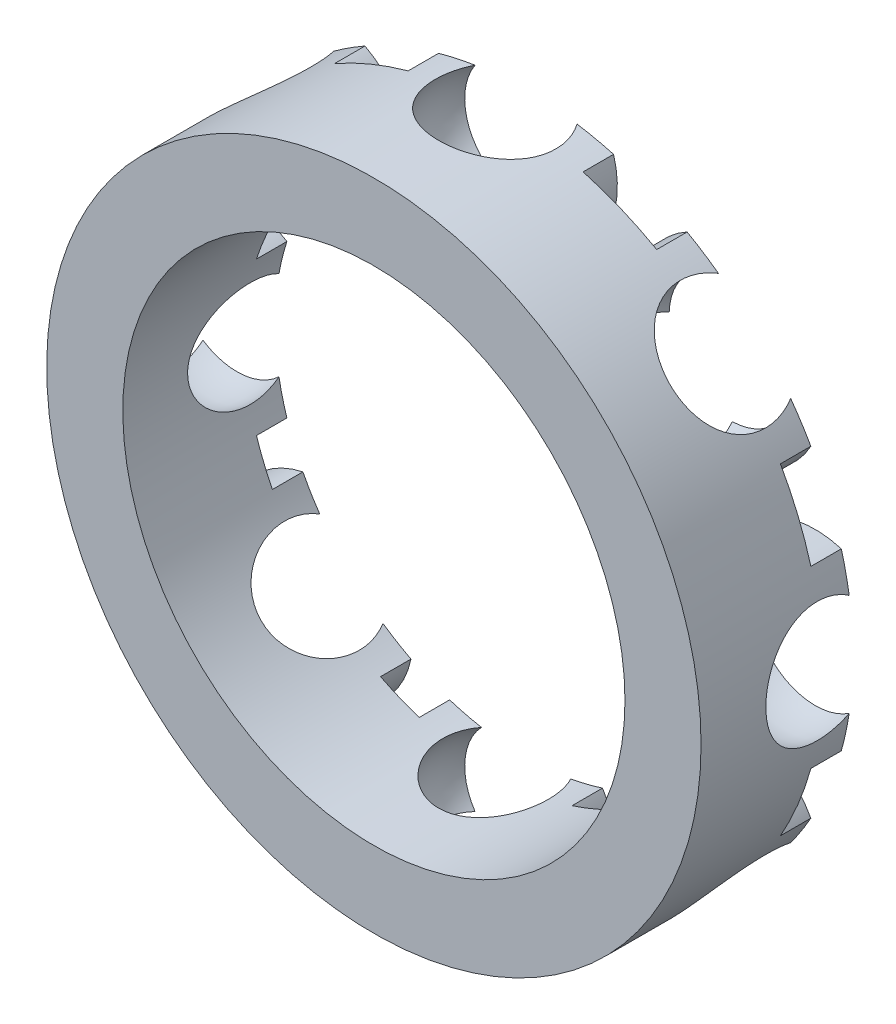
ISO-10303-21;
HEADER;
FILE_DESCRIPTION(('STEP AP214'),'2;1');
FILE_NAME('part.step','',(''),(''),'','','');
FILE_SCHEMA(('AUTOMOTIVE_DESIGN { 1 0 10303 214 1 1 1 1 }'));
ENDSEC;
DATA;
#1=APPLICATION_CONTEXT('core data for automotive mechanical design processes');
#2=APPLICATION_PROTOCOL_DEFINITION('international standard','automotive_design',2000,#1);
#3=PRODUCT_CONTEXT('',#1,'mechanical');
#4=PRODUCT('Part','Part','',(#3));
#5=PRODUCT_RELATED_PRODUCT_CATEGORY('part','',(#4));
#6=PRODUCT_DEFINITION_FORMATION('','',#4);
#7=PRODUCT_DEFINITION_CONTEXT('part definition',#1,'design');
#8=PRODUCT_DEFINITION('design','',#6,#7);
#9=PRODUCT_DEFINITION_SHAPE('','',#8);
#10=(LENGTH_UNIT() NAMED_UNIT(*) SI_UNIT(.MILLI.,.METRE.));
#11=(NAMED_UNIT(*) PLANE_ANGLE_UNIT() SI_UNIT($,.RADIAN.));
#12=(NAMED_UNIT(*) SI_UNIT($,.STERADIAN.) SOLID_ANGLE_UNIT());
#13=UNCERTAINTY_MEASURE_WITH_UNIT(LENGTH_MEASURE(1.E-05),#10,'distance_accuracy_value','');
#14=(GEOMETRIC_REPRESENTATION_CONTEXT(3) GLOBAL_UNCERTAINTY_ASSIGNED_CONTEXT((#13)) GLOBAL_UNIT_ASSIGNED_CONTEXT((#10,
#11,#12)) REPRESENTATION_CONTEXT('',''));
#15=CARTESIAN_POINT('',(0.,0.,0.));
#16=DIRECTION('',(0.,0.,1.));
#17=DIRECTION('',(1.,0.,0.));
#18=AXIS2_PLACEMENT_3D('',#15,#16,#17);
#19=CARTESIAN_POINT('',(0.,0.,0.));
#20=DIRECTION('',(0.,0.,1.));
#21=DIRECTION('',(1.,0.,0.));
#22=AXIS2_PLACEMENT_3D('',#19,#20,#21);
#23=PLANE('',#22);
#24=CARTESIAN_POINT('',(0.,0.,0.));
#25=DIRECTION('',(0.,0.,1.));
#26=DIRECTION('',(1.,0.,0.));
#27=AXIS2_PLACEMENT_3D('',#24,#25,#26);
#28=CIRCLE('',#27,8.25);
#29=CARTESIAN_POINT('',(-8.11842105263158,-1.46756247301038,0.));
#30=VERTEX_POINT('',#29);
#31=CARTESIAN_POINT('',(-7.85855263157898,-2.51110544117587,0.));
#32=VERTEX_POINT('',#31);
#33=EDGE_CURVE('E356',#30,#32,#28,.T.);
#34=ORIENTED_EDGE('',*,*,#33,.T.);
#35=CARTESIAN_POINT('',(-9.5,1.28369537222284E-13,0.));
#36=DIRECTION('',(0.,0.,1.));
#37=DIRECTION('',(0.707106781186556,0.707106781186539,0.));
#38=AXIS2_PLACEMENT_3D('',#35,#36,#37);
#39=CIRCLE('',#38,3.);
#40=CARTESIAN_POINT('',(-10.358552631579,-2.87452385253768,0.));
#41=VERTEX_POINT('',#40);
#42=EDGE_CURVE('E342',#41,#32,#39,.T.);
#43=ORIENTED_EDGE('',*,*,#42,.F.);
#44=CARTESIAN_POINT('',(0.,0.,0.));
#45=DIRECTION('',(0.,0.,1.));
#46=DIRECTION('',(1.,0.,0.));
#47=AXIS2_PLACEMENT_3D('',#44,#45,#46);
#48=CIRCLE('',#47,10.75);
#49=CARTESIAN_POINT('',(-10.6184210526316,-1.67679287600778,0.));
#50=VERTEX_POINT('',#49);
#51=EDGE_CURVE('E354',#50,#41,#48,.T.);
#52=ORIENTED_EDGE('',*,*,#51,.F.);
#53=CARTESIAN_POINT('',(-9.5,0.,0.));
#54=DIRECTION('',(0.,0.,1.));
#55=DIRECTION('',(1.,0.,0.));
#56=AXIS2_PLACEMENT_3D('',#53,#54,#55);
#57=CIRCLE('',#56,2.01556443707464);
#58=EDGE_CURVE('E394',#50,#30,#57,.T.);
#59=ORIENTED_EDGE('',*,*,#58,.T.);
#60=EDGE_LOOP('',(#34,#43,#52,#59));
#61=FACE_BOUND('',#60,.T.);
#62=ADVANCED_FACE('F35',(#61),#23,.F.);
#63=CARTESIAN_POINT('',(-4.70286720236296,-6.7783139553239,0.));
#64=VERTEX_POINT('',#63);
#65=CARTESIAN_POINT('',(-3.78121617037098,-7.33245554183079,0.));
#66=VERTEX_POINT('',#65);
#67=EDGE_CURVE('E662',#64,#66,#28,.T.);
#68=ORIENTED_EDGE('',*,*,#67,.T.);
#69=CARTESIAN_POINT('',(-6.71751442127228,-6.71751442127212,0.));
#70=DIRECTION('',(0.,0.,1.));
#71=DIRECTION('',(0.,1.,0.));
#72=AXIS2_PLACEMENT_3D('',#69,#70,#71);
#73=CIRCLE('',#72,3.);
#74=CARTESIAN_POINT('',(-5.29200750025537,-9.35719811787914,0.));
#75=VERTEX_POINT('',#74);
#76=EDGE_CURVE('E347',#75,#66,#73,.T.);
#77=ORIENTED_EDGE('',*,*,#76,.F.);
#78=CARTESIAN_POINT('',(-6.3226859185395,-8.69402914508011,0.));
#79=VERTEX_POINT('',#78);
#80=EDGE_CURVE('E370',#79,#75,#48,.T.);
#81=ORIENTED_EDGE('',*,*,#80,.F.);
#82=CARTESIAN_POINT('',(-6.71751442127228,-6.71751442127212,0.));
#83=DIRECTION('',(0.,0.,1.));
#84=DIRECTION('',(1.,0.,0.));
#85=AXIS2_PLACEMENT_3D('',#82,#83,#84);
#86=CIRCLE('',#85,2.01556443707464);
#87=EDGE_CURVE('E567',#79,#64,#86,.T.);
#88=ORIENTED_EDGE('',*,*,#87,.T.);
#89=EDGE_LOOP('',(#68,#77,#81,#88));
#90=FACE_BOUND('',#89,.T.);
#91=ADVANCED_FACE('F812',(#90),#23,.F.);
#92=CARTESIAN_POINT('',(1.46756247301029,-8.1184210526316,0.));
#93=VERTEX_POINT('',#92);
#94=CARTESIAN_POINT('',(2.5111054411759,-7.85855263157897,0.));
#95=VERTEX_POINT('',#94);
#96=EDGE_CURVE('E678',#93,#95,#28,.T.);
#97=ORIENTED_EDGE('',*,*,#96,.T.);
#98=CARTESIAN_POINT('',(0.,-9.5,0.));
#99=DIRECTION('',(0.,0.,1.));
#100=DIRECTION('',(-0.707106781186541,0.707106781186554,0.));
#101=AXIS2_PLACEMENT_3D('',#98,#99,#100);
#102=CIRCLE('',#101,3.);
#103=CARTESIAN_POINT('',(2.87452385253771,-10.358552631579,0.));
#104=VERTEX_POINT('',#103);
#105=EDGE_CURVE('E724',#104,#95,#102,.T.);
#106=ORIENTED_EDGE('',*,*,#105,.F.);
#107=CARTESIAN_POINT('',(1.67679287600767,-10.6184210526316,0.));
#108=VERTEX_POINT('',#107);
#109=EDGE_CURVE('E832',#108,#104,#48,.T.);
#110=ORIENTED_EDGE('',*,*,#109,.F.);
#111=CARTESIAN_POINT('',(0.,-9.5,0.));
#112=DIRECTION('',(0.,0.,1.));
#113=DIRECTION('',(1.,0.,0.));
#114=AXIS2_PLACEMENT_3D('',#111,#112,#113);
#115=CIRCLE('',#114,2.01556443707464);
#116=EDGE_CURVE('E565',#108,#93,#115,.T.);
#117=ORIENTED_EDGE('',*,*,#116,.T.);
#118=EDGE_LOOP('',(#97,#106,#110,#117));
#119=FACE_BOUND('',#118,.T.);
#120=ADVANCED_FACE('F884',(#119),#23,.F.);
#121=CARTESIAN_POINT('',(6.77831395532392,-4.70286720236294,0.));
#122=VERTEX_POINT('',#121);
#123=CARTESIAN_POINT('',(7.3324555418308,-3.78121617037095,0.));
#124=VERTEX_POINT('',#123);
#125=EDGE_CURVE('E671',#122,#124,#28,.T.);
#126=ORIENTED_EDGE('',*,*,#125,.T.);
#127=CARTESIAN_POINT('',(6.71751442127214,-6.71751442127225,0.));
#128=DIRECTION('',(0.,0.,1.));
#129=DIRECTION('',(-1.,0.,0.));
#130=AXIS2_PLACEMENT_3D('',#127,#128,#129);
#131=CIRCLE('',#130,3.);
#132=CARTESIAN_POINT('',(9.35719811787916,-5.29200750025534,0.));
#133=VERTEX_POINT('',#132);
#134=EDGE_CURVE('E742',#133,#124,#131,.T.);
#135=ORIENTED_EDGE('',*,*,#134,.F.);
#136=CARTESIAN_POINT('',(8.69402914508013,-6.32268591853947,0.));
#137=VERTEX_POINT('',#136);
#138=EDGE_CURVE('E835',#137,#133,#48,.T.);
#139=ORIENTED_EDGE('',*,*,#138,.F.);
#140=CARTESIAN_POINT('',(6.71751442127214,-6.71751442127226,0.));
#141=DIRECTION('',(0.,0.,1.));
#142=DIRECTION('',(1.,0.,0.));
#143=AXIS2_PLACEMENT_3D('',#140,#141,#142);
#144=CIRCLE('',#143,2.01556443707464);
#145=EDGE_CURVE('E582',#137,#122,#144,.T.);
#146=ORIENTED_EDGE('',*,*,#145,.T.);
#147=EDGE_LOOP('',(#126,#135,#139,#146));
#148=FACE_BOUND('',#147,.T.);
#149=ADVANCED_FACE('F914',(#148),#23,.F.);
#150=CARTESIAN_POINT('',(8.11842105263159,1.46756247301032,0.));
#151=VERTEX_POINT('',#150);
#152=CARTESIAN_POINT('',(7.85855263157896,2.51110544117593,0.));
#153=VERTEX_POINT('',#152);
#154=EDGE_CURVE('E664',#151,#153,#28,.T.);
#155=ORIENTED_EDGE('',*,*,#154,.T.);
#156=CARTESIAN_POINT('',(9.5,0.,0.));
#157=DIRECTION('',(0.,0.,1.));
#158=DIRECTION('',(-0.707106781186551,-0.707106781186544,0.));
#159=AXIS2_PLACEMENT_3D('',#156,#157,#158);
#160=CIRCLE('',#159,3.);
#161=CARTESIAN_POINT('',(10.358552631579,2.87452385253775,0.));
#162=VERTEX_POINT('',#161);
#163=EDGE_CURVE('E760',#162,#153,#160,.T.);
#164=ORIENTED_EDGE('',*,*,#163,.F.);
#165=CARTESIAN_POINT('',(10.6184210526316,1.67679287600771,0.));
#166=VERTEX_POINT('',#165);
#167=EDGE_CURVE('E840',#166,#162,#48,.T.);
#168=ORIENTED_EDGE('',*,*,#167,.F.);
#169=CARTESIAN_POINT('',(9.5,0.,0.));
#170=DIRECTION('',(0.,0.,1.));
#171=DIRECTION('',(1.,0.,0.));
#172=AXIS2_PLACEMENT_3D('',#169,#170,#171);
#173=CIRCLE('',#172,2.01556443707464);
#174=EDGE_CURVE('E929',#166,#151,#173,.T.);
#175=ORIENTED_EDGE('',*,*,#174,.T.);
#176=EDGE_LOOP('',(#155,#164,#168,#175));
#177=FACE_BOUND('',#176,.T.);
#178=ADVANCED_FACE('F1194',(#177),#23,.F.);
#179=CARTESIAN_POINT('',(4.70286720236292,6.77831395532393,0.));
#180=VERTEX_POINT('',#179);
#181=CARTESIAN_POINT('',(3.78121617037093,7.33245554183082,0.));
#182=VERTEX_POINT('',#181);
#183=EDGE_CURVE('E660',#180,#182,#28,.T.);
#184=ORIENTED_EDGE('',*,*,#183,.T.);
#185=CARTESIAN_POINT('',(6.71751442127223,6.71751442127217,0.));
#186=DIRECTION('',(0.,0.,1.));
#187=DIRECTION('',(0.,-1.,0.));
#188=AXIS2_PLACEMENT_3D('',#185,#186,#187);
#189=CIRCLE('',#188,3.);
#190=CARTESIAN_POINT('',(5.29200750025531,9.35719811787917,0.));
#191=VERTEX_POINT('',#190);
#192=EDGE_CURVE('E778',#191,#182,#189,.T.);
#193=ORIENTED_EDGE('',*,*,#192,.F.);
#194=CARTESIAN_POINT('',(6.32268591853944,8.69402914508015,0.));
#195=VERTEX_POINT('',#194);
#196=EDGE_CURVE('E846',#195,#191,#48,.T.);
#197=ORIENTED_EDGE('',*,*,#196,.F.);
#198=CARTESIAN_POINT('',(6.71751442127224,6.71751442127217,0.));
#199=DIRECTION('',(0.,0.,1.));
#200=DIRECTION('',(1.,0.,0.));
#201=AXIS2_PLACEMENT_3D('',#198,#199,#200);
#202=CIRCLE('',#201,2.01556443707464);
#203=EDGE_CURVE('E631',#195,#180,#202,.T.);
#204=ORIENTED_EDGE('',*,*,#203,.T.);
#205=EDGE_LOOP('',(#184,#193,#197,#204));
#206=FACE_BOUND('',#205,.T.);
#207=ADVANCED_FACE('F939',(#206),#23,.F.);
#208=CARTESIAN_POINT('',(-1.46756247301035,8.11842105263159,0.));
#209=VERTEX_POINT('',#208);
#210=CARTESIAN_POINT('',(-2.51110544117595,7.85855263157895,0.));
#211=VERTEX_POINT('',#210);
#212=EDGE_CURVE('E651',#209,#211,#28,.T.);
#213=ORIENTED_EDGE('',*,*,#212,.T.);
#214=CARTESIAN_POINT('',(0.,9.5,0.));
#215=DIRECTION('',(0.,0.,1.));
#216=DIRECTION('',(0.707106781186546,-0.707106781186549,0.));
#217=AXIS2_PLACEMENT_3D('',#214,#215,#216);
#218=CIRCLE('',#217,3.);
#219=CARTESIAN_POINT('',(-2.87452385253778,10.358552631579,0.));
#220=VERTEX_POINT('',#219);
#221=EDGE_CURVE('E796',#220,#211,#218,.T.);
#222=ORIENTED_EDGE('',*,*,#221,.F.);
#223=CARTESIAN_POINT('',(-1.67679287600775,10.6184210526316,0.));
#224=VERTEX_POINT('',#223);
#225=EDGE_CURVE('E378',#224,#220,#48,.T.);
#226=ORIENTED_EDGE('',*,*,#225,.F.);
#227=CARTESIAN_POINT('',(0.,9.5,0.));
#228=DIRECTION('',(0.,0.,1.));
#229=DIRECTION('',(1.,0.,0.));
#230=AXIS2_PLACEMENT_3D('',#227,#228,#229);
#231=CIRCLE('',#230,2.01556443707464);
#232=EDGE_CURVE('E634',#224,#209,#231,.T.);
#233=ORIENTED_EDGE('',*,*,#232,.T.);
#234=EDGE_LOOP('',(#213,#222,#226,#233));
#235=FACE_BOUND('',#234,.T.);
#236=ADVANCED_FACE('F649',(#235),#23,.F.);
#237=CARTESIAN_POINT('',(-9.35719811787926,-5.29200750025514,0.));
#238=VERTEX_POINT('',#237);
#239=CARTESIAN_POINT('',(-8.69402914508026,-6.32268591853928,0.));
#240=VERTEX_POINT('',#239);
#241=EDGE_CURVE('E364',#238,#240,#48,.T.);
#242=ORIENTED_EDGE('',*,*,#241,.F.);
#243=CARTESIAN_POINT('',(-6.71751442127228,-6.71751442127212,0.));
#244=DIRECTION('',(0.,0.,1.));
#245=DIRECTION('',(-0.707106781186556,-0.707106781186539,0.));
#246=AXIS2_PLACEMENT_3D('',#243,#244,#245);
#247=CIRCLE('',#246,3.);
#248=CARTESIAN_POINT('',(-7.33245554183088,-3.7812161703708,0.));
#249=VERTEX_POINT('',#248);
#250=EDGE_CURVE('E357',#249,#238,#247,.T.);
#251=ORIENTED_EDGE('',*,*,#250,.F.);
#252=CARTESIAN_POINT('',(-6.77831395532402,-4.70286720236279,0.));
#253=VERTEX_POINT('',#252);
#254=EDGE_CURVE('E383',#249,#253,#28,.T.);
#255=ORIENTED_EDGE('',*,*,#254,.T.);
#256=EDGE_CURVE('E566',#253,#240,#86,.T.);
#257=ORIENTED_EDGE('',*,*,#256,.T.);
#258=EDGE_LOOP('',(#242,#251,#255,#257));
#259=FACE_BOUND('',#258,.T.);
#260=ADVANCED_FACE('F698',(#259),#23,.F.);
#261=CARTESIAN_POINT('',(-2.87452385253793,-10.3585526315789,0.));
#262=VERTEX_POINT('',#261);
#263=CARTESIAN_POINT('',(-1.67679287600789,-10.6184210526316,0.));
#264=VERTEX_POINT('',#263);
#265=EDGE_CURVE('E371',#262,#264,#48,.T.);
#266=ORIENTED_EDGE('',*,*,#265,.F.);
#267=CARTESIAN_POINT('',(0.,-9.5,0.));
#268=DIRECTION('',(0.,0.,1.));
#269=DIRECTION('',(0.,-1.,0.));
#270=AXIS2_PLACEMENT_3D('',#267,#268,#269);
#271=CIRCLE('',#270,3.);
#272=CARTESIAN_POINT('',(-2.51110544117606,-7.85855263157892,0.));
#273=VERTEX_POINT('',#272);
#274=EDGE_CURVE('E710',#273,#262,#271,.T.);
#275=ORIENTED_EDGE('',*,*,#274,.F.);
#276=CARTESIAN_POINT('',(-1.46756247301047,-8.11842105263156,0.));
#277=VERTEX_POINT('',#276);
#278=EDGE_CURVE('E683',#273,#277,#28,.T.);
#279=ORIENTED_EDGE('',*,*,#278,.T.);
#280=EDGE_CURVE('E571',#277,#264,#115,.T.);
#281=ORIENTED_EDGE('',*,*,#280,.T.);
#282=EDGE_LOOP('',(#266,#275,#279,#281));
#283=FACE_BOUND('',#282,.T.);
#284=ADVANCED_FACE('F829',(#283),#23,.F.);
#285=CARTESIAN_POINT('',(10.3585526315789,-2.87452385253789,0.));
#286=VERTEX_POINT('',#285);
#287=CARTESIAN_POINT('',(10.6184210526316,-1.67679287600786,0.));
#288=VERTEX_POINT('',#287);
#289=EDGE_CURVE('E836',#286,#288,#48,.T.);
#290=ORIENTED_EDGE('',*,*,#289,.F.);
#291=CARTESIAN_POINT('',(9.5,0.,0.));
#292=DIRECTION('',(0.,0.,1.));
#293=DIRECTION('',(1.,0.,0.));
#294=AXIS2_PLACEMENT_3D('',#291,#292,#293);
#295=CIRCLE('',#294,3.);
#296=CARTESIAN_POINT('',(7.85855263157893,-2.51110544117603,0.));
#297=VERTEX_POINT('',#296);
#298=EDGE_CURVE('E746',#297,#286,#295,.T.);
#299=ORIENTED_EDGE('',*,*,#298,.F.);
#300=CARTESIAN_POINT('',(8.11842105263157,-1.46756247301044,0.));
#301=VERTEX_POINT('',#300);
#302=EDGE_CURVE('E669',#297,#301,#28,.T.);
#303=ORIENTED_EDGE('',*,*,#302,.T.);
#304=EDGE_CURVE('E590',#301,#288,#173,.T.);
#305=ORIENTED_EDGE('',*,*,#304,.T.);
#306=EDGE_LOOP('',(#290,#299,#303,#305));
#307=FACE_BOUND('',#306,.T.);
#308=ADVANCED_FACE('F926',(#307),#23,.F.);
#309=CARTESIAN_POINT('',(9.35719811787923,5.29200750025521,0.));
#310=VERTEX_POINT('',#309);
#311=CARTESIAN_POINT('',(8.69402914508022,6.32268591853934,0.));
#312=VERTEX_POINT('',#311);
#313=EDGE_CURVE('E841',#310,#312,#48,.T.);
#314=ORIENTED_EDGE('',*,*,#313,.F.);
#315=CARTESIAN_POINT('',(6.71751442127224,6.71751442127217,0.));
#316=DIRECTION('',(0.,0.,1.));
#317=DIRECTION('',(0.707106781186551,0.707106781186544,0.));
#318=AXIS2_PLACEMENT_3D('',#315,#316,#317);
#319=CIRCLE('',#318,3.);
#320=CARTESIAN_POINT('',(7.33245554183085,3.78121617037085,0.));
#321=VERTEX_POINT('',#320);
#322=EDGE_CURVE('E764',#321,#310,#319,.T.);
#323=ORIENTED_EDGE('',*,*,#322,.F.);
#324=CARTESIAN_POINT('',(6.77831395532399,4.70286720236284,0.));
#325=VERTEX_POINT('',#324);
#326=EDGE_CURVE('E661',#321,#325,#28,.T.);
#327=ORIENTED_EDGE('',*,*,#326,.T.);
#328=EDGE_CURVE('E632',#325,#312,#202,.T.);
#329=ORIENTED_EDGE('',*,*,#328,.T.);
#330=EDGE_LOOP('',(#314,#323,#327,#329));
#331=FACE_BOUND('',#330,.T.);
#332=ADVANCED_FACE('F1248',(#331),#23,.F.);
#333=CARTESIAN_POINT('',(2.87452385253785,10.3585526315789,0.));
#334=VERTEX_POINT('',#333);
#335=CARTESIAN_POINT('',(1.67679287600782,10.6184210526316,0.));
#336=VERTEX_POINT('',#335);
#337=EDGE_CURVE('E847',#334,#336,#48,.T.);
#338=ORIENTED_EDGE('',*,*,#337,.F.);
#339=CARTESIAN_POINT('',(0.,9.5,0.));
#340=DIRECTION('',(0.,0.,1.));
#341=DIRECTION('',(0.,1.,0.));
#342=AXIS2_PLACEMENT_3D('',#339,#340,#341);
#343=CIRCLE('',#342,3.);
#344=CARTESIAN_POINT('',(2.511105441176,7.85855263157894,0.));
#345=VERTEX_POINT('',#344);
#346=EDGE_CURVE('E782',#345,#334,#343,.T.);
#347=ORIENTED_EDGE('',*,*,#346,.F.);
#348=CARTESIAN_POINT('',(1.46756247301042,8.11842105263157,0.));
#349=VERTEX_POINT('',#348);
#350=EDGE_CURVE('E657',#345,#349,#28,.T.);
#351=ORIENTED_EDGE('',*,*,#350,.T.);
#352=EDGE_CURVE('E630',#349,#336,#231,.T.);
#353=ORIENTED_EDGE('',*,*,#352,.T.);
#354=EDGE_LOOP('',(#338,#347,#351,#353));
#355=FACE_BOUND('',#354,.T.);
#356=ADVANCED_FACE('F901',(#355),#23,.F.);
#357=CARTESIAN_POINT('',(-5.29200750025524,9.35719811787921,0.));
#358=VERTEX_POINT('',#357);
#359=CARTESIAN_POINT('',(-6.32268591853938,8.6940291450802,0.));
#360=VERTEX_POINT('',#359);
#361=EDGE_CURVE('E377',#358,#360,#48,.T.);
#362=ORIENTED_EDGE('',*,*,#361,.F.);
#363=CARTESIAN_POINT('',(-6.71751442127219,6.71751442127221,0.));
#364=DIRECTION('',(0.,0.,1.));
#365=DIRECTION('',(-0.707106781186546,0.707106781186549,0.));
#366=AXIS2_PLACEMENT_3D('',#363,#364,#365);
#367=CIRCLE('',#366,3.);
#368=CARTESIAN_POINT('',(-3.78121617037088,7.33245554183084,0.));
#369=VERTEX_POINT('',#368);
#370=EDGE_CURVE('E800',#369,#358,#367,.T.);
#371=ORIENTED_EDGE('',*,*,#370,.F.);
#372=CARTESIAN_POINT('',(-4.70286720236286,6.77831395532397,0.));
#373=VERTEX_POINT('',#372);
#374=EDGE_CURVE('E658',#369,#373,#28,.T.);
#375=ORIENTED_EDGE('',*,*,#374,.T.);
#376=CARTESIAN_POINT('',(-6.71751442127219,6.71751442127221,0.));
#377=DIRECTION('',(0.,0.,1.));
#378=DIRECTION('',(1.,0.,0.));
#379=AXIS2_PLACEMENT_3D('',#376,#377,#378);
#380=CIRCLE('',#379,2.01556443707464);
#381=EDGE_CURVE('E454',#373,#360,#380,.T.);
#382=ORIENTED_EDGE('',*,*,#381,.T.);
#383=EDGE_LOOP('',(#362,#371,#375,#382));
#384=FACE_BOUND('',#383,.T.);
#385=ADVANCED_FACE('F860',(#384),#23,.F.);
#386=CARTESIAN_POINT('',(5.29200750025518,-9.35719811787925,0.));
#387=VERTEX_POINT('',#386);
#388=CARTESIAN_POINT('',(6.32268591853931,-8.69402914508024,0.));
#389=VERTEX_POINT('',#388);
#390=EDGE_CURVE('E833',#387,#389,#48,.T.);
#391=ORIENTED_EDGE('',*,*,#390,.F.);
#392=CARTESIAN_POINT('',(6.71751442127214,-6.71751442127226,0.));
#393=DIRECTION('',(0.,0.,1.));
#394=DIRECTION('',(0.707106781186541,-0.707106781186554,0.));
#395=AXIS2_PLACEMENT_3D('',#392,#393,#394);
#396=CIRCLE('',#395,3.);
#397=CARTESIAN_POINT('',(3.78121617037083,-7.33245554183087,0.));
#398=VERTEX_POINT('',#397);
#399=EDGE_CURVE('E728',#398,#387,#396,.T.);
#400=ORIENTED_EDGE('',*,*,#399,.F.);
#401=CARTESIAN_POINT('',(4.70286720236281,-6.778313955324,0.));
#402=VERTEX_POINT('',#401);
#403=EDGE_CURVE('E676',#398,#402,#28,.T.);
#404=ORIENTED_EDGE('',*,*,#403,.T.);
#405=EDGE_CURVE('E579',#402,#389,#144,.T.);
#406=ORIENTED_EDGE('',*,*,#405,.T.);
#407=EDGE_LOOP('',(#391,#400,#404,#406));
#408=FACE_BOUND('',#407,.T.);
#409=ADVANCED_FACE('F893',(#408),#23,.F.);
#410=CARTESIAN_POINT('',(-8.69402914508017,6.32268591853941,0.));
#411=VERTEX_POINT('',#410);
#412=CARTESIAN_POINT('',(-9.35719811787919,5.29200750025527,0.));
#413=VERTEX_POINT('',#412);
#414=EDGE_CURVE('E373',#411,#413,#48,.T.);
#415=ORIENTED_EDGE('',*,*,#414,.F.);
#416=CARTESIAN_POINT('',(-6.77831395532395,4.7028672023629,0.));
#417=VERTEX_POINT('',#416);
#418=EDGE_CURVE('E455',#411,#417,#380,.T.);
#419=ORIENTED_EDGE('',*,*,#418,.T.);
#420=CARTESIAN_POINT('',(-7.33245554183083,3.7812161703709,0.));
#421=VERTEX_POINT('',#420);
#422=EDGE_CURVE('E659',#417,#421,#28,.T.);
#423=ORIENTED_EDGE('',*,*,#422,.T.);
#424=CARTESIAN_POINT('',(-6.71751442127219,6.71751442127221,0.));
#425=DIRECTION('',(0.,0.,1.));
#426=DIRECTION('',(1.,0.,0.));
#427=AXIS2_PLACEMENT_3D('',#424,#425,#426);
#428=CIRCLE('',#427,3.);
#429=EDGE_CURVE('E453',#413,#421,#428,.T.);
#430=ORIENTED_EDGE('',*,*,#429,.F.);
#431=EDGE_LOOP('',(#415,#419,#423,#430));
#432=FACE_BOUND('',#431,.T.);
#433=ADVANCED_FACE('F866',(#432),#23,.F.);
#434=CARTESIAN_POINT('',(0.,0.,5.));
#435=DIRECTION('',(0.,0.,1.));
#436=DIRECTION('',(1.,0.,0.));
#437=AXIS2_PLACEMENT_3D('',#434,#435,#436);
#438=PLANE('',#437);
#439=CARTESIAN_POINT('',(0.,0.,5.));
#440=DIRECTION('',(0.,0.,1.));
#441=DIRECTION('',(1.,0.,0.));
#442=AXIS2_PLACEMENT_3D('',#439,#440,#441);
#443=CIRCLE('',#442,10.75);
#444=CARTESIAN_POINT('',(10.75,0.,5.));
#445=VERTEX_POINT('',#444);
#446=EDGE_CURVE('E363',#445,#445,#443,.T.);
#447=ORIENTED_EDGE('',*,*,#446,.T.);
#448=EDGE_LOOP('',(#447));
#449=FACE_BOUND('',#448,.T.);
#450=CARTESIAN_POINT('',(0.,0.,5.));
#451=DIRECTION('',(0.,0.,1.));
#452=DIRECTION('',(1.,0.,0.));
#453=AXIS2_PLACEMENT_3D('',#450,#451,#452);
#454=CIRCLE('',#453,8.25);
#455=CARTESIAN_POINT('',(8.25,0.,5.));
#456=VERTEX_POINT('',#455);
#457=EDGE_CURVE('E374',#456,#456,#454,.T.);
#458=ORIENTED_EDGE('',*,*,#457,.F.);
#459=EDGE_LOOP('',(#458));
#460=FACE_BOUND('',#459,.T.);
#461=ADVANCED_FACE('F886',(#449,#460),#438,.T.);
#462=CARTESIAN_POINT('',(-10.3585526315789,2.87452385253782,0.));
#463=VERTEX_POINT('',#462);
#464=CARTESIAN_POINT('',(-10.6184210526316,1.67679287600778,0.));
#465=VERTEX_POINT('',#464);
#466=EDGE_CURVE('E366',#463,#465,#48,.T.);
#467=ORIENTED_EDGE('',*,*,#466,.F.);
#468=CARTESIAN_POINT('',(-9.5,0.,0.));
#469=DIRECTION('',(0.,0.,1.));
#470=DIRECTION('',(-1.,0.,0.));
#471=AXIS2_PLACEMENT_3D('',#468,#469,#470);
#472=CIRCLE('',#471,3.);
#473=CARTESIAN_POINT('',(-7.85855263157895,2.51110544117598,0.));
#474=VERTEX_POINT('',#473);
#475=EDGE_CURVE('E460',#474,#463,#472,.T.);
#476=ORIENTED_EDGE('',*,*,#475,.F.);
#477=CARTESIAN_POINT('',(-8.11842105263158,1.46756247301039,0.));
#478=VERTEX_POINT('',#477);
#479=EDGE_CURVE('E385',#474,#478,#28,.T.);
#480=ORIENTED_EDGE('',*,*,#479,.T.);
#481=EDGE_CURVE('E393',#478,#465,#57,.T.);
#482=ORIENTED_EDGE('',*,*,#481,.T.);
#483=EDGE_LOOP('',(#467,#476,#480,#482));
#484=FACE_BOUND('',#483,.T.);
#485=ADVANCED_FACE('F476',(#484),#23,.F.);
#486=CARTESIAN_POINT('',(0.,0.,5.));
#487=DIRECTION('',(0.,0.,-1.));
#488=DIRECTION('',(-1.,0.,0.));
#489=AXIS2_PLACEMENT_3D('',#486,#487,#488);
#490=CYLINDRICAL_SURFACE('',#489,10.75);
#491=ORIENTED_EDGE('',*,*,#51,.T.);
#492=DIRECTION('',(0.,0.,-1.));
#493=VECTOR('',#492,1.);
#494=CARTESIAN_POINT('',(-10.358552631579,-2.87452385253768,0.5));
#495=LINE('',#494,#493);
#496=CARTESIAN_POINT('',(-10.358552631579,-2.87452385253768,1.));
#497=VERTEX_POINT('',#496);
#498=EDGE_CURVE('E339',#41,#497,#495,.F.);
#499=ORIENTED_EDGE('',*,*,#498,.T.);
#500=CARTESIAN_POINT('',(0.,0.,1.));
#501=DIRECTION('',(0.,0.,1.));
#502=DIRECTION('',(1.,0.,0.));
#503=AXIS2_PLACEMENT_3D('',#500,#501,#502);
#504=CIRCLE('',#503,10.75);
#505=CARTESIAN_POINT('',(-9.35719811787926,-5.29200750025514,1.));
#506=VERTEX_POINT('',#505);
#507=EDGE_CURVE('E814',#497,#506,#504,.T.);
#508=ORIENTED_EDGE('',*,*,#507,.T.);
#509=DIRECTION('',(0.,0.,-1.));
#510=VECTOR('',#509,1.);
#511=CARTESIAN_POINT('',(-9.35719811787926,-5.29200750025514,0.5));
#512=LINE('',#511,#510);
#513=EDGE_CURVE('E348',#506,#238,#512,.T.);
#514=ORIENTED_EDGE('',*,*,#513,.T.);
#515=ORIENTED_EDGE('',*,*,#241,.T.);
#516=CARTESIAN_POINT('',(-8.69394975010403,-6.32279508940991,-0.000200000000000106));
#517=CARTESIAN_POINT('',(-8.71046582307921,-6.30008433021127,0.0413998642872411));
#518=CARTESIAN_POINT('',(-8.72589728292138,-6.27867982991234,0.0841198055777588));
#519=CARTESIAN_POINT('',(-8.75453817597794,-6.23868315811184,0.171582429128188));
#520=CARTESIAN_POINT('',(-8.76774722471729,-6.22009147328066,0.21632545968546));
#521=CARTESIAN_POINT('',(-8.80393820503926,-6.16886827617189,0.353182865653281));
#522=CARTESIAN_POINT('',(-8.82350505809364,-6.14075930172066,0.447978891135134));
#523=CARTESIAN_POINT('',(-8.85310702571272,-6.09800637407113,0.642116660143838));
#524=CARTESIAN_POINT('',(-8.86312741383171,-6.08338322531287,0.741465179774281));
#525=CARTESIAN_POINT('',(-8.87339740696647,-6.06839389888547,0.941679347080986));
#526=CARTESIAN_POINT('',(-8.87365391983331,-6.06801764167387,1.04254387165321));
#527=CARTESIAN_POINT('',(-8.86448329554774,-6.0814057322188,1.24114556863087));
#528=CARTESIAN_POINT('',(-8.85522046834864,-6.09493014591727,1.33890676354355));
#529=CARTESIAN_POINT('',(-8.82743836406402,-6.13509751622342,1.53035247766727));
#530=CARTESIAN_POINT('',(-8.80891612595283,-6.16174466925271,1.62403568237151));
#531=CARTESIAN_POINT('',(-8.76276179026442,-6.2272074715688,1.80560017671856));
#532=CARTESIAN_POINT('',(-8.73505340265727,-6.26612488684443,1.89342521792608));
#533=CARTESIAN_POINT('',(-8.67107418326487,-6.35436331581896,2.06026317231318));
#534=CARTESIAN_POINT('',(-8.63480276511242,-6.40368504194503,2.13927548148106));
#535=CARTESIAN_POINT('',(-8.55252835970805,-6.51318983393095,2.29007904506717));
#536=CARTESIAN_POINT('',(-8.50616444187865,-6.57375826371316,2.36139315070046));
#537=CARTESIAN_POINT('',(-8.40562234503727,-6.70183843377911,2.49110322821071));
#538=CARTESIAN_POINT('',(-8.35144193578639,-6.76935215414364,2.54949550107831));
#539=CARTESIAN_POINT('',(-8.23304840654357,-6.91292483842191,2.65515636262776));
#540=CARTESIAN_POINT('',(-8.16844499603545,-6.98925019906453,2.70162612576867));
#541=CARTESIAN_POINT('',(-8.03298042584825,-7.14453253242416,2.77814297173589));
#542=CARTESIAN_POINT('',(-7.96211788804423,-7.22349008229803,2.80818642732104));
#543=CARTESIAN_POINT('',(-7.81255869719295,-7.38505531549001,2.85226831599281));
#544=CARTESIAN_POINT('',(-7.73365676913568,-7.46767496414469,2.86556896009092));
#545=CARTESIAN_POINT('',(-7.57276261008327,-7.63078607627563,2.87353397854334));
#546=CARTESIAN_POINT('',(-7.49076994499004,-7.71127723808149,2.86819572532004));
#547=CARTESIAN_POINT('',(-7.32453417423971,-7.86937639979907,2.83870843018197));
#548=CARTESIAN_POINT('',(-7.24027692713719,-7.94690811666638,2.81422799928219));
#549=CARTESIAN_POINT('',(-7.07366189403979,-8.09557159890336,2.7464906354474));
#550=CARTESIAN_POINT('',(-6.99130414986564,-8.16670322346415,2.70323328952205));
#551=CARTESIAN_POINT('',(-6.83229000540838,-8.30018007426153,2.5993228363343));
#552=CARTESIAN_POINT('',(-6.75558406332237,-8.36260744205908,2.53885146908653));
#553=CARTESIAN_POINT('',(-6.61005823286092,-8.47810531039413,2.40164213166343));
#554=CARTESIAN_POINT('',(-6.54123665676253,-8.53117781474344,2.32490765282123));
#555=CARTESIAN_POINT('',(-6.4170922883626,-8.62492077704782,2.1603321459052));
#556=CARTESIAN_POINT('',(-6.36134954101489,-8.66599234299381,2.07303717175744));
#557=CARTESIAN_POINT('',(-6.26275878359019,-8.73750986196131,1.88747987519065));
#558=CARTESIAN_POINT('',(-6.21990692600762,-8.76795898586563,1.78922083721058));
#559=CARTESIAN_POINT('',(-6.15141999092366,-8.81613255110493,1.59058226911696));
#560=CARTESIAN_POINT('',(-6.12493926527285,-8.83448600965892,1.49064666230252));
#561=CARTESIAN_POINT('',(-6.08686442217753,-8.8607633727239,1.28668286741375));
#562=CARTESIAN_POINT('',(-6.07526184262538,-8.86869320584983,1.18265704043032));
#563=CARTESIAN_POINT('',(-6.06773340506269,-8.87384513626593,0.978695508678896));
#564=CARTESIAN_POINT('',(-6.07109680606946,-8.87155268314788,0.878797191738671));
#565=CARTESIAN_POINT('',(-6.09172405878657,-8.85740071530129,0.681090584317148));
#566=CARTESIAN_POINT('',(-6.10899289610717,-8.8455377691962,0.583283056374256));
#567=CARTESIAN_POINT('',(-6.1544184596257,-8.81398509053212,0.401312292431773));
#568=CARTESIAN_POINT('',(-6.18143749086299,-8.79510860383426,0.316718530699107));
#569=CARTESIAN_POINT('',(-6.24514300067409,-8.74997895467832,0.153428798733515));
#570=CARTESIAN_POINT('',(-6.28182051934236,-8.72373262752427,0.0747274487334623));
#571=CARTESIAN_POINT('',(-6.32279508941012,-8.69394975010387,-0.000199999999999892));
#572=B_SPLINE_CURVE_WITH_KNOTS('',3,(#516,#517,#518,#519,#520,#521,#522,#523,#524,#525,#526,
#527,#528,#529,#530,#531,#532,#533,#534,#535,#536,#537,#538,#539,#540,#541,#542,#543,#544,#545,
#546,#547,#548,#549,#550,#551,#552,#553,#554,#555,#556,#557,#558,#559,#560,#561,#562,#563,#564,
#565,#566,#567,#568,#569,#570,#571),.UNSPECIFIED.,.F.,.F.,(4,2,2,2,2,2,2,2,2,2,2,2,2,2,2,2,2,2,
2,2,2,2,2,2,2,2,2,4),(0.,0.150489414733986,0.301004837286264,0.601844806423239,
0.903148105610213,1.20423823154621,1.50021723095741,1.79629094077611,2.09488782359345,
2.39350515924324,2.70539729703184,3.01737860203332,3.34670318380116,3.67610045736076,
4.01955583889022,4.36305964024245,4.7126454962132,5.06223904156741,5.40827050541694,
5.7542277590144,6.08676996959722,6.41921282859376,6.73261152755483,7.04583189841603,
7.3443402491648,7.64295567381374,7.91431425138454,8.18542197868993),.UNSPECIFIED.);
#573=EDGE_CURVE('E557',#240,#79,#572,.T.);
#574=ORIENTED_EDGE('',*,*,#573,.T.);
#575=ORIENTED_EDGE('',*,*,#80,.T.);
#576=DIRECTION('',(0.,0.,-1.));
#577=VECTOR('',#576,1.);
#578=CARTESIAN_POINT('',(-5.29200750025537,-9.35719811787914,0.5));
#579=LINE('',#578,#577);
#580=CARTESIAN_POINT('',(-5.29200750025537,-9.35719811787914,1.));
#581=VERTEX_POINT('',#580);
#582=EDGE_CURVE('E707',#75,#581,#579,.F.);
#583=ORIENTED_EDGE('',*,*,#582,.T.);
#584=CARTESIAN_POINT('',(0.,0.,1.));
#585=DIRECTION('',(0.,0.,1.));
#586=DIRECTION('',(1.,0.,0.));
#587=AXIS2_PLACEMENT_3D('',#584,#585,#586);
#588=CIRCLE('',#587,10.75);
#589=CARTESIAN_POINT('',(-2.87452385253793,-10.3585526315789,1.));
#590=VERTEX_POINT('',#589);
#591=EDGE_CURVE('E717',#581,#590,#588,.T.);
#592=ORIENTED_EDGE('',*,*,#591,.T.);
#593=DIRECTION('',(0.,0.,-1.));
#594=VECTOR('',#593,1.);
#595=CARTESIAN_POINT('',(-2.87452385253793,-10.3585526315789,0.5));
#596=LINE('',#595,#594);
#597=EDGE_CURVE('E720',#590,#262,#596,.T.);
#598=ORIENTED_EDGE('',*,*,#597,.T.);
#599=ORIENTED_EDGE('',*,*,#265,.T.);
#600=CARTESIAN_POINT('',(-1.67665953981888,-10.6184421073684,-0.0002));
#601=CARTESIAN_POINT('',(-1.70439709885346,-10.6140618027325,0.0413998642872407));
#602=CARTESIAN_POINT('',(-1.73044405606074,-10.6098382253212,0.0841198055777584));
#603=CARTESIAN_POINT('',(-1.77897814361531,-10.6018084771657,0.171582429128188));
#604=CARTESIAN_POINT('',(-1.80146465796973,-10.5980023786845,0.216325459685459));
#605=CARTESIAN_POINT('',(-1.86327581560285,-10.5873729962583,0.353182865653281));
#606=CARTESIAN_POINT('',(-1.89698771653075,-10.5813328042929,0.447978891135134));
#607=CARTESIAN_POINT('',(-1.94815035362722,-10.5720336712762,0.642116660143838));
#608=CARTESIAN_POINT('',(-1.96557596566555,-10.568779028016,0.741465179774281));
#609=CARTESIAN_POINT('',(-1.98343700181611,-10.5654419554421,0.941679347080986));
#610=CARTESIAN_POINT('',(-1.98388443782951,-10.5653572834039,1.04254387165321));
#611=CARTESIAN_POINT('',(-1.96793301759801,-10.5683394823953,1.24114556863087));
#612=CARTESIAN_POINT('',(-1.9518200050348,-10.5713528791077,1.33890676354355));
#613=CARTESIAN_POINT('',(-1.90377247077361,-10.5801105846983,1.53035247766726));
#614=CARTESIAN_POINT('',(-1.87183288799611,-10.5858557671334,1.62403568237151));
#615=CARTESIAN_POINT('',(-1.79290765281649,-10.5995089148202,1.80560017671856));
#616=CARTESIAN_POINT('',(-1.74579609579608,-10.6074348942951,1.89342521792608));
#617=CARTESIAN_POINT('',(-1.63816196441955,-10.6245887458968,2.06026317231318));
#618=CARTESIAN_POINT('',(-1.57763847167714,-10.6338167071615,2.13927548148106));
#619=CARTESIAN_POINT('',(-1.44203010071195,-10.6530714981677,2.29007904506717));
#620=CARTESIAN_POINT('',(-1.36641751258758,-10.663115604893,2.36139315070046));
#621=CARTESIAN_POINT('',(-1.20475715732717,-10.6825879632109,2.49110322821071));
#622=CARTESIAN_POINT('',(-1.11870641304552,-10.692016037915,2.54949550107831));
#623=CARTESIAN_POINT('',(-0.933468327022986,-10.7098203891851,2.65515636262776));
#624=CARTESIAN_POINT('',(-0.833816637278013,-10.7181090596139,2.70162612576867));
#625=CARTESIAN_POINT('',(-0.628227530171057,-10.7321223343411,2.77814297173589));
#626=CARTESIAN_POINT('',(-0.52228873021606,-10.7378463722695,2.80818642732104));
#627=CARTESIAN_POINT('',(-0.302290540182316,-10.7463359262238,2.85226831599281));
#628=CARTESIAN_POINT('',(-0.188077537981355,-10.7489647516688,2.86556896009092));
#629=CARTESIAN_POINT('',(0.0410287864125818,-10.7505323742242,2.87353397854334));
#630=CARTESIAN_POINT('',(0.15592220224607,-10.7494706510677,2.86819572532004));
#631=CARTESIAN_POINT('',(0.385261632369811,-10.7437171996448,2.83870843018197));
#632=CARTESIAN_POINT('',(0.499663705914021,-10.7389615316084,2.81422799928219));
#633=CARTESIAN_POINT('',(0.722599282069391,-10.7262678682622,2.7464906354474));
#634=CARTESIAN_POINT('',(0.831132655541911,-10.7183298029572,2.70323328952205));
#635=CARTESIAN_POINT('',(1.03795502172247,-10.7002722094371,2.5993228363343));
#636=CARTESIAN_POINT('',(1.13633712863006,-10.6901757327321,2.53885146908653));
#637=CARTESIAN_POINT('',(1.32090875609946,-10.6689427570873,2.40164213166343));
#638=CARTESIAN_POINT('',(1.40710088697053,-10.6578064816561,2.32490765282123));
#639=CARTESIAN_POINT('',(1.56117049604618,-10.6363094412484,2.16033214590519));
#640=CARTESIAN_POINT('',(1.62962855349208,-10.6259353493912,2.07303717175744));
#641=CARTESIAN_POINT('',(1.74991326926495,-10.6067916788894,1.88747987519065));
#642=CARTESIAN_POINT('',(1.80174489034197,-10.5980216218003,1.78922083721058));
#643=CARTESIAN_POINT('',(1.88423632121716,-10.5836579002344,1.59058226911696));
#644=CARTESIAN_POINT('',(1.91593887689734,-10.5779110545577,1.49064666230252));
#645=CARTESIAN_POINT('',(1.9614427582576,-10.5695689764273,1.28668286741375));
#646=CARTESIAN_POINT('',(1.97525425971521,-10.5669719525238,1.18265704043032));
#647=CARTESIAN_POINT('',(1.98422063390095,-10.5652915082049,0.978695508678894));
#648=CARTESIAN_POINT('',(1.98022134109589,-10.5660487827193,0.87879719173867));
#649=CARTESIAN_POINT('',(1.95562871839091,-10.5706275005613,0.681090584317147));
#650=CARTESIAN_POINT('',(1.93502943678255,-10.5744500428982,0.583283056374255));
#651=CARTESIAN_POINT('',(1.88059759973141,-10.5842596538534,0.401312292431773));
#652=CARTESIAN_POINT('',(1.84814456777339,-10.5900173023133,0.316718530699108));
#653=CARTESIAN_POINT('',(1.77118648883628,-10.603152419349,0.153428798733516));
#654=CARTESIAN_POINT('',(1.72669261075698,-10.6105283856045,0.0747274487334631));
#655=CARTESIAN_POINT('',(1.67665953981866,-10.6184421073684,-0.000199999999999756));
#656=B_SPLINE_CURVE_WITH_KNOTS('',3,(#600,#601,#602,#603,#604,#605,#606,#607,#608,#609,#610,
#611,#612,#613,#614,#615,#616,#617,#618,#619,#620,#621,#622,#623,#624,#625,#626,#627,#628,#629,
#630,#631,#632,#633,#634,#635,#636,#637,#638,#639,#640,#641,#642,#643,#644,#645,#646,#647,#648,
#649,#650,#651,#652,#653,#654,#655),.UNSPECIFIED.,.F.,.F.,(4,2,2,2,2,2,2,2,2,2,2,2,2,2,2,2,2,2,
2,2,2,2,2,2,2,2,2,4),(0.,0.150489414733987,0.301004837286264,0.60184480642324,0.903148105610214,
1.20423823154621,1.50021723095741,1.79629094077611,2.09488782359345,2.39350515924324,
2.70539729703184,3.01737860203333,3.34670318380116,3.67610045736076,4.01955583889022,
4.36305964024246,4.7126454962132,5.06223904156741,5.40827050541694,5.7542277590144,
6.08676996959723,6.41921282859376,6.73261152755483,7.04583189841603,7.34434024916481,
7.64295567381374,7.91431425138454,8.18542197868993),.UNSPECIFIED.);
#657=EDGE_CURVE('E572',#264,#108,#656,.T.);
#658=ORIENTED_EDGE('',*,*,#657,.T.);
#659=ORIENTED_EDGE('',*,*,#109,.T.);
#660=DIRECTION('',(0.,0.,-1.));
#661=VECTOR('',#660,1.);
#662=CARTESIAN_POINT('',(2.87452385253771,-10.358552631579,0.5));
#663=LINE('',#662,#661);
#664=CARTESIAN_POINT('',(2.87452385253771,-10.358552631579,1.));
#665=VERTEX_POINT('',#664);
#666=EDGE_CURVE('E739',#104,#665,#663,.F.);
#667=ORIENTED_EDGE('',*,*,#666,.T.);
#668=CARTESIAN_POINT('',(0.,0.,1.));
#669=DIRECTION('',(0.,0.,1.));
#670=DIRECTION('',(1.,0.,0.));
#671=AXIS2_PLACEMENT_3D('',#668,#669,#670);
#672=CIRCLE('',#671,10.75);
#673=CARTESIAN_POINT('',(5.29200750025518,-9.35719811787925,1.));
#674=VERTEX_POINT('',#673);
#675=EDGE_CURVE('E731',#665,#674,#672,.T.);
#676=ORIENTED_EDGE('',*,*,#675,.T.);
#677=DIRECTION('',(0.,0.,-1.));
#678=VECTOR('',#677,1.);
#679=CARTESIAN_POINT('',(5.29200750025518,-9.35719811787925,0.5));
#680=LINE('',#679,#678);
#681=EDGE_CURVE('E736',#674,#387,#680,.T.);
#682=ORIENTED_EDGE('',*,*,#681,.T.);
#683=ORIENTED_EDGE('',*,*,#390,.T.);
#684=CARTESIAN_POINT('',(6.32279508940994,-8.69394975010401,-0.0002));
#685=CARTESIAN_POINT('',(6.3000843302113,-8.71046582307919,0.0413998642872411));
#686=CARTESIAN_POINT('',(6.27867982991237,-8.72589728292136,0.0841198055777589));
#687=CARTESIAN_POINT('',(6.23868315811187,-8.75453817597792,0.171582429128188));
#688=CARTESIAN_POINT('',(6.22009147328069,-8.76774722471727,0.216325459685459));
#689=CARTESIAN_POINT('',(6.16886827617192,-8.80393820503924,0.35318286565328));
#690=CARTESIAN_POINT('',(6.14075930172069,-8.82350505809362,0.447978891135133));
#691=CARTESIAN_POINT('',(6.09800637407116,-8.8531070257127,0.642116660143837));
#692=CARTESIAN_POINT('',(6.0833832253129,-8.86312741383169,0.741465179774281));
#693=CARTESIAN_POINT('',(6.06839389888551,-8.87339740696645,0.941679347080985));
#694=CARTESIAN_POINT('',(6.0680176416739,-8.87365391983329,1.04254387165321));
#695=CARTESIAN_POINT('',(6.08140573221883,-8.86448329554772,1.24114556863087));
#696=CARTESIAN_POINT('',(6.0949301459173,-8.85522046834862,1.33890676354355));
#697=CARTESIAN_POINT('',(6.13509751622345,-8.827438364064,1.53035247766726));
#698=CARTESIAN_POINT('',(6.16174466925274,-8.80891612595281,1.62403568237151));
#699=CARTESIAN_POINT('',(6.22720747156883,-8.7627617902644,1.80560017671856));
#700=CARTESIAN_POINT('',(6.26612488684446,-8.73505340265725,1.89342521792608));
#701=CARTESIAN_POINT('',(6.35436331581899,-8.67107418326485,2.06026317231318));
#702=CARTESIAN_POINT('',(6.40368504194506,-8.6348027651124,2.13927548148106));
#703=CARTESIAN_POINT('',(6.51318983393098,-8.55252835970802,2.29007904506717));
#704=CARTESIAN_POINT('',(6.57375826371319,-8.50616444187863,2.36139315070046));
#705=CARTESIAN_POINT('',(6.70183843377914,-8.40562234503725,2.49110322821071));
#706=CARTESIAN_POINT('',(6.76935215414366,-8.35144193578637,2.54949550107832));
#707=CARTESIAN_POINT('',(6.91292483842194,-8.23304840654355,2.65515636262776));
#708=CARTESIAN_POINT('',(6.98925019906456,-8.16844499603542,2.70162612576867));
#709=CARTESIAN_POINT('',(7.14453253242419,-8.03298042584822,2.77814297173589));
#710=CARTESIAN_POINT('',(7.22349008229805,-7.9621178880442,2.80818642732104));
#711=CARTESIAN_POINT('',(7.38505531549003,-7.81255869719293,2.85226831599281));
#712=CARTESIAN_POINT('',(7.46767496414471,-7.73365676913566,2.86556896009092));
#713=CARTESIAN_POINT('',(7.63078607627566,-7.57276261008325,2.87353397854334));
#714=CARTESIAN_POINT('',(7.71127723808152,-7.49076994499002,2.86819572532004));
#715=CARTESIAN_POINT('',(7.8693763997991,-7.32453417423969,2.83870843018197));
#716=CARTESIAN_POINT('',(7.9469081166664,-7.24027692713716,2.81422799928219));
#717=CARTESIAN_POINT('',(8.09557159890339,-7.07366189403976,2.7464906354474));
#718=CARTESIAN_POINT('',(8.16670322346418,-6.99130414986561,2.70323328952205));
#719=CARTESIAN_POINT('',(8.30018007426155,-6.83229000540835,2.5993228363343));
#720=CARTESIAN_POINT('',(8.3626074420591,-6.75558406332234,2.53885146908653));
#721=CARTESIAN_POINT('',(8.47810531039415,-6.61005823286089,2.40164213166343));
#722=CARTESIAN_POINT('',(8.53117781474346,-6.5412366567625,2.32490765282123));
#723=CARTESIAN_POINT('',(8.62492077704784,-6.41709228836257,2.16033214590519));
#724=CARTESIAN_POINT('',(8.66599234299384,-6.36134954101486,2.07303717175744));
#725=CARTESIAN_POINT('',(8.73750986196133,-6.26275878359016,1.88747987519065));
#726=CARTESIAN_POINT('',(8.76795898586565,-6.21990692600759,1.78922083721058));
#727=CARTESIAN_POINT('',(8.81613255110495,-6.15141999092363,1.59058226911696));
#728=CARTESIAN_POINT('',(8.83448600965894,-6.12493926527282,1.49064666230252));
#729=CARTESIAN_POINT('',(8.86076337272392,-6.0868644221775,1.28668286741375));
#730=CARTESIAN_POINT('',(8.86869320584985,-6.07526184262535,1.18265704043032));
#731=CARTESIAN_POINT('',(8.87384513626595,-6.06773340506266,0.978695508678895));
#732=CARTESIAN_POINT('',(8.8715526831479,-6.07109680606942,0.87879719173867));
#733=CARTESIAN_POINT('',(8.85740071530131,-6.09172405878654,0.681090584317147));
#734=CARTESIAN_POINT('',(8.84553776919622,-6.10899289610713,0.583283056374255));
#735=CARTESIAN_POINT('',(8.81398509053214,-6.15441845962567,0.401312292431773));
#736=CARTESIAN_POINT('',(8.79510860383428,-6.18143749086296,0.316718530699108));
#737=CARTESIAN_POINT('',(8.74997895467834,-6.24514300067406,0.153428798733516));
#738=CARTESIAN_POINT('',(8.72373262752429,-6.28182051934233,0.0747274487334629));
#739=CARTESIAN_POINT('',(8.6939497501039,-6.32279508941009,-0.000199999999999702));
#740=B_SPLINE_CURVE_WITH_KNOTS('',3,(#684,#685,#686,#687,#688,#689,#690,#691,#692,#693,#694,
#695,#696,#697,#698,#699,#700,#701,#702,#703,#704,#705,#706,#707,#708,#709,#710,#711,#712,#713,
#714,#715,#716,#717,#718,#719,#720,#721,#722,#723,#724,#725,#726,#727,#728,#729,#730,#731,#732,
#733,#734,#735,#736,#737,#738,#739),.UNSPECIFIED.,.F.,.F.,(4,2,2,2,2,2,2,2,2,2,2,2,2,2,2,2,2,2,
2,2,2,2,2,2,2,2,2,4),(0.,0.150489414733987,0.301004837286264,0.60184480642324,0.903148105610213,
1.20423823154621,1.50021723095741,1.79629094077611,2.09488782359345,2.39350515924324,
2.70539729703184,3.01737860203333,3.34670318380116,3.67610045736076,4.01955583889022,
4.36305964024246,4.7126454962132,5.06223904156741,5.40827050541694,5.7542277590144,
6.08676996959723,6.41921282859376,6.73261152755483,7.04583189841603,7.34434024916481,
7.64295567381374,7.91431425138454,8.18542197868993),.UNSPECIFIED.);
#741=EDGE_CURVE('E583',#389,#137,#740,.T.);
#742=ORIENTED_EDGE('',*,*,#741,.T.);
#743=ORIENTED_EDGE('',*,*,#138,.T.);
#744=DIRECTION('',(0.,0.,-1.));
#745=VECTOR('',#744,1.);
#746=CARTESIAN_POINT('',(9.35719811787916,-5.29200750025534,0.5));
#747=LINE('',#746,#745);
#748=CARTESIAN_POINT('',(9.35719811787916,-5.29200750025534,1.));
#749=VERTEX_POINT('',#748);
#750=EDGE_CURVE('E757',#133,#749,#747,.F.);
#751=ORIENTED_EDGE('',*,*,#750,.T.);
#752=CARTESIAN_POINT('',(0.,0.,1.));
#753=DIRECTION('',(0.,0.,1.));
#754=DIRECTION('',(1.,0.,0.));
#755=AXIS2_PLACEMENT_3D('',#752,#753,#754);
#756=CIRCLE('',#755,10.75);
#757=CARTESIAN_POINT('',(10.3585526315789,-2.87452385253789,1.));
#758=VERTEX_POINT('',#757);
#759=EDGE_CURVE('E749',#749,#758,#756,.T.);
#760=ORIENTED_EDGE('',*,*,#759,.T.);
#761=DIRECTION('',(0.,0.,-1.));
#762=VECTOR('',#761,1.);
#763=CARTESIAN_POINT('',(10.3585526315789,-2.87452385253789,0.5));
#764=LINE('',#763,#762);
#765=EDGE_CURVE('E754',#758,#286,#764,.T.);
#766=ORIENTED_EDGE('',*,*,#765,.T.);
#767=ORIENTED_EDGE('',*,*,#289,.T.);
#768=CARTESIAN_POINT('',(10.6184421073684,-1.67665953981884,-0.000199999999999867));
#769=CARTESIAN_POINT('',(10.6140618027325,-1.70439709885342,0.041399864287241));
#770=CARTESIAN_POINT('',(10.6098382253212,-1.73044405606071,0.0841198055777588));
#771=CARTESIAN_POINT('',(10.6018084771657,-1.77897814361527,0.171582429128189));
#772=CARTESIAN_POINT('',(10.5980023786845,-1.8014646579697,0.21632545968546));
#773=CARTESIAN_POINT('',(10.5873729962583,-1.86327581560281,0.353182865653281));
#774=CARTESIAN_POINT('',(10.5813328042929,-1.89698771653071,0.447978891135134));
#775=CARTESIAN_POINT('',(10.5720336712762,-1.94815035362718,0.642116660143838));
#776=CARTESIAN_POINT('',(10.568779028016,-1.96557596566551,0.741465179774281));
#777=CARTESIAN_POINT('',(10.5654419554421,-1.98343700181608,0.941679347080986));
#778=CARTESIAN_POINT('',(10.5653572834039,-1.98388443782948,1.04254387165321));
#779=CARTESIAN_POINT('',(10.5683394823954,-1.96793301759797,1.24114556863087));
#780=CARTESIAN_POINT('',(10.5713528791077,-1.95182000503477,1.33890676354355));
#781=CARTESIAN_POINT('',(10.5801105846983,-1.90377247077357,1.53035247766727));
#782=CARTESIAN_POINT('',(10.5858557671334,-1.87183288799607,1.62403568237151));
#783=CARTESIAN_POINT('',(10.5995089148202,-1.79290765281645,1.80560017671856));
#784=CARTESIAN_POINT('',(10.6074348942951,-1.74579609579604,1.89342521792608));
#785=CARTESIAN_POINT('',(10.6245887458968,-1.63816196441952,2.06026317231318));
#786=CARTESIAN_POINT('',(10.6338167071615,-1.5776384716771,2.13927548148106));
#787=CARTESIAN_POINT('',(10.6530714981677,-1.44203010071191,2.29007904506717));
#788=CARTESIAN_POINT('',(10.663115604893,-1.36641751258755,2.36139315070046));
#789=CARTESIAN_POINT('',(10.6825879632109,-1.20475715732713,2.49110322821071));
#790=CARTESIAN_POINT('',(10.692016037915,-1.11870641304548,2.54949550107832));
#791=CARTESIAN_POINT('',(10.7098203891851,-0.933468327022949,2.65515636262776));
#792=CARTESIAN_POINT('',(10.7181090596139,-0.833816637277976,2.70162612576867));
#793=CARTESIAN_POINT('',(10.7321223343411,-0.62822753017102,2.77814297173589));
#794=CARTESIAN_POINT('',(10.7378463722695,-0.522288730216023,2.80818642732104));
#795=CARTESIAN_POINT('',(10.7463359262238,-0.302290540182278,2.85226831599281));
#796=CARTESIAN_POINT('',(10.7489647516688,-0.188077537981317,2.86556896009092));
#797=CARTESIAN_POINT('',(10.7505323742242,0.04102878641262,2.87353397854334));
#798=CARTESIAN_POINT('',(10.7494706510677,0.155922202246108,2.86819572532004));
#799=CARTESIAN_POINT('',(10.7437171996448,0.385261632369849,2.83870843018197));
#800=CARTESIAN_POINT('',(10.7389615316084,0.49966370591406,2.81422799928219));
#801=CARTESIAN_POINT('',(10.7262678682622,0.722599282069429,2.7464906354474));
#802=CARTESIAN_POINT('',(10.7183298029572,0.831132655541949,2.70323328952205));
#803=CARTESIAN_POINT('',(10.7002722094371,1.0379550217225,2.5993228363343));
#804=CARTESIAN_POINT('',(10.6901757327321,1.1363371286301,2.53885146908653));
#805=CARTESIAN_POINT('',(10.6689427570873,1.3209087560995,2.40164213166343));
#806=CARTESIAN_POINT('',(10.6578064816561,1.40710088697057,2.32490765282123));
#807=CARTESIAN_POINT('',(10.6363094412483,1.56117049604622,2.16033214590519));
#808=CARTESIAN_POINT('',(10.6259353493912,1.62962855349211,2.07303717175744));
#809=CARTESIAN_POINT('',(10.6067916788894,1.74991326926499,1.88747987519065));
#810=CARTESIAN_POINT('',(10.5980216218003,1.80174489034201,1.78922083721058));
#811=CARTESIAN_POINT('',(10.5836579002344,1.88423632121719,1.59058226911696));
#812=CARTESIAN_POINT('',(10.5779110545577,1.91593887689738,1.49064666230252));
#813=CARTESIAN_POINT('',(10.5695689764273,1.96144275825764,1.28668286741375));
#814=CARTESIAN_POINT('',(10.5669719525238,1.97525425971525,1.18265704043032));
#815=CARTESIAN_POINT('',(10.5652915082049,1.98422063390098,0.978695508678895));
#816=CARTESIAN_POINT('',(10.5660487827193,1.98022134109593,0.87879719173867));
#817=CARTESIAN_POINT('',(10.5706275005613,1.95562871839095,0.681090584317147));
#818=CARTESIAN_POINT('',(10.5744500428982,1.93502943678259,0.583283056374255));
#819=CARTESIAN_POINT('',(10.5842596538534,1.88059759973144,0.401312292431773));
#820=CARTESIAN_POINT('',(10.5900173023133,1.84814456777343,0.316718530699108));
#821=CARTESIAN_POINT('',(10.603152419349,1.77118648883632,0.153428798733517));
#822=CARTESIAN_POINT('',(10.6105283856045,1.72669261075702,0.0747274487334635));
#823=CARTESIAN_POINT('',(10.6184421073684,1.67665953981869,-0.000199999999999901));
#824=B_SPLINE_CURVE_WITH_KNOTS('',3,(#768,#769,#770,#771,#772,#773,#774,#775,#776,#777,#778,
#779,#780,#781,#782,#783,#784,#785,#786,#787,#788,#789,#790,#791,#792,#793,#794,#795,#796,#797,
#798,#799,#800,#801,#802,#803,#804,#805,#806,#807,#808,#809,#810,#811,#812,#813,#814,#815,#816,
#817,#818,#819,#820,#821,#822,#823),.UNSPECIFIED.,.F.,.F.,(4,2,2,2,2,2,2,2,2,2,2,2,2,2,2,2,2,2,
2,2,2,2,2,2,2,2,2,4),(0.,0.150489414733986,0.301004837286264,0.601844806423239,
0.903148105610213,1.20423823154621,1.50021723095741,1.79629094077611,2.09488782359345,
2.39350515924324,2.70539729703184,3.01737860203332,3.34670318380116,3.67610045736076,
4.01955583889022,4.36305964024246,4.7126454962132,5.06223904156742,5.40827050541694,
5.7542277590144,6.08676996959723,6.41921282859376,6.73261152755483,7.04583189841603,
7.34434024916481,7.64295567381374,7.91431425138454,8.18542197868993),.UNSPECIFIED.);
#825=EDGE_CURVE('E928',#288,#166,#824,.T.);
#826=ORIENTED_EDGE('',*,*,#825,.T.);
#827=ORIENTED_EDGE('',*,*,#167,.T.);
#828=DIRECTION('',(0.,0.,-1.));
#829=VECTOR('',#828,1.);
#830=CARTESIAN_POINT('',(10.358552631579,2.87452385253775,0.5));
#831=LINE('',#830,#829);
#832=CARTESIAN_POINT('',(10.358552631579,2.87452385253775,1.));
#833=VERTEX_POINT('',#832);
#834=EDGE_CURVE('E775',#162,#833,#831,.F.);
#835=ORIENTED_EDGE('',*,*,#834,.T.);
#836=CARTESIAN_POINT('',(0.,0.,1.));
#837=DIRECTION('',(0.,0.,1.));
#838=DIRECTION('',(1.,0.,0.));
#839=AXIS2_PLACEMENT_3D('',#836,#837,#838);
#840=CIRCLE('',#839,10.75);
#841=CARTESIAN_POINT('',(9.35719811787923,5.29200750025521,1.));
#842=VERTEX_POINT('',#841);
#843=EDGE_CURVE('E767',#833,#842,#840,.T.);
#844=ORIENTED_EDGE('',*,*,#843,.T.);
#845=DIRECTION('',(0.,0.,-1.));
#846=VECTOR('',#845,1.);
#847=CARTESIAN_POINT('',(9.35719811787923,5.29200750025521,0.5));
#848=LINE('',#847,#846);
#849=EDGE_CURVE('E772',#842,#310,#848,.T.);
#850=ORIENTED_EDGE('',*,*,#849,.T.);
#851=ORIENTED_EDGE('',*,*,#313,.T.);
#852=CARTESIAN_POINT('',(8.69394975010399,6.32279508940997,-0.0002));
#853=CARTESIAN_POINT('',(8.71046582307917,6.30008433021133,0.0413998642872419));
#854=CARTESIAN_POINT('',(8.72589728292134,6.2786798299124,0.0841198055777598));
#855=CARTESIAN_POINT('',(8.7545381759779,6.2386831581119,0.171582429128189));
#856=CARTESIAN_POINT('',(8.76774722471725,6.22009147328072,0.21632545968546));
#857=CARTESIAN_POINT('',(8.80393820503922,6.16886827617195,0.353182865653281));
#858=CARTESIAN_POINT('',(8.8235050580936,6.14075930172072,0.447978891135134));
#859=CARTESIAN_POINT('',(8.85310702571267,6.09800637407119,0.642116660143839));
#860=CARTESIAN_POINT('',(8.86312741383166,6.08338322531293,0.741465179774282));
#861=CARTESIAN_POINT('',(8.87339740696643,6.06839389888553,0.941679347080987));
#862=CARTESIAN_POINT('',(8.87365391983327,6.06801764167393,1.04254387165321));
#863=CARTESIAN_POINT('',(8.8644832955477,6.08140573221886,1.24114556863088));
#864=CARTESIAN_POINT('',(8.85522046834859,6.09493014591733,1.33890676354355));
#865=CARTESIAN_POINT('',(8.82743836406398,6.13509751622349,1.53035247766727));
#866=CARTESIAN_POINT('',(8.80891612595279,6.16174466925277,1.62403568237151));
#867=CARTESIAN_POINT('',(8.76276179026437,6.22720747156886,1.80560017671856));
#868=CARTESIAN_POINT('',(8.73505340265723,6.26612488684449,1.89342521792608));
#869=CARTESIAN_POINT('',(8.67107418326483,6.35436331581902,2.06026317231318));
#870=CARTESIAN_POINT('',(8.63480276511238,6.40368504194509,2.13927548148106));
#871=CARTESIAN_POINT('',(8.552528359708,6.513189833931,2.29007904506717));
#872=CARTESIAN_POINT('',(8.5061644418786,6.57375826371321,2.36139315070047));
#873=CARTESIAN_POINT('',(8.40562234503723,6.70183843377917,2.49110322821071));
#874=CARTESIAN_POINT('',(8.35144193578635,6.76935215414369,2.54949550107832));
#875=CARTESIAN_POINT('',(8.23304840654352,6.91292483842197,2.65515636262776));
#876=CARTESIAN_POINT('',(8.1684449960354,6.98925019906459,2.70162612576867));
#877=CARTESIAN_POINT('',(8.0329804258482,7.14453253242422,2.77814297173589));
#878=CARTESIAN_POINT('',(7.96211788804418,7.22349008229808,2.80818642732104));
#879=CARTESIAN_POINT('',(7.8125586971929,7.38505531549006,2.85226831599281));
#880=CARTESIAN_POINT('',(7.73365676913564,7.46767496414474,2.86556896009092));
#881=CARTESIAN_POINT('',(7.57276261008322,7.63078607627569,2.87353397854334));
#882=CARTESIAN_POINT('',(7.49076994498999,7.71127723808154,2.86819572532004));
#883=CARTESIAN_POINT('',(7.32453417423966,7.86937639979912,2.83870843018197));
#884=CARTESIAN_POINT('',(7.24027692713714,7.94690811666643,2.81422799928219));
#885=CARTESIAN_POINT('',(7.07366189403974,8.09557159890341,2.7464906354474));
#886=CARTESIAN_POINT('',(6.99130414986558,8.1667032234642,2.70323328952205));
#887=CARTESIAN_POINT('',(6.83229000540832,8.30018007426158,2.5993228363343));
#888=CARTESIAN_POINT('',(6.75558406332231,8.36260744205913,2.53885146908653));
#889=CARTESIAN_POINT('',(6.61005823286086,8.47810531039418,2.40164213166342));
#890=CARTESIAN_POINT('',(6.54123665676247,8.53117781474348,2.32490765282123));
#891=CARTESIAN_POINT('',(6.41709228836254,8.62492077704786,2.16033214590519));
#892=CARTESIAN_POINT('',(6.36134954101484,8.66599234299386,2.07303717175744));
#893=CARTESIAN_POINT('',(6.26275878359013,8.73750986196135,1.88747987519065));
#894=CARTESIAN_POINT('',(6.21990692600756,8.76795898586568,1.78922083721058));
#895=CARTESIAN_POINT('',(6.1514199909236,8.81613255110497,1.59058226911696));
#896=CARTESIAN_POINT('',(6.12493926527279,8.83448600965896,1.49064666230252));
#897=CARTESIAN_POINT('',(6.08686442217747,8.86076337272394,1.28668286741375));
#898=CARTESIAN_POINT('',(6.07526184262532,8.86869320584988,1.18265704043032));
#899=CARTESIAN_POINT('',(6.06773340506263,8.87384513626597,0.978695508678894));
#900=CARTESIAN_POINT('',(6.0710968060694,8.87155268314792,0.87879719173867));
#901=CARTESIAN_POINT('',(6.09172405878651,8.85740071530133,0.681090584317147));
#902=CARTESIAN_POINT('',(6.1089928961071,8.84553776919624,0.583283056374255));
#903=CARTESIAN_POINT('',(6.15441845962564,8.81398509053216,0.401312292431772));
#904=CARTESIAN_POINT('',(6.18143749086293,8.7951086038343,0.316718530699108));
#905=CARTESIAN_POINT('',(6.24514300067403,8.74997895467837,0.153428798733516));
#906=CARTESIAN_POINT('',(6.2818205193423,8.72373262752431,0.0747274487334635));
#907=CARTESIAN_POINT('',(6.32279508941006,8.69394975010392,-0.000199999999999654));
#908=B_SPLINE_CURVE_WITH_KNOTS('',3,(#852,#853,#854,#855,#856,#857,#858,#859,#860,#861,#862,
#863,#864,#865,#866,#867,#868,#869,#870,#871,#872,#873,#874,#875,#876,#877,#878,#879,#880,#881,
#882,#883,#884,#885,#886,#887,#888,#889,#890,#891,#892,#893,#894,#895,#896,#897,#898,#899,#900,
#901,#902,#903,#904,#905,#906,#907),.UNSPECIFIED.,.F.,.F.,(4,2,2,2,2,2,2,2,2,2,2,2,2,2,2,2,2,2,
2,2,2,2,2,2,2,2,2,4),(0.,0.150489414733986,0.301004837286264,0.60184480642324,0.903148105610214,
1.20423823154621,1.50021723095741,1.79629094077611,2.09488782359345,2.39350515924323,
2.70539729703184,3.01737860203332,3.34670318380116,3.67610045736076,4.01955583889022,
4.36305964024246,4.7126454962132,5.06223904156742,5.40827050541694,5.7542277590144,
6.08676996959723,6.41921282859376,6.73261152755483,7.04583189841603,7.34434024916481,
7.64295567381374,7.91431425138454,8.18542197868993),.UNSPECIFIED.);
#909=EDGE_CURVE('E622',#312,#195,#908,.T.);
#910=ORIENTED_EDGE('',*,*,#909,.T.);
#911=ORIENTED_EDGE('',*,*,#196,.T.);
#912=DIRECTION('',(0.,0.,-1.));
#913=VECTOR('',#912,1.);
#914=CARTESIAN_POINT('',(5.29200750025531,9.35719811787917,0.5));
#915=LINE('',#914,#913);
#916=CARTESIAN_POINT('',(5.29200750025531,9.35719811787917,1.));
#917=VERTEX_POINT('',#916);
#918=EDGE_CURVE('E793',#191,#917,#915,.F.);
#919=ORIENTED_EDGE('',*,*,#918,.T.);
#920=CARTESIAN_POINT('',(0.,0.,1.));
#921=DIRECTION('',(0.,0.,1.));
#922=DIRECTION('',(1.,0.,0.));
#923=AXIS2_PLACEMENT_3D('',#920,#921,#922);
#924=CIRCLE('',#923,10.75);
#925=CARTESIAN_POINT('',(2.87452385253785,10.3585526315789,1.));
#926=VERTEX_POINT('',#925);
#927=EDGE_CURVE('E785',#917,#926,#924,.T.);
#928=ORIENTED_EDGE('',*,*,#927,.T.);
#929=DIRECTION('',(0.,0.,-1.));
#930=VECTOR('',#929,1.);
#931=CARTESIAN_POINT('',(2.87452385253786,10.3585526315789,0.5));
#932=LINE('',#931,#930);
#933=EDGE_CURVE('E790',#926,#334,#932,.T.);
#934=ORIENTED_EDGE('',*,*,#933,.T.);
#935=ORIENTED_EDGE('',*,*,#337,.T.);
#936=CARTESIAN_POINT('',(1.67665953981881,10.6184421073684,-0.000199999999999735));
#937=CARTESIAN_POINT('',(1.70439709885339,10.6140618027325,0.0413998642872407));
#938=CARTESIAN_POINT('',(1.73044405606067,10.6098382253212,0.0841198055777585));
#939=CARTESIAN_POINT('',(1.77897814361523,10.6018084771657,0.171582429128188));
#940=CARTESIAN_POINT('',(1.80146465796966,10.5980023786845,0.21632545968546));
#941=CARTESIAN_POINT('',(1.86327581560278,10.5873729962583,0.353182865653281));
#942=CARTESIAN_POINT('',(1.89698771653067,10.5813328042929,0.447978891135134));
#943=CARTESIAN_POINT('',(1.94815035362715,10.5720336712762,0.642116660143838));
#944=CARTESIAN_POINT('',(1.96557596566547,10.568779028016,0.741465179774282));
#945=CARTESIAN_POINT('',(1.98343700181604,10.5654419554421,0.941679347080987));
#946=CARTESIAN_POINT('',(1.98388443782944,10.5653572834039,1.04254387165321));
#947=CARTESIAN_POINT('',(1.96793301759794,10.5683394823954,1.24114556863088));
#948=CARTESIAN_POINT('',(1.95182000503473,10.5713528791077,1.33890676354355));
#949=CARTESIAN_POINT('',(1.90377247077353,10.5801105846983,1.53035247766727));
#950=CARTESIAN_POINT('',(1.87183288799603,10.5858557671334,1.62403568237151));
#951=CARTESIAN_POINT('',(1.79290765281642,10.5995089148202,1.80560017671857));
#952=CARTESIAN_POINT('',(1.745796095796,10.6074348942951,1.89342521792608));
#953=CARTESIAN_POINT('',(1.63816196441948,10.6245887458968,2.06026317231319));
#954=CARTESIAN_POINT('',(1.57763847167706,10.6338167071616,2.13927548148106));
#955=CARTESIAN_POINT('',(1.44203010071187,10.6530714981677,2.29007904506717));
#956=CARTESIAN_POINT('',(1.36641751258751,10.663115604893,2.36139315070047));
#957=CARTESIAN_POINT('',(1.20475715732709,10.6825879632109,2.49110322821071));
#958=CARTESIAN_POINT('',(1.11870641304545,10.692016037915,2.54949550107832));
#959=CARTESIAN_POINT('',(0.933468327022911,10.7098203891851,2.65515636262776));
#960=CARTESIAN_POINT('',(0.833816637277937,10.718109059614,2.70162612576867));
#961=CARTESIAN_POINT('',(0.628227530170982,10.7321223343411,2.77814297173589));
#962=CARTESIAN_POINT('',(0.522288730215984,10.7378463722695,2.80818642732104));
#963=CARTESIAN_POINT('',(0.302290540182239,10.7463359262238,2.85226831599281));
#964=CARTESIAN_POINT('',(0.188077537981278,10.7489647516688,2.86556896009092));
#965=CARTESIAN_POINT('',(-0.0410287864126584,10.7505323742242,2.87353397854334));
#966=CARTESIAN_POINT('',(-0.155922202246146,10.7494706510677,2.86819572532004));
#967=CARTESIAN_POINT('',(-0.385261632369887,10.7437171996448,2.83870843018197));
#968=CARTESIAN_POINT('',(-0.499663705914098,10.7389615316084,2.81422799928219));
#969=CARTESIAN_POINT('',(-0.722599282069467,10.7262678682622,2.7464906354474));
#970=CARTESIAN_POINT('',(-0.831132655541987,10.7183298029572,2.70323328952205));
#971=CARTESIAN_POINT('',(-1.03795502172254,10.7002722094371,2.5993228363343));
#972=CARTESIAN_POINT('',(-1.13633712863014,10.6901757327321,2.53885146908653));
#973=CARTESIAN_POINT('',(-1.32090875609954,10.6689427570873,2.40164213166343));
#974=CARTESIAN_POINT('',(-1.4071008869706,10.6578064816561,2.32490765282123));
#975=CARTESIAN_POINT('',(-1.56117049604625,10.6363094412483,2.16033214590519));
#976=CARTESIAN_POINT('',(-1.62962855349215,10.6259353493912,2.07303717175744));
#977=CARTESIAN_POINT('',(-1.74991326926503,10.6067916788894,1.88747987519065));
#978=CARTESIAN_POINT('',(-1.80174489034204,10.5980216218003,1.78922083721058));
#979=CARTESIAN_POINT('',(-1.88423632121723,10.5836579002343,1.59058226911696));
#980=CARTESIAN_POINT('',(-1.91593887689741,10.5779110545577,1.49064666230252));
#981=CARTESIAN_POINT('',(-1.96144275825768,10.5695689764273,1.28668286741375));
#982=CARTESIAN_POINT('',(-1.97525425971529,10.5669719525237,1.18265704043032));
#983=CARTESIAN_POINT('',(-1.98422063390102,10.5652915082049,0.978695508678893));
#984=CARTESIAN_POINT('',(-1.98022134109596,10.5660487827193,0.878797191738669));
#985=CARTESIAN_POINT('',(-1.95562871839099,10.5706275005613,0.681090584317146));
#986=CARTESIAN_POINT('',(-1.93502943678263,10.5744500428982,0.583283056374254));
#987=CARTESIAN_POINT('',(-1.88059759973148,10.5842596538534,0.401312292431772));
#988=CARTESIAN_POINT('',(-1.84814456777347,10.5900173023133,0.316718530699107));
#989=CARTESIAN_POINT('',(-1.77118648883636,10.603152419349,0.153428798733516));
#990=CARTESIAN_POINT('',(-1.72669261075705,10.6105283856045,0.0747274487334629));
#991=CARTESIAN_POINT('',(-1.67665953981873,10.6184421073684,-0.000199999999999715));
#992=B_SPLINE_CURVE_WITH_KNOTS('',3,(#936,#937,#938,#939,#940,#941,#942,#943,#944,#945,#946,
#947,#948,#949,#950,#951,#952,#953,#954,#955,#956,#957,#958,#959,#960,#961,#962,#963,#964,#965,
#966,#967,#968,#969,#970,#971,#972,#973,#974,#975,#976,#977,#978,#979,#980,#981,#982,#983,#984,
#985,#986,#987,#988,#989,#990,#991),.UNSPECIFIED.,.F.,.F.,(4,2,2,2,2,2,2,2,2,2,2,2,2,2,2,2,2,2,
2,2,2,2,2,2,2,2,2,4),(0.,0.150489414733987,0.301004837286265,0.60184480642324,0.903148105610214,
1.20423823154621,1.50021723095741,1.79629094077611,2.09488782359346,2.39350515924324,
2.70539729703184,3.01737860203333,3.34670318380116,3.67610045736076,4.01955583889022,
4.36305964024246,4.71264549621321,5.06223904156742,5.40827050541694,5.7542277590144,
6.08676996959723,6.41921282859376,6.73261152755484,7.04583189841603,7.34434024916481,
7.64295567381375,7.91431425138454,8.18542197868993),.UNSPECIFIED.);
#993=EDGE_CURVE('E635',#336,#224,#992,.T.);
#994=ORIENTED_EDGE('',*,*,#993,.T.);
#995=ORIENTED_EDGE('',*,*,#225,.T.);
#996=DIRECTION('',(0.,0.,-1.));
#997=VECTOR('',#996,1.);
#998=CARTESIAN_POINT('',(-2.87452385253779,10.358552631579,0.5));
#999=LINE('',#998,#997);
#1000=CARTESIAN_POINT('',(-2.87452385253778,10.358552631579,1.));
#1001=VERTEX_POINT('',#1000);
#1002=EDGE_CURVE('E810',#220,#1001,#999,.F.);
#1003=ORIENTED_EDGE('',*,*,#1002,.T.);
#1004=CARTESIAN_POINT('',(0.,0.,1.));
#1005=DIRECTION('',(0.,0.,1.));
#1006=DIRECTION('',(1.,0.,0.));
#1007=AXIS2_PLACEMENT_3D('',#1004,#1005,#1006);
#1008=CIRCLE('',#1007,10.75);
#1009=CARTESIAN_POINT('',(-5.29200750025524,9.35719811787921,1.));
#1010=VERTEX_POINT('',#1009);
#1011=EDGE_CURVE('E803',#1001,#1010,#1008,.T.);
#1012=ORIENTED_EDGE('',*,*,#1011,.T.);
#1013=DIRECTION('',(0.,0.,-1.));
#1014=VECTOR('',#1013,1.);
#1015=CARTESIAN_POINT('',(-5.29200750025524,9.35719811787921,0.5));
#1016=LINE('',#1015,#1014);
#1017=EDGE_CURVE('E808',#1010,#358,#1016,.T.);
#1018=ORIENTED_EDGE('',*,*,#1017,.T.);
#1019=ORIENTED_EDGE('',*,*,#361,.T.);
#1020=CARTESIAN_POINT('',(-6.32279508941,8.69394975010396,-0.0002));
#1021=CARTESIAN_POINT('',(-6.30008433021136,8.71046582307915,0.0413998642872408));
#1022=CARTESIAN_POINT('',(-6.27867982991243,8.72589728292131,0.0841198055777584));
#1023=CARTESIAN_POINT('',(-6.23868315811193,8.75453817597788,0.171582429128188));
#1024=CARTESIAN_POINT('',(-6.22009147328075,8.76774722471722,0.216325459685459));
#1025=CARTESIAN_POINT('',(-6.16886827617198,8.8039382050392,0.353182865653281));
#1026=CARTESIAN_POINT('',(-6.14075930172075,8.82350505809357,0.447978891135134));
#1027=CARTESIAN_POINT('',(-6.09800637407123,8.85310702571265,0.642116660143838));
#1028=CARTESIAN_POINT('',(-6.08338322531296,8.86312741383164,0.741465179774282));
#1029=CARTESIAN_POINT('',(-6.06839389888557,8.87339740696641,0.941679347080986));
#1030=CARTESIAN_POINT('',(-6.06801764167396,8.87365391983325,1.04254387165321));
#1031=CARTESIAN_POINT('',(-6.08140573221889,8.86448329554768,1.24114556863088));
#1032=CARTESIAN_POINT('',(-6.09493014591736,8.85522046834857,1.33890676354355));
#1033=CARTESIAN_POINT('',(-6.13509751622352,8.82743836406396,1.53035247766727));
#1034=CARTESIAN_POINT('',(-6.1617446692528,8.80891612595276,1.62403568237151));
#1035=CARTESIAN_POINT('',(-6.22720747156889,8.76276179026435,1.80560017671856));
#1036=CARTESIAN_POINT('',(-6.26612488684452,8.7350534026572,1.89342521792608));
#1037=CARTESIAN_POINT('',(-6.35436331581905,8.67107418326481,2.06026317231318));
#1038=CARTESIAN_POINT('',(-6.40368504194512,8.63480276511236,2.13927548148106));
#1039=CARTESIAN_POINT('',(-6.51318983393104,8.55252835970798,2.29007904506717));
#1040=CARTESIAN_POINT('',(-6.57375826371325,8.50616444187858,2.36139315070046));
#1041=CARTESIAN_POINT('',(-6.7018384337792,8.4056223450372,2.49110322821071));
#1042=CARTESIAN_POINT('',(-6.76935215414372,8.35144193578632,2.54949550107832));
#1043=CARTESIAN_POINT('',(-6.912924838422,8.2330484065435,2.65515636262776));
#1044=CARTESIAN_POINT('',(-6.98925019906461,8.16844499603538,2.70162612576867));
#1045=CARTESIAN_POINT('',(-7.14453253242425,8.03298042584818,2.77814297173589));
#1046=CARTESIAN_POINT('',(-7.22349008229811,7.96211788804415,2.80818642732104));
#1047=CARTESIAN_POINT('',(-7.38505531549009,7.81255869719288,2.85226831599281));
#1048=CARTESIAN_POINT('',(-7.46767496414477,7.73365676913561,2.86556896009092));
#1049=CARTESIAN_POINT('',(-7.63078607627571,7.5727626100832,2.87353397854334));
#1050=CARTESIAN_POINT('',(-7.71127723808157,7.49076994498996,2.86819572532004));
#1051=CARTESIAN_POINT('',(-7.86937639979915,7.32453417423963,2.83870843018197));
#1052=CARTESIAN_POINT('',(-7.94690811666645,7.24027692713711,2.81422799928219));
#1053=CARTESIAN_POINT('',(-8.09557159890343,7.0736618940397,2.7464906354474));
#1054=CARTESIAN_POINT('',(-8.16670322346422,6.99130414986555,2.70323328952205));
#1055=CARTESIAN_POINT('',(-8.3001800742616,6.83229000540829,2.5993228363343));
#1056=CARTESIAN_POINT('',(-8.36260744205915,6.75558406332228,2.53885146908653));
#1057=CARTESIAN_POINT('',(-8.4781053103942,6.61005823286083,2.40164213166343));
#1058=CARTESIAN_POINT('',(-8.5311778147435,6.54123665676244,2.32490765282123));
#1059=CARTESIAN_POINT('',(-8.62492077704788,6.41709228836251,2.1603321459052));
#1060=CARTESIAN_POINT('',(-8.66599234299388,6.36134954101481,2.07303717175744));
#1061=CARTESIAN_POINT('',(-8.73750986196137,6.2627587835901,1.88747987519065));
#1062=CARTESIAN_POINT('',(-8.7679589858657,6.21990692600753,1.78922083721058));
#1063=CARTESIAN_POINT('',(-8.81613255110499,6.15141999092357,1.59058226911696));
#1064=CARTESIAN_POINT('',(-8.83448600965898,6.12493926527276,1.49064666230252));
#1065=CARTESIAN_POINT('',(-8.86076337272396,6.08686442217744,1.28668286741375));
#1066=CARTESIAN_POINT('',(-8.8686932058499,6.07526184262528,1.18265704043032));
#1067=CARTESIAN_POINT('',(-8.87384513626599,6.0677334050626,0.978695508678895));
#1068=CARTESIAN_POINT('',(-8.87155268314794,6.07109680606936,0.87879719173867));
#1069=CARTESIAN_POINT('',(-8.85740071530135,6.09172405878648,0.681090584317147));
#1070=CARTESIAN_POINT('',(-8.84553776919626,6.10899289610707,0.583283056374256));
#1071=CARTESIAN_POINT('',(-8.81398509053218,6.15441845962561,0.401312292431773));
#1072=CARTESIAN_POINT('',(-8.79510860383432,6.1814374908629,0.316718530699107));
#1073=CARTESIAN_POINT('',(-8.74997895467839,6.245143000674,0.153428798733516));
#1074=CARTESIAN_POINT('',(-8.72373262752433,6.28182051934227,0.0747274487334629));
#1075=CARTESIAN_POINT('',(-8.69394975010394,6.32279508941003,-0.000199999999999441));
#1076=B_SPLINE_CURVE_WITH_KNOTS('',3,(#1020,#1021,#1022,#1023,#1024,#1025,#1026,#1027,#1028,
#1029,#1030,#1031,#1032,#1033,#1034,#1035,#1036,#1037,#1038,#1039,#1040,#1041,#1042,#1043,#1044,
#1045,#1046,#1047,#1048,#1049,#1050,#1051,#1052,#1053,#1054,#1055,#1056,#1057,#1058,#1059,#1060,
#1061,#1062,#1063,#1064,#1065,#1066,#1067,#1068,#1069,#1070,#1071,#1072,#1073,#1074,#1075),
.UNSPECIFIED.,.F.,.F.,(4,2,2,2,2,2,2,2,2,2,2,2,2,2,2,2,2,2,2,2,2,2,2,2,2,2,2,4),(0.,
0.150489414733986,0.301004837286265,0.60184480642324,0.903148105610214,1.20423823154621,
1.50021723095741,1.79629094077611,2.09488782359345,2.39350515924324,2.70539729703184,
3.01737860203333,3.34670318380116,3.67610045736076,4.01955583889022,4.36305964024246,
4.7126454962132,5.06223904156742,5.40827050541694,5.7542277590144,6.08676996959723,
6.41921282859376,6.73261152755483,7.04583189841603,7.34434024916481,7.64295567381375,
7.91431425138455,8.18542197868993),.UNSPECIFIED.);
#1077=EDGE_CURVE('E445',#360,#411,#1076,.T.);
#1078=ORIENTED_EDGE('',*,*,#1077,.T.);
#1079=ORIENTED_EDGE('',*,*,#414,.T.);
#1080=DIRECTION('',(0.,0.,-1.));
#1081=VECTOR('',#1080,1.);
#1082=CARTESIAN_POINT('',(-9.35719811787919,5.29200750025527,0.5));
#1083=LINE('',#1082,#1081);
#1084=CARTESIAN_POINT('',(-9.35719811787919,5.29200750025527,1.));
#1085=VERTEX_POINT('',#1084);
#1086=EDGE_CURVE('E470',#413,#1085,#1083,.F.);
#1087=ORIENTED_EDGE('',*,*,#1086,.T.);
#1088=CARTESIAN_POINT('',(0.,0.,1.));
#1089=DIRECTION('',(0.,0.,1.));
#1090=DIRECTION('',(1.,0.,0.));
#1091=AXIS2_PLACEMENT_3D('',#1088,#1089,#1090);
#1092=CIRCLE('',#1091,10.75);
#1093=CARTESIAN_POINT('',(-10.3585526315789,2.87452385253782,1.));
#1094=VERTEX_POINT('',#1093);
#1095=EDGE_CURVE('E463',#1085,#1094,#1092,.T.);
#1096=ORIENTED_EDGE('',*,*,#1095,.T.);
#1097=DIRECTION('',(0.,0.,-1.));
#1098=VECTOR('',#1097,1.);
#1099=CARTESIAN_POINT('',(-10.3585526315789,2.87452385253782,0.5));
#1100=LINE('',#1099,#1098);
#1101=EDGE_CURVE('E469',#1094,#463,#1100,.T.);
#1102=ORIENTED_EDGE('',*,*,#1101,.T.);
#1103=ORIENTED_EDGE('',*,*,#466,.T.);
#1104=CARTESIAN_POINT('',(-10.6184421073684,1.67665953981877,-0.000199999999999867));
#1105=CARTESIAN_POINT('',(-10.6140618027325,1.70439709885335,0.041399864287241));
#1106=CARTESIAN_POINT('',(-10.6098382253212,1.73044405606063,0.0841198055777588));
#1107=CARTESIAN_POINT('',(-10.6018084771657,1.7789781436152,0.171582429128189));
#1108=CARTESIAN_POINT('',(-10.5980023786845,1.80146465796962,0.21632545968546));
#1109=CARTESIAN_POINT('',(-10.5873729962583,1.86327581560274,0.353182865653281));
#1110=CARTESIAN_POINT('',(-10.5813328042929,1.89698771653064,0.447978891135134));
#1111=CARTESIAN_POINT('',(-10.5720336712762,1.94815035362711,0.642116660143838));
#1112=CARTESIAN_POINT('',(-10.568779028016,1.96557596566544,0.741465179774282));
#1113=CARTESIAN_POINT('',(-10.5654419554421,1.983437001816,0.941679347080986));
#1114=CARTESIAN_POINT('',(-10.5653572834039,1.9838844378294,1.04254387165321));
#1115=CARTESIAN_POINT('',(-10.5683394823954,1.9679330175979,1.24114556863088));
#1116=CARTESIAN_POINT('',(-10.5713528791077,1.95182000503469,1.33890676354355));
#1117=CARTESIAN_POINT('',(-10.5801105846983,1.9037724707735,1.53035247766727));
#1118=CARTESIAN_POINT('',(-10.5858557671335,1.87183288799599,1.62403568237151));
#1119=CARTESIAN_POINT('',(-10.5995089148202,1.79290765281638,1.80560017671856));
#1120=CARTESIAN_POINT('',(-10.6074348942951,1.74579609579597,1.89342521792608));
#1121=CARTESIAN_POINT('',(-10.6245887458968,1.63816196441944,2.06026317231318));
#1122=CARTESIAN_POINT('',(-10.6338167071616,1.57763847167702,2.13927548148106));
#1123=CARTESIAN_POINT('',(-10.6530714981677,1.44203010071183,2.29007904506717));
#1124=CARTESIAN_POINT('',(-10.663115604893,1.36641751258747,2.36139315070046));
#1125=CARTESIAN_POINT('',(-10.6825879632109,1.20475715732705,2.49110322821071));
#1126=CARTESIAN_POINT('',(-10.692016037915,1.11870641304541,2.54949550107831));
#1127=CARTESIAN_POINT('',(-10.7098203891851,0.933468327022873,2.65515636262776));
#1128=CARTESIAN_POINT('',(-10.718109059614,0.8338166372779,2.70162612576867));
#1129=CARTESIAN_POINT('',(-10.7321223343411,0.628227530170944,2.77814297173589));
#1130=CARTESIAN_POINT('',(-10.7378463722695,0.522288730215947,2.80818642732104));
#1131=CARTESIAN_POINT('',(-10.7463359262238,0.302290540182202,2.85226831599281));
#1132=CARTESIAN_POINT('',(-10.7489647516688,0.188077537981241,2.86556896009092));
#1133=CARTESIAN_POINT('',(-10.7505323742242,-0.041028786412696,2.87353397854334));
#1134=CARTESIAN_POINT('',(-10.7494706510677,-0.155922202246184,2.86819572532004));
#1135=CARTESIAN_POINT('',(-10.7437171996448,-0.385261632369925,2.83870843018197));
#1136=CARTESIAN_POINT('',(-10.7389615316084,-0.499663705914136,2.81422799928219));
#1137=CARTESIAN_POINT('',(-10.7262678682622,-0.722599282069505,2.7464906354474));
#1138=CARTESIAN_POINT('',(-10.7183298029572,-0.831132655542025,2.70323328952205));
#1139=CARTESIAN_POINT('',(-10.7002722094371,-1.03795502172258,2.5993228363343));
#1140=CARTESIAN_POINT('',(-10.6901757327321,-1.13633712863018,2.53885146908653));
#1141=CARTESIAN_POINT('',(-10.6689427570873,-1.32090875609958,2.40164213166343));
#1142=CARTESIAN_POINT('',(-10.6578064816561,-1.40710088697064,2.32490765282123));
#1143=CARTESIAN_POINT('',(-10.6363094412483,-1.56117049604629,2.16033214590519));
#1144=CARTESIAN_POINT('',(-10.6259353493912,-1.62962855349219,2.07303717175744));
#1145=CARTESIAN_POINT('',(-10.6067916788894,-1.74991326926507,1.88747987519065));
#1146=CARTESIAN_POINT('',(-10.5980216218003,-1.80174489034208,1.78922083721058));
#1147=CARTESIAN_POINT('',(-10.5836579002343,-1.88423632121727,1.59058226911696));
#1148=CARTESIAN_POINT('',(-10.5779110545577,-1.91593887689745,1.49064666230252));
#1149=CARTESIAN_POINT('',(-10.5695689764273,-1.96144275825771,1.28668286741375));
#1150=CARTESIAN_POINT('',(-10.5669719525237,-1.97525425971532,1.18265704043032));
#1151=CARTESIAN_POINT('',(-10.5652915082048,-1.98422063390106,0.978695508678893));
#1152=CARTESIAN_POINT('',(-10.5660487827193,-1.980221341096,0.878797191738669));
#1153=CARTESIAN_POINT('',(-10.5706275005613,-1.95562871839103,0.681090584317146));
#1154=CARTESIAN_POINT('',(-10.5744500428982,-1.93502943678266,0.583283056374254));
#1155=CARTESIAN_POINT('',(-10.5842596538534,-1.88059759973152,0.401312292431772));
#1156=CARTESIAN_POINT('',(-10.5900173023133,-1.8481445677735,0.316718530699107));
#1157=CARTESIAN_POINT('',(-10.603152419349,-1.77118648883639,0.153428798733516));
#1158=CARTESIAN_POINT('',(-10.6105283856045,-1.72669261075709,0.0747274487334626));
#1159=CARTESIAN_POINT('',(-10.6184421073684,-1.67665953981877,-0.000199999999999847));
#1160=B_SPLINE_CURVE_WITH_KNOTS('',3,(#1104,#1105,#1106,#1107,#1108,#1109,#1110,#1111,#1112,
#1113,#1114,#1115,#1116,#1117,#1118,#1119,#1120,#1121,#1122,#1123,#1124,#1125,#1126,#1127,#1128,
#1129,#1130,#1131,#1132,#1133,#1134,#1135,#1136,#1137,#1138,#1139,#1140,#1141,#1142,#1143,#1144,
#1145,#1146,#1147,#1148,#1149,#1150,#1151,#1152,#1153,#1154,#1155,#1156,#1157,#1158,#1159),
.UNSPECIFIED.,.F.,.F.,(4,2,2,2,2,2,2,2,2,2,2,2,2,2,2,2,2,2,2,2,2,2,2,2,2,2,2,4),(0.,
0.150489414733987,0.301004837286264,0.60184480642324,0.903148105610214,1.20423823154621,
1.50021723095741,1.79629094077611,2.09488782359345,2.39350515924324,2.70539729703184,
3.01737860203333,3.34670318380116,3.67610045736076,4.01955583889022,4.36305964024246,
4.71264549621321,5.06223904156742,5.40827050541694,5.7542277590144,6.08676996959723,
6.41921282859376,6.73261152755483,7.04583189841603,7.34434024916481,7.64295567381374,
7.91431425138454,8.18542197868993),.UNSPECIFIED.);
#1161=EDGE_CURVE('E362',#465,#50,#1160,.T.);
#1162=ORIENTED_EDGE('',*,*,#1161,.T.);
#1163=EDGE_LOOP('',(#491,#499,#508,#514,#515,#574,#575,#583,#592,#598,#599,#658,#659,#667,#676,
#682,#683,#742,#743,#751,#760,#766,#767,#826,#827,#835,#844,#850,#851,#910,#911,#919,#928,#934,
#935,#994,#995,#1003,#1012,#1018,#1019,#1078,#1079,#1087,#1096,#1102,#1103,#1162));
#1164=FACE_BOUND('',#1163,.T.);
#1165=ORIENTED_EDGE('',*,*,#446,.F.);
#1166=EDGE_LOOP('',(#1165));
#1167=FACE_BOUND('',#1166,.T.);
#1168=ADVANCED_FACE('F37',(#1164,#1167),#490,.T.);
#1169=CARTESIAN_POINT('',(0.,0.,5.));
#1170=DIRECTION('',(0.,0.,-1.));
#1171=DIRECTION('',(-1.,0.,0.));
#1172=AXIS2_PLACEMENT_3D('',#1169,#1170,#1171);
#1173=CYLINDRICAL_SURFACE('',#1172,8.25);
#1174=DIRECTION('',(0.,0.,-1.));
#1175=VECTOR('',#1174,1.);
#1176=CARTESIAN_POINT('',(-7.85855263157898,-2.51110544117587,0.5));
#1177=LINE('',#1176,#1175);
#1178=CARTESIAN_POINT('',(-7.85855263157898,-2.51110544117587,1.));
#1179=VERTEX_POINT('',#1178);
#1180=EDGE_CURVE('E11',#32,#1179,#1177,.F.);
#1181=ORIENTED_EDGE('',*,*,#1180,.F.);
#1182=ORIENTED_EDGE('',*,*,#33,.F.);
#1183=CARTESIAN_POINT('',(-8.11844210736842,1.46744599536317,-0.00019999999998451));
#1184=CARTESIAN_POINT('',(-8.11342618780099,1.49518448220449,0.0474254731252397));
#1185=CARTESIAN_POINT('',(-8.10864557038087,1.52083356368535,0.0962552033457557));
#1186=CARTESIAN_POINT('',(-8.09968362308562,1.5678659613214,0.195965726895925));
#1187=CARTESIAN_POINT('',(-8.09550213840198,1.58925037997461,0.246845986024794));
#1188=CARTESIAN_POINT('',(-8.08406241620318,1.64681134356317,0.401836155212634));
#1189=CARTESIAN_POINT('',(-8.07788564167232,1.67651875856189,0.508508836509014));
#1190=CARTESIAN_POINT('',(-8.06914237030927,1.71810734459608,0.725289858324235));
#1191=CARTESIAN_POINT('',(-8.06657405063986,1.72999751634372,0.835396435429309));
#1192=CARTESIAN_POINT('',(-8.06531448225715,1.73586058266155,1.05614044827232));
#1193=CARTESIAN_POINT('',(-8.06662397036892,1.72983007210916,1.16677798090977));
#1194=CARTESIAN_POINT('',(-8.07302964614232,1.6996861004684,1.38715357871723));
#1195=CARTESIAN_POINT('',(-8.07818233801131,1.67530275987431,1.49685326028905));
#1196=CARTESIAN_POINT('',(-8.09175242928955,1.60847701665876,1.71042514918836));
#1197=CARTESIAN_POINT('',(-8.10016998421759,1.56603375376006,1.81429707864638));
#1198=CARTESIAN_POINT('',(-8.11911795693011,1.46459319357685,2.01133811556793));
#1199=CARTESIAN_POINT('',(-8.12961278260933,1.40586885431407,2.10465073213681));
#1200=CARTESIAN_POINT('',(-8.15151472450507,1.27272912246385,2.27922117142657));
#1201=CARTESIAN_POINT('',(-8.16292154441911,1.1983188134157,2.3604828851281));
#1202=CARTESIAN_POINT('',(-8.18453850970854,1.04011188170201,2.5036917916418));
#1203=CARTESIAN_POINT('',(-8.19477994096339,0.957063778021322,2.56645968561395));
#1204=CARTESIAN_POINT('',(-8.21344884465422,0.780759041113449,2.67586877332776));
#1205=CARTESIAN_POINT('',(-8.22187730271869,0.687507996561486,2.72251873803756));
#1206=CARTESIAN_POINT('',(-8.23525494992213,0.501126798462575,2.79472915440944));
#1207=CARTESIAN_POINT('',(-8.24042040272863,0.40852942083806,2.82162628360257));
#1208=CARTESIAN_POINT('',(-8.24760644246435,0.219937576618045,2.85872969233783));
#1209=CARTESIAN_POINT('',(-8.24962829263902,0.123944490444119,2.86894267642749));
#1210=CARTESIAN_POINT('',(-8.25025958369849,-0.062885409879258,2.87214540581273));
#1211=CARTESIAN_POINT('',(-8.24905549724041,-0.153706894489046,2.86607629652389));
#1212=CARTESIAN_POINT('',(-8.24376513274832,-0.332983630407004,2.83894515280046));
#1213=CARTESIAN_POINT('',(-8.23967909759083,-0.421439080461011,2.81788438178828));
#1214=CARTESIAN_POINT('',(-8.22910391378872,-0.593049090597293,2.76174612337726));
#1215=CARTESIAN_POINT('',(-8.22262855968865,-0.676230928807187,2.7267490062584));
#1216=CARTESIAN_POINT('',(-8.20794590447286,-0.835795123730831,2.64398231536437));
#1217=CARTESIAN_POINT('',(-8.19973832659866,-0.912176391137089,2.59621070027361));
#1218=CARTESIAN_POINT('',(-8.18201112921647,-1.05969984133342,2.48704798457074));
#1219=CARTESIAN_POINT('',(-8.17244939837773,-1.13045807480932,2.4251457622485));
#1220=CARTESIAN_POINT('',(-8.15327326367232,-1.26135704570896,2.2910024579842));
#1221=CARTESIAN_POINT('',(-8.14365884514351,-1.32149465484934,2.21875834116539));
#1222=CARTESIAN_POINT('',(-8.1246323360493,-1.43399412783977,2.06051613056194));
#1223=CARTESIAN_POINT('',(-8.11528246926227,-1.48550709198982,1.97390705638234));
#1224=CARTESIAN_POINT('',(-8.0985050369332,-1.57441034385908,1.79355587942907));
#1225=CARTESIAN_POINT('',(-8.09107801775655,-1.6117966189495,1.69981175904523));
#1226=CARTESIAN_POINT('',(-8.07846261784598,-1.67392415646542,1.50126357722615));
#1227=CARTESIAN_POINT('',(-8.07345312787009,-1.69767461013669,1.39613742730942));
#1228=CARTESIAN_POINT('',(-8.06696164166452,-1.72825753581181,1.18331166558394));
#1229=CARTESIAN_POINT('',(-8.06548131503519,-1.7350820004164,1.07561086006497));
#1230=CARTESIAN_POINT('',(-8.06621883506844,-1.731652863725,0.856402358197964));
#1231=CARTESIAN_POINT('',(-8.0685791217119,-1.72074149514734,0.744905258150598));
#1232=CARTESIAN_POINT('',(-8.07701043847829,-1.68071962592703,0.525435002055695));
#1233=CARTESIAN_POINT('',(-8.08307723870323,-1.65162986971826,0.417457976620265));
#1234=CARTESIAN_POINT('',(-8.09456564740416,-1.59401937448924,0.258567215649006));
#1235=CARTESIAN_POINT('',(-8.09889675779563,-1.57194046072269,0.205162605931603));
#1236=CARTESIAN_POINT('',(-8.10821397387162,-1.52314625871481,0.100668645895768));
#1237=CARTESIAN_POINT('',(-8.11319914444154,-1.49643757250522,0.0495761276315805));
#1238=CARTESIAN_POINT('',(-8.11844210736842,-1.46744599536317,-0.000199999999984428));
#1239=B_SPLINE_CURVE_WITH_KNOTS('',3,(#1183,#1184,#1185,#1186,#1187,#1188,#1189,#1190,#1191,
#1192,#1193,#1194,#1195,#1196,#1197,#1198,#1199,#1200,#1201,#1202,#1203,#1204,#1205,#1206,#1207,
#1208,#1209,#1210,#1211,#1212,#1213,#1214,#1215,#1216,#1217,#1218,#1219,#1220,#1221,#1222,#1223,
#1224,#1225,#1226,#1227,#1228,#1229,#1230,#1231,#1232,#1233,#1234,#1235,#1236,#1237,#1238),
.UNSPECIFIED.,.F.,.F.,(4,2,2,2,2,2,2,2,2,2,2,2,2,2,2,2,2,2,2,2,2,2,2,2,2,2,2,4),(0.,
0.165913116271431,0.331783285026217,0.662790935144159,0.993631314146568,1.32453456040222,
1.66040120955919,1.9962838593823,2.32684438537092,2.65729794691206,2.96944175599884,
3.28141543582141,3.56960496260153,3.85767865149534,4.12946479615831,4.40122803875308,
4.67144622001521,4.94170760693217,5.2239856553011,5.50634670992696,5.80864565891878,
6.1110304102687,6.43325865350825,6.75563930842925,7.09025112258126,7.42448178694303,
7.59812697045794,7.77152654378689),.UNSPECIFIED.);
#1240=EDGE_CURVE('E368',#478,#30,#1239,.T.);
#1241=ORIENTED_EDGE('',*,*,#1240,.F.);
#1242=ORIENTED_EDGE('',*,*,#479,.F.);
#1243=DIRECTION('',(0.,0.,-1.));
#1244=VECTOR('',#1243,1.);
#1245=CARTESIAN_POINT('',(-7.85855263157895,2.51110544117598,0.5));
#1246=LINE('',#1245,#1244);
#1247=CARTESIAN_POINT('',(-7.85855263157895,2.51110544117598,1.));
#1248=VERTEX_POINT('',#1247);
#1249=EDGE_CURVE('E415',#1248,#474,#1246,.T.);
#1250=ORIENTED_EDGE('',*,*,#1249,.F.);
#1251=CARTESIAN_POINT('',(0.,0.,1.));
#1252=DIRECTION('',(0.,0.,1.));
#1253=DIRECTION('',(1.,0.,0.));
#1254=AXIS2_PLACEMENT_3D('',#1251,#1252,#1253);
#1255=CIRCLE('',#1254,8.25);
#1256=CARTESIAN_POINT('',(-7.33245554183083,3.7812161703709,1.));
#1257=VERTEX_POINT('',#1256);
#1258=EDGE_CURVE('E413',#1257,#1248,#1255,.T.);
#1259=ORIENTED_EDGE('',*,*,#1258,.F.);
#1260=DIRECTION('',(0.,0.,-1.));
#1261=VECTOR('',#1260,1.);
#1262=CARTESIAN_POINT('',(-7.33245554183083,3.7812161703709,0.5));
#1263=LINE('',#1262,#1261);
#1264=EDGE_CURVE('E417',#421,#1257,#1263,.F.);
#1265=ORIENTED_EDGE('',*,*,#1264,.F.);
#1266=ORIENTED_EDGE('',*,*,#422,.F.);
#1267=CARTESIAN_POINT('',(-4.70296445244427,6.77824648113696,-0.0002));
#1268=CARTESIAN_POINT('',(-4.6798035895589,6.79431376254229,0.0474254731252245));
#1269=CARTESIAN_POINT('',(-4.65828654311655,6.80906999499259,0.0962552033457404));
#1270=CARTESIAN_POINT('',(-4.61869256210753,6.8359898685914,0.195965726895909));
#1271=CARTESIAN_POINT('',(-4.60061473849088,6.84815417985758,0.246845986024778));
#1272=CARTESIAN_POINT('',(-4.55182388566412,6.88076682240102,0.401836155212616));
#1273=CARTESIAN_POINT('',(-4.52644993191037,6.89740549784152,0.508508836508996));
#1274=CARTESIAN_POINT('',(-4.49085993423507,6.92063064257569,0.725289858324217));
#1275=CARTESIAN_POINT('',(-4.48063623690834,6.92722218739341,0.835396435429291));
#1276=CARTESIAN_POINT('',(-4.47559977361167,6.93047735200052,1.05614044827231));
#1277=CARTESIAN_POINT('',(-4.480789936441,6.92713908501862,1.16677798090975));
#1278=CARTESIAN_POINT('',(-4.50663443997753,6.910353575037,1.38715357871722));
#1279=CARTESIAN_POINT('',(-4.52751956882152,6.89675545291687,1.49685326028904));
#1280=CARTESIAN_POINT('',(-4.58436800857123,6.85909802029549,1.71042514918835));
#1281=CARTESIAN_POINT('',(-4.62033203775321,6.83503821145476,1.81429707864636));
#1282=CARTESIAN_POINT('',(-4.70545958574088,6.77670714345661,2.01133811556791));
#1283=CARTESIAN_POINT('',(-4.75440492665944,6.74260372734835,2.1046507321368));
#1284=CARTESIAN_POINT('',(-4.86403594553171,6.66394673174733,2.27922117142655));
#1285=CARTESIAN_POINT('',(-4.92471781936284,6.6193965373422,2.36048288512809));
#1286=CARTESIAN_POINT('',(-5.05187251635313,6.52281284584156,2.50369179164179));
#1287=CARTESIAN_POINT('',(-5.11783817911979,6.47133075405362,2.56645968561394));
#1288=CARTESIAN_POINT('',(-5.25570536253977,6.35986538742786,2.67586877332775));
#1289=CARTESIAN_POINT('',(-5.32760362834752,6.29988676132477,2.72251873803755));
#1290=CARTESIAN_POINT('',(-5.46885446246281,6.17755477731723,2.79472915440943));
#1291=CARTESIAN_POINT('',(-5.53798322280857,6.11573107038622,2.82162628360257));
#1292=CARTESIAN_POINT('',(-5.67641909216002,5.98745779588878,2.85872969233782));
#1293=CARTESIAN_POINT('',(-5.74572611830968,5.92101009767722,2.86894267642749));
#1294=CARTESIAN_POINT('',(-5.8782811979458,5.78934779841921,2.87214540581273));
#1295=CARTESIAN_POINT('',(-5.94165026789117,5.72427589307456,2.86607629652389));
#1296=CARTESIAN_POINT('',(-6.06467721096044,5.59376724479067,2.83894515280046));
#1297=CARTESIAN_POINT('',(-6.12433539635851,5.52833053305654,2.81788438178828));
#1298=CARTESIAN_POINT('',(-6.2382042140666,5.39950614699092,2.76174612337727));
#1299=CARTESIAN_POINT('',(-6.29244388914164,5.3361089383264,2.7267490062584));
#1300=CARTESIAN_POINT('',(-6.39489060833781,5.21289780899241,2.64398231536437));
#1301=CARTESIAN_POINT('',(-6.44309668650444,5.15308446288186,2.59621070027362));
#1302=CARTESIAN_POINT('',(-6.53487649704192,5.03623460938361,2.48704798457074));
#1303=CARTESIAN_POINT('',(-6.57814895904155,4.97943981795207,2.42514576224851));
#1304=CARTESIAN_POINT('',(-6.65714893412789,4.87332069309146,2.29100245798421));
#1305=CARTESIAN_POINT('',(-6.69287422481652,4.82399856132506,2.2187583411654));
#1306=CARTESIAN_POINT('',(-6.75896959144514,4.73099564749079,2.06051613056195));
#1307=CARTESIAN_POINT('',(-6.78878340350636,4.68795912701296,1.97390705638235));
#1308=CARTESIAN_POINT('',(-6.83978405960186,4.6132315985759,1.79355587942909));
#1309=CARTESIAN_POINT('',(-6.86096845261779,4.58154381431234,1.69981175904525));
#1310=CARTESIAN_POINT('',(-6.89597882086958,4.52869257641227,1.50126357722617));
#1311=CARTESIAN_POINT('',(-6.90923068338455,4.50835622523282,1.39613742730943));
#1312=CARTESIAN_POINT('',(-6.92626590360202,4.48214065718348,1.18331166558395));
#1313=CARTESIAN_POINT('',(-6.93004477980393,4.47626828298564,1.07561086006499));
#1314=CARTESIAN_POINT('',(-6.92814151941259,4.4792145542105,0.856402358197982));
#1315=CARTESIAN_POINT('',(-6.92209499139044,4.48859903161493,0.744905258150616));
#1316=CARTESIAN_POINT('',(-6.89975709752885,4.52286060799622,0.525435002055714));
#1317=CARTESIAN_POINT('',(-6.88347740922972,4.54772004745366,0.417457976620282));
#1318=CARTESIAN_POINT('',(-6.85086416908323,4.59658035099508,0.258567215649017));
#1319=CARTESIAN_POINT('',(-6.83831457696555,4.61525505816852,0.205162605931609));
#1320=CARTESIAN_POINT('',(-6.81040013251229,4.65634603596,0.100668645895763));
#1321=CARTESIAN_POINT('',(-6.79503928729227,4.67875697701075,0.0495761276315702));
#1322=CARTESIAN_POINT('',(-6.77824648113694,4.70296445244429,-0.000199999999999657));
#1323=B_SPLINE_CURVE_WITH_KNOTS('',3,(#1267,#1268,#1269,#1270,#1271,#1272,#1273,#1274,#1275,
#1276,#1277,#1278,#1279,#1280,#1281,#1282,#1283,#1284,#1285,#1286,#1287,#1288,#1289,#1290,#1291,
#1292,#1293,#1294,#1295,#1296,#1297,#1298,#1299,#1300,#1301,#1302,#1303,#1304,#1305,#1306,#1307,
#1308,#1309,#1310,#1311,#1312,#1313,#1314,#1315,#1316,#1317,#1318,#1319,#1320,#1321,#1322),
.UNSPECIFIED.,.F.,.F.,(4,2,2,2,2,2,2,2,2,2,2,2,2,2,2,2,2,2,2,2,2,2,2,2,2,2,2,4),(0.,
0.165913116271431,0.331783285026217,0.662790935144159,0.993631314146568,1.32453456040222,
1.66040120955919,1.9962838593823,2.32684438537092,2.65729794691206,2.96944175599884,
3.28141543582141,3.56960496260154,3.85767865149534,4.12946479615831,4.40122803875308,
4.67144622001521,4.94170760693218,5.22398565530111,5.50634670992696,5.80864565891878,
6.1110304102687,6.43325865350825,6.75563930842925,7.09025112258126,7.42448178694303,
7.59812697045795,7.77152654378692),.UNSPECIFIED.);
#1324=EDGE_CURVE('E420',#373,#417,#1323,.T.);
#1325=ORIENTED_EDGE('',*,*,#1324,.F.);
#1326=ORIENTED_EDGE('',*,*,#374,.F.);
#1327=DIRECTION('',(0.,0.,-1.));
#1328=VECTOR('',#1327,1.);
#1329=CARTESIAN_POINT('',(-3.78121617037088,7.33245554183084,0.5));
#1330=LINE('',#1329,#1328);
#1331=CARTESIAN_POINT('',(-3.78121617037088,7.33245554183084,1.));
#1332=VERTEX_POINT('',#1331);
#1333=EDGE_CURVE('E527',#1332,#369,#1330,.T.);
#1334=ORIENTED_EDGE('',*,*,#1333,.F.);
#1335=CARTESIAN_POINT('',(0.,0.,1.));
#1336=DIRECTION('',(0.,0.,1.));
#1337=DIRECTION('',(1.,0.,0.));
#1338=AXIS2_PLACEMENT_3D('',#1335,#1336,#1337);
#1339=CIRCLE('',#1338,8.25);
#1340=CARTESIAN_POINT('',(-2.51110544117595,7.85855263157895,1.));
#1341=VERTEX_POINT('',#1340);
#1342=EDGE_CURVE('E529',#1341,#1332,#1339,.T.);
#1343=ORIENTED_EDGE('',*,*,#1342,.F.);
#1344=DIRECTION('',(0.,0.,-1.));
#1345=VECTOR('',#1344,1.);
#1346=CARTESIAN_POINT('',(-2.51110544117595,7.85855263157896,0.5));
#1347=LINE('',#1346,#1345);
#1348=EDGE_CURVE('E524',#211,#1341,#1347,.F.);
#1349=ORIENTED_EDGE('',*,*,#1348,.F.);
#1350=ORIENTED_EDGE('',*,*,#212,.F.);
#1351=CARTESIAN_POINT('',(1.4674459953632,8.11844210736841,-0.000199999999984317));
#1352=CARTESIAN_POINT('',(1.49518448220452,8.11342618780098,0.0474254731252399));
#1353=CARTESIAN_POINT('',(1.52083356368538,8.10864557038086,0.096255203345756));
#1354=CARTESIAN_POINT('',(1.56786596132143,8.09968362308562,0.195965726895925));
#1355=CARTESIAN_POINT('',(1.58925037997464,8.09550213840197,0.246845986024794));
#1356=CARTESIAN_POINT('',(1.6468113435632,8.08406241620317,0.401836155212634));
#1357=CARTESIAN_POINT('',(1.67651875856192,8.07788564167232,0.508508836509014));
#1358=CARTESIAN_POINT('',(1.71810734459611,8.06914237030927,0.725289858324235));
#1359=CARTESIAN_POINT('',(1.72999751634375,8.06657405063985,0.835396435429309));
#1360=CARTESIAN_POINT('',(1.73586058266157,8.06531448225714,1.05614044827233));
#1361=CARTESIAN_POINT('',(1.72983007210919,8.06662397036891,1.16677798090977));
#1362=CARTESIAN_POINT('',(1.69968610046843,8.07302964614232,1.38715357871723));
#1363=CARTESIAN_POINT('',(1.67530275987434,8.0781823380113,1.49685326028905));
#1364=CARTESIAN_POINT('',(1.60847701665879,8.09175242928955,1.71042514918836));
#1365=CARTESIAN_POINT('',(1.56603375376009,8.10016998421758,1.81429707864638));
#1366=CARTESIAN_POINT('',(1.46459319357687,8.1191179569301,2.01133811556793));
#1367=CARTESIAN_POINT('',(1.40586885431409,8.12961278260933,2.10465073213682));
#1368=CARTESIAN_POINT('',(1.27272912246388,8.15151472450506,2.27922117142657));
#1369=CARTESIAN_POINT('',(1.19831881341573,8.16292154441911,2.3604828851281));
#1370=CARTESIAN_POINT('',(1.04011188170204,8.18453850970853,2.5036917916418));
#1371=CARTESIAN_POINT('',(0.95706377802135,8.19477994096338,2.56645968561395));
#1372=CARTESIAN_POINT('',(0.780759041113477,8.21344884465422,2.67586877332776));
#1373=CARTESIAN_POINT('',(0.687507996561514,8.22187730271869,2.72251873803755));
#1374=CARTESIAN_POINT('',(0.501126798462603,8.23525494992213,2.79472915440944));
#1375=CARTESIAN_POINT('',(0.408529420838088,8.24042040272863,2.82162628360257));
#1376=CARTESIAN_POINT('',(0.219937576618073,8.24760644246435,2.85872969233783));
#1377=CARTESIAN_POINT('',(0.123944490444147,8.24962829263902,2.86894267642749));
#1378=CARTESIAN_POINT('',(-0.06288540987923,8.25025958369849,2.87214540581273));
#1379=CARTESIAN_POINT('',(-0.153706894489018,8.24905549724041,2.86607629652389));
#1380=CARTESIAN_POINT('',(-0.332983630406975,8.24376513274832,2.83894515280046));
#1381=CARTESIAN_POINT('',(-0.421439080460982,8.23967909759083,2.81788438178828));
#1382=CARTESIAN_POINT('',(-0.593049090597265,8.22910391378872,2.76174612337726));
#1383=CARTESIAN_POINT('',(-0.676230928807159,8.22262855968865,2.7267490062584));
#1384=CARTESIAN_POINT('',(-0.835795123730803,8.20794590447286,2.64398231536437));
#1385=CARTESIAN_POINT('',(-0.91217639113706,8.19973832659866,2.59621070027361));
#1386=CARTESIAN_POINT('',(-1.05969984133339,8.18201112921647,2.48704798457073));
#1387=CARTESIAN_POINT('',(-1.13045807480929,8.17244939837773,2.4251457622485));
#1388=CARTESIAN_POINT('',(-1.26135704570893,8.15327326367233,2.2910024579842));
#1389=CARTESIAN_POINT('',(-1.32149465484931,8.14365884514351,2.21875834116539));
#1390=CARTESIAN_POINT('',(-1.43399412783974,8.1246323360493,2.06051613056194));
#1391=CARTESIAN_POINT('',(-1.4855070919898,8.11528246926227,1.97390705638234));
#1392=CARTESIAN_POINT('',(-1.57441034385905,8.0985050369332,1.79355587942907));
#1393=CARTESIAN_POINT('',(-1.61179661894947,8.09107801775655,1.69981175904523));
#1394=CARTESIAN_POINT('',(-1.67392415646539,8.07846261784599,1.50126357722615));
#1395=CARTESIAN_POINT('',(-1.69767461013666,8.07345312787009,1.39613742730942));
#1396=CARTESIAN_POINT('',(-1.72825753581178,8.06696164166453,1.18331166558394));
#1397=CARTESIAN_POINT('',(-1.73508200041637,8.0654813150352,1.07561086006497));
#1398=CARTESIAN_POINT('',(-1.73165286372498,8.06621883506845,0.856402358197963));
#1399=CARTESIAN_POINT('',(-1.72074149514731,8.06857912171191,0.744905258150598));
#1400=CARTESIAN_POINT('',(-1.680719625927,8.0770104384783,0.525435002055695));
#1401=CARTESIAN_POINT('',(-1.65162986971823,8.08307723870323,0.417457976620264));
#1402=CARTESIAN_POINT('',(-1.59401937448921,8.09456564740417,0.258567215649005));
#1403=CARTESIAN_POINT('',(-1.57194046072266,8.09889675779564,0.205162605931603));
#1404=CARTESIAN_POINT('',(-1.52314625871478,8.10821397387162,0.100668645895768));
#1405=CARTESIAN_POINT('',(-1.49643757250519,8.11319914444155,0.0495761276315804));
#1406=CARTESIAN_POINT('',(-1.46744599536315,8.11844210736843,-0.000199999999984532));
#1407=B_SPLINE_CURVE_WITH_KNOTS('',3,(#1351,#1352,#1353,#1354,#1355,#1356,#1357,#1358,#1359,
#1360,#1361,#1362,#1363,#1364,#1365,#1366,#1367,#1368,#1369,#1370,#1371,#1372,#1373,#1374,#1375,
#1376,#1377,#1378,#1379,#1380,#1381,#1382,#1383,#1384,#1385,#1386,#1387,#1388,#1389,#1390,#1391,
#1392,#1393,#1394,#1395,#1396,#1397,#1398,#1399,#1400,#1401,#1402,#1403,#1404,#1405,#1406),
.UNSPECIFIED.,.F.,.F.,(4,2,2,2,2,2,2,2,2,2,2,2,2,2,2,2,2,2,2,2,2,2,2,2,2,2,2,4),(0.,
0.165913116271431,0.331783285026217,0.662790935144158,0.993631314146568,1.32453456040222,
1.66040120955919,1.9962838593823,2.32684438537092,2.65729794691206,2.96944175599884,
3.28141543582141,3.56960496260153,3.85767865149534,4.12946479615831,4.40122803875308,
4.67144622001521,4.94170760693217,5.2239856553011,5.50634670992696,5.80864565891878,
6.1110304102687,6.43325865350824,6.75563930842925,7.09025112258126,7.42448178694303,
7.59812697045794,7.77152654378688),.UNSPECIFIED.);
#1408=EDGE_CURVE('E427',#349,#209,#1407,.T.);
#1409=ORIENTED_EDGE('',*,*,#1408,.F.);
#1410=ORIENTED_EDGE('',*,*,#350,.F.);
#1411=DIRECTION('',(0.,0.,-1.));
#1412=VECTOR('',#1411,1.);
#1413=CARTESIAN_POINT('',(2.51110544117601,7.85855263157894,0.5));
#1414=LINE('',#1413,#1412);
#1415=CARTESIAN_POINT('',(2.511105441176,7.85855263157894,1.));
#1416=VERTEX_POINT('',#1415);
#1417=EDGE_CURVE('E520',#1416,#345,#1414,.T.);
#1418=ORIENTED_EDGE('',*,*,#1417,.F.);
#1419=CARTESIAN_POINT('',(0.,0.,1.));
#1420=DIRECTION('',(0.,0.,1.));
#1421=DIRECTION('',(1.,0.,0.));
#1422=AXIS2_PLACEMENT_3D('',#1419,#1420,#1421);
#1423=CIRCLE('',#1422,8.25);
#1424=CARTESIAN_POINT('',(3.78121617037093,7.33245554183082,1.));
#1425=VERTEX_POINT('',#1424);
#1426=EDGE_CURVE('E522',#1425,#1416,#1423,.T.);
#1427=ORIENTED_EDGE('',*,*,#1426,.F.);
#1428=DIRECTION('',(0.,0.,-1.));
#1429=VECTOR('',#1428,1.);
#1430=CARTESIAN_POINT('',(3.78121617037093,7.33245554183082,0.5));
#1431=LINE('',#1430,#1429);
#1432=EDGE_CURVE('E517',#182,#1425,#1431,.F.);
#1433=ORIENTED_EDGE('',*,*,#1432,.F.);
#1434=ORIENTED_EDGE('',*,*,#183,.F.);
#1435=CARTESIAN_POINT('',(6.77824648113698,4.70296445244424,-0.0002));
#1436=CARTESIAN_POINT('',(6.79431376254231,4.67980358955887,0.0474254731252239));
#1437=CARTESIAN_POINT('',(6.8090699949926,4.65828654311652,0.09625520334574));
#1438=CARTESIAN_POINT('',(6.83598986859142,4.61869256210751,0.195965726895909));
#1439=CARTESIAN_POINT('',(6.8481541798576,4.60061473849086,0.246845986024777));
#1440=CARTESIAN_POINT('',(6.88076682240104,4.55182388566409,0.401836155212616));
#1441=CARTESIAN_POINT('',(6.89740549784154,4.52644993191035,0.508508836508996));
#1442=CARTESIAN_POINT('',(6.9206306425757,4.49085993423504,0.725289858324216));
#1443=CARTESIAN_POINT('',(6.92722218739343,4.48063623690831,0.83539643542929));
#1444=CARTESIAN_POINT('',(6.93047735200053,4.47559977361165,1.05614044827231));
#1445=CARTESIAN_POINT('',(6.92713908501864,4.48078993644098,1.16677798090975));
#1446=CARTESIAN_POINT('',(6.91035357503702,4.50663443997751,1.38715357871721));
#1447=CARTESIAN_POINT('',(6.89675545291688,4.52751956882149,1.49685326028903));
#1448=CARTESIAN_POINT('',(6.85909802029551,4.5843680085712,1.71042514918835));
#1449=CARTESIAN_POINT('',(6.83503821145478,4.62033203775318,1.81429707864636));
#1450=CARTESIAN_POINT('',(6.77670714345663,4.70545958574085,2.01133811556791));
#1451=CARTESIAN_POINT('',(6.74260372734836,4.75440492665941,2.1046507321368));
#1452=CARTESIAN_POINT('',(6.66394673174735,4.86403594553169,2.27922117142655));
#1453=CARTESIAN_POINT('',(6.61939653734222,4.92471781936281,2.36048288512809));
#1454=CARTESIAN_POINT('',(6.52281284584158,5.05187251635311,2.50369179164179));
#1455=CARTESIAN_POINT('',(6.47133075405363,5.11783817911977,2.56645968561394));
#1456=CARTESIAN_POINT('',(6.35986538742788,5.25570536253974,2.67586877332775));
#1457=CARTESIAN_POINT('',(6.29988676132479,5.3276036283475,2.72251873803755));
#1458=CARTESIAN_POINT('',(6.17755477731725,5.46885446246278,2.79472915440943));
#1459=CARTESIAN_POINT('',(6.11573107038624,5.53798322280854,2.82162628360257));
#1460=CARTESIAN_POINT('',(5.9874577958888,5.67641909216,2.85872969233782));
#1461=CARTESIAN_POINT('',(5.92101009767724,5.74572611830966,2.86894267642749));
#1462=CARTESIAN_POINT('',(5.78934779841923,5.87828119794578,2.87214540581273));
#1463=CARTESIAN_POINT('',(5.72427589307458,5.94165026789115,2.8660762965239));
#1464=CARTESIAN_POINT('',(5.59376724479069,6.06467721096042,2.83894515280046));
#1465=CARTESIAN_POINT('',(5.52833053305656,6.12433539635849,2.81788438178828));
#1466=CARTESIAN_POINT('',(5.39950614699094,6.23820421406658,2.76174612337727));
#1467=CARTESIAN_POINT('',(5.33610893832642,6.29244388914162,2.7267490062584));
#1468=CARTESIAN_POINT('',(5.21289780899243,6.39489060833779,2.64398231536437));
#1469=CARTESIAN_POINT('',(5.15308446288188,6.44309668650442,2.59621070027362));
#1470=CARTESIAN_POINT('',(5.03623460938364,6.5348764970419,2.48704798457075));
#1471=CARTESIAN_POINT('',(4.9794398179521,6.57814895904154,2.42514576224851));
#1472=CARTESIAN_POINT('',(4.87332069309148,6.65714893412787,2.29100245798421));
#1473=CARTESIAN_POINT('',(4.82399856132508,6.6928742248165,2.2187583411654));
#1474=CARTESIAN_POINT('',(4.73099564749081,6.75896959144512,2.06051613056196));
#1475=CARTESIAN_POINT('',(4.68795912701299,6.78878340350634,1.97390705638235));
#1476=CARTESIAN_POINT('',(4.61323159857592,6.83978405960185,1.79355587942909));
#1477=CARTESIAN_POINT('',(4.58154381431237,6.86096845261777,1.69981175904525));
#1478=CARTESIAN_POINT('',(4.52869257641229,6.89597882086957,1.50126357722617));
#1479=CARTESIAN_POINT('',(4.50835622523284,6.90923068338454,1.39613742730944));
#1480=CARTESIAN_POINT('',(4.48214065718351,6.926265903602,1.18331166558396));
#1481=CARTESIAN_POINT('',(4.47626828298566,6.93004477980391,1.07561086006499));
#1482=CARTESIAN_POINT('',(4.47921455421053,6.92814151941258,0.856402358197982));
#1483=CARTESIAN_POINT('',(4.48859903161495,6.92209499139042,0.744905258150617));
#1484=CARTESIAN_POINT('',(4.52286060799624,6.89975709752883,0.525435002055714));
#1485=CARTESIAN_POINT('',(4.54772004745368,6.8834774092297,0.417457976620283));
#1486=CARTESIAN_POINT('',(4.59658035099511,6.85086416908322,0.258567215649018));
#1487=CARTESIAN_POINT('',(4.61525505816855,6.83831457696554,0.205162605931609));
#1488=CARTESIAN_POINT('',(4.65634603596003,6.81040013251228,0.100668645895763));
#1489=CARTESIAN_POINT('',(4.67875697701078,6.79503928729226,0.0495761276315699));
#1490=CARTESIAN_POINT('',(4.70296445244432,6.77824648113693,-0.000200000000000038));
#1491=B_SPLINE_CURVE_WITH_KNOTS('',3,(#1435,#1436,#1437,#1438,#1439,#1440,#1441,#1442,#1443,
#1444,#1445,#1446,#1447,#1448,#1449,#1450,#1451,#1452,#1453,#1454,#1455,#1456,#1457,#1458,#1459,
#1460,#1461,#1462,#1463,#1464,#1465,#1466,#1467,#1468,#1469,#1470,#1471,#1472,#1473,#1474,#1475,
#1476,#1477,#1478,#1479,#1480,#1481,#1482,#1483,#1484,#1485,#1486,#1487,#1488,#1489,#1490),
.UNSPECIFIED.,.F.,.F.,(4,2,2,2,2,2,2,2,2,2,2,2,2,2,2,2,2,2,2,2,2,2,2,2,2,2,2,4),(0.,
0.165913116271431,0.331783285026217,0.662790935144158,0.993631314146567,1.32453456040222,
1.66040120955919,1.9962838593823,2.32684438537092,2.65729794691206,2.96944175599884,
3.28141543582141,3.56960496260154,3.85767865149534,4.12946479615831,4.40122803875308,
4.67144622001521,4.94170760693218,5.2239856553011,5.50634670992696,5.80864565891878,
6.1110304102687,6.43325865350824,6.75563930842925,7.09025112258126,7.42448178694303,
7.59812697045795,7.77152654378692),.UNSPECIFIED.);
#1492=EDGE_CURVE('E611',#325,#180,#1491,.T.);
#1493=ORIENTED_EDGE('',*,*,#1492,.F.);
#1494=ORIENTED_EDGE('',*,*,#326,.F.);
#1495=DIRECTION('',(0.,0.,-1.));
#1496=VECTOR('',#1495,1.);
#1497=CARTESIAN_POINT('',(7.33245554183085,3.78121617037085,0.5));
#1498=LINE('',#1497,#1496);
#1499=CARTESIAN_POINT('',(7.33245554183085,3.78121617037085,1.));
#1500=VERTEX_POINT('',#1499);
#1501=EDGE_CURVE('E513',#1500,#321,#1498,.T.);
#1502=ORIENTED_EDGE('',*,*,#1501,.F.);
#1503=CARTESIAN_POINT('',(0.,0.,1.));
#1504=DIRECTION('',(0.,0.,1.));
#1505=DIRECTION('',(1.,0.,0.));
#1506=AXIS2_PLACEMENT_3D('',#1503,#1504,#1505);
#1507=CIRCLE('',#1506,8.25);
#1508=CARTESIAN_POINT('',(7.85855263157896,2.51110544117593,1.));
#1509=VERTEX_POINT('',#1508);
#1510=EDGE_CURVE('E515',#1509,#1500,#1507,.T.);
#1511=ORIENTED_EDGE('',*,*,#1510,.F.);
#1512=DIRECTION('',(0.,0.,-1.));
#1513=VECTOR('',#1512,1.);
#1514=CARTESIAN_POINT('',(7.85855263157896,2.51110544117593,0.5));
#1515=LINE('',#1514,#1513);
#1516=EDGE_CURVE('E510',#153,#1509,#1515,.F.);
#1517=ORIENTED_EDGE('',*,*,#1516,.F.);
#1518=ORIENTED_EDGE('',*,*,#154,.F.);
#1519=CARTESIAN_POINT('',(8.11844210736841,-1.46744599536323,-0.000199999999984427));
#1520=CARTESIAN_POINT('',(8.11342618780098,-1.49518448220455,0.0474254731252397));
#1521=CARTESIAN_POINT('',(8.10864557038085,-1.52083356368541,0.0962552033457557));
#1522=CARTESIAN_POINT('',(8.09968362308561,-1.56786596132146,0.195965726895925));
#1523=CARTESIAN_POINT('',(8.09550213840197,-1.58925037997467,0.246845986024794));
#1524=CARTESIAN_POINT('',(8.08406241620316,-1.64681134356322,0.401836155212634));
#1525=CARTESIAN_POINT('',(8.07788564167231,-1.67651875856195,0.508508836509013));
#1526=CARTESIAN_POINT('',(8.06914237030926,-1.71810734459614,0.725289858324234));
#1527=CARTESIAN_POINT('',(8.06657405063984,-1.72999751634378,0.835396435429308));
#1528=CARTESIAN_POINT('',(8.06531448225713,-1.7358605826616,1.05614044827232));
#1529=CARTESIAN_POINT('',(8.06662397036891,-1.72983007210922,1.16677798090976));
#1530=CARTESIAN_POINT('',(8.07302964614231,-1.69968610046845,1.38715357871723));
#1531=CARTESIAN_POINT('',(8.0781823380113,-1.67530275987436,1.49685326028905));
#1532=CARTESIAN_POINT('',(8.09175242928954,-1.60847701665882,1.71042514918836));
#1533=CARTESIAN_POINT('',(8.10016998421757,-1.56603375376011,1.81429707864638));
#1534=CARTESIAN_POINT('',(8.1191179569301,-1.4645931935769,2.01133811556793));
#1535=CARTESIAN_POINT('',(8.12961278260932,-1.40586885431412,2.10465073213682));
#1536=CARTESIAN_POINT('',(8.15151472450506,-1.27272912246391,2.27922117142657));
#1537=CARTESIAN_POINT('',(8.1629215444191,-1.19831881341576,2.3604828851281));
#1538=CARTESIAN_POINT('',(8.18453850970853,-1.04011188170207,2.5036917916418));
#1539=CARTESIAN_POINT('',(8.19477994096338,-0.95706377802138,2.56645968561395));
#1540=CARTESIAN_POINT('',(8.21344884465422,-0.780759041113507,2.67586877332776));
#1541=CARTESIAN_POINT('',(8.22187730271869,-0.687507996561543,2.72251873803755));
#1542=CARTESIAN_POINT('',(8.23525494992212,-0.501126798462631,2.79472915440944));
#1543=CARTESIAN_POINT('',(8.24042040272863,-0.408529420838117,2.82162628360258));
#1544=CARTESIAN_POINT('',(8.24760644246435,-0.219937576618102,2.85872969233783));
#1545=CARTESIAN_POINT('',(8.24962829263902,-0.123944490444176,2.86894267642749));
#1546=CARTESIAN_POINT('',(8.25025958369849,0.0628854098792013,2.87214540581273));
#1547=CARTESIAN_POINT('',(8.24905549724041,0.15370689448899,2.86607629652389));
#1548=CARTESIAN_POINT('',(8.24376513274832,0.332983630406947,2.83894515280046));
#1549=CARTESIAN_POINT('',(8.23967909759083,0.421439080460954,2.81788438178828));
#1550=CARTESIAN_POINT('',(8.22910391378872,0.593049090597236,2.76174612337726));
#1551=CARTESIAN_POINT('',(8.22262855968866,0.67623092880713,2.7267490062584));
#1552=CARTESIAN_POINT('',(8.20794590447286,0.835795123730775,2.64398231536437));
#1553=CARTESIAN_POINT('',(8.19973832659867,0.912176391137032,2.59621070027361));
#1554=CARTESIAN_POINT('',(8.18201112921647,1.05969984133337,2.48704798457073));
#1555=CARTESIAN_POINT('',(8.17244939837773,1.13045807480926,2.4251457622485));
#1556=CARTESIAN_POINT('',(8.15327326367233,1.2613570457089,2.2910024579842));
#1557=CARTESIAN_POINT('',(8.14365884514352,1.32149465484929,2.21875834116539));
#1558=CARTESIAN_POINT('',(8.12463233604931,1.43399412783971,2.06051613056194));
#1559=CARTESIAN_POINT('',(8.11528246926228,1.48550709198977,1.97390705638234));
#1560=CARTESIAN_POINT('',(8.09850503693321,1.57441034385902,1.79355587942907));
#1561=CARTESIAN_POINT('',(8.09107801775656,1.61179661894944,1.69981175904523));
#1562=CARTESIAN_POINT('',(8.07846261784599,1.67392415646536,1.50126357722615));
#1563=CARTESIAN_POINT('',(8.0734531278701,1.69767461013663,1.39613742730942));
#1564=CARTESIAN_POINT('',(8.06696164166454,1.72825753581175,1.18331166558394));
#1565=CARTESIAN_POINT('',(8.06548131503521,1.73508200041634,1.07561086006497));
#1566=CARTESIAN_POINT('',(8.06621883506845,1.73165286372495,0.856402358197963));
#1567=CARTESIAN_POINT('',(8.06857912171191,1.72074149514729,0.744905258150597));
#1568=CARTESIAN_POINT('',(8.0770104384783,1.68071962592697,0.525435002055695));
#1569=CARTESIAN_POINT('',(8.08307723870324,1.6516298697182,0.417457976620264));
#1570=CARTESIAN_POINT('',(8.09456564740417,1.59401937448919,0.258567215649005));
#1571=CARTESIAN_POINT('',(8.09889675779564,1.57194046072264,0.205162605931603));
#1572=CARTESIAN_POINT('',(8.10821397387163,1.52314625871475,0.100668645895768));
#1573=CARTESIAN_POINT('',(8.11319914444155,1.49643757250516,0.0495761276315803));
#1574=CARTESIAN_POINT('',(8.11844210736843,1.46744599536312,-0.0001999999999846));
#1575=B_SPLINE_CURVE_WITH_KNOTS('',3,(#1519,#1520,#1521,#1522,#1523,#1524,#1525,#1526,#1527,
#1528,#1529,#1530,#1531,#1532,#1533,#1534,#1535,#1536,#1537,#1538,#1539,#1540,#1541,#1542,#1543,
#1544,#1545,#1546,#1547,#1548,#1549,#1550,#1551,#1552,#1553,#1554,#1555,#1556,#1557,#1558,#1559,
#1560,#1561,#1562,#1563,#1564,#1565,#1566,#1567,#1568,#1569,#1570,#1571,#1572,#1573,#1574),
.UNSPECIFIED.,.F.,.F.,(4,2,2,2,2,2,2,2,2,2,2,2,2,2,2,2,2,2,2,2,2,2,2,2,2,2,2,4),(0.,
0.165913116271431,0.331783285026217,0.662790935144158,0.993631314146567,1.32453456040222,
1.66040120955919,1.9962838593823,2.32684438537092,2.65729794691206,2.96944175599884,
3.28141543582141,3.56960496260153,3.85767865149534,4.12946479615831,4.40122803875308,
4.67144622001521,4.94170760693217,5.2239856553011,5.50634670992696,5.80864565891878,
6.1110304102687,6.43325865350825,6.75563930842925,7.09025112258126,7.42448178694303,
7.59812697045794,7.77152654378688),.UNSPECIFIED.);
#1576=EDGE_CURVE('E606',#301,#151,#1575,.T.);
#1577=ORIENTED_EDGE('',*,*,#1576,.F.);
#1578=ORIENTED_EDGE('',*,*,#302,.F.);
#1579=DIRECTION('',(0.,0.,-1.));
#1580=VECTOR('',#1579,1.);
#1581=CARTESIAN_POINT('',(7.85855263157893,-2.51110544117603,0.5));
#1582=LINE('',#1581,#1580);
#1583=CARTESIAN_POINT('',(7.85855263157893,-2.51110544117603,1.));
#1584=VERTEX_POINT('',#1583);
#1585=EDGE_CURVE('E506',#1584,#297,#1582,.T.);
#1586=ORIENTED_EDGE('',*,*,#1585,.F.);
#1587=CARTESIAN_POINT('',(0.,0.,1.));
#1588=DIRECTION('',(0.,0.,1.));
#1589=DIRECTION('',(1.,0.,0.));
#1590=AXIS2_PLACEMENT_3D('',#1587,#1588,#1589);
#1591=CIRCLE('',#1590,8.25);
#1592=CARTESIAN_POINT('',(7.3324555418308,-3.78121617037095,1.));
#1593=VERTEX_POINT('',#1592);
#1594=EDGE_CURVE('E508',#1593,#1584,#1591,.T.);
#1595=ORIENTED_EDGE('',*,*,#1594,.F.);
#1596=DIRECTION('',(0.,0.,-1.));
#1597=VECTOR('',#1596,1.);
#1598=CARTESIAN_POINT('',(7.3324555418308,-3.78121617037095,0.5));
#1599=LINE('',#1598,#1597);
#1600=EDGE_CURVE('E503',#124,#1593,#1599,.F.);
#1601=ORIENTED_EDGE('',*,*,#1600,.F.);
#1602=ORIENTED_EDGE('',*,*,#125,.F.);
#1603=CARTESIAN_POINT('',(4.70296445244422,-6.77824648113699,-0.00020000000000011));
#1604=CARTESIAN_POINT('',(4.67980358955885,-6.79431376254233,0.0474254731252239));
#1605=CARTESIAN_POINT('',(4.6582865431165,-6.80906999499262,0.0962552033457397));
#1606=CARTESIAN_POINT('',(4.61869256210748,-6.83598986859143,0.195965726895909));
#1607=CARTESIAN_POINT('',(4.60061473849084,-6.84815417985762,0.246845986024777));
#1608=CARTESIAN_POINT('',(4.55182388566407,-6.88076682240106,0.401836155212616));
#1609=CARTESIAN_POINT('',(4.52644993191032,-6.89740549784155,0.508508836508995));
#1610=CARTESIAN_POINT('',(4.49085993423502,-6.92063064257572,0.725289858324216));
#1611=CARTESIAN_POINT('',(4.48063623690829,-6.92722218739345,0.83539643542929));
#1612=CARTESIAN_POINT('',(4.47559977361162,-6.93047735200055,1.05614044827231));
#1613=CARTESIAN_POINT('',(4.48078993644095,-6.92713908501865,1.16677798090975));
#1614=CARTESIAN_POINT('',(4.50663443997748,-6.91035357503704,1.38715357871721));
#1615=CARTESIAN_POINT('',(4.52751956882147,-6.8967554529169,1.49685326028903));
#1616=CARTESIAN_POINT('',(4.58436800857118,-6.85909802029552,1.71042514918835));
#1617=CARTESIAN_POINT('',(4.62033203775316,-6.83503821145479,1.81429707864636));
#1618=CARTESIAN_POINT('',(4.70545958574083,-6.77670714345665,2.01133811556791));
#1619=CARTESIAN_POINT('',(4.75440492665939,-6.74260372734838,2.1046507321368));
#1620=CARTESIAN_POINT('',(4.86403594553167,-6.66394673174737,2.27922117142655));
#1621=CARTESIAN_POINT('',(4.92471781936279,-6.61939653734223,2.36048288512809));
#1622=CARTESIAN_POINT('',(5.05187251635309,-6.52281284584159,2.50369179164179));
#1623=CARTESIAN_POINT('',(5.11783817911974,-6.47133075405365,2.56645968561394));
#1624=CARTESIAN_POINT('',(5.25570536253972,-6.3598653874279,2.67586877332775));
#1625=CARTESIAN_POINT('',(5.32760362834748,-6.29988676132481,2.72251873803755));
#1626=CARTESIAN_POINT('',(5.46885446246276,-6.17755477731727,2.79472915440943));
#1627=CARTESIAN_POINT('',(5.53798322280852,-6.11573107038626,2.82162628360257));
#1628=CARTESIAN_POINT('',(5.67641909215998,-5.98745779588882,2.85872969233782));
#1629=CARTESIAN_POINT('',(5.74572611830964,-5.92101009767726,2.86894267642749));
#1630=CARTESIAN_POINT('',(5.87828119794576,-5.78934779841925,2.87214540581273));
#1631=CARTESIAN_POINT('',(5.94165026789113,-5.7242758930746,2.86607629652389));
#1632=CARTESIAN_POINT('',(6.0646772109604,-5.59376724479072,2.83894515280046));
#1633=CARTESIAN_POINT('',(6.12433539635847,-5.52833053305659,2.81788438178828));
#1634=CARTESIAN_POINT('',(6.23820421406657,-5.39950614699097,2.76174612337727));
#1635=CARTESIAN_POINT('',(6.2924438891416,-5.33610893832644,2.7267490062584));
#1636=CARTESIAN_POINT('',(6.39489060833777,-5.21289780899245,2.64398231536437));
#1637=CARTESIAN_POINT('',(6.4430966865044,-5.15308446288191,2.59621070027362));
#1638=CARTESIAN_POINT('',(6.53487649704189,-5.03623460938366,2.48704798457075));
#1639=CARTESIAN_POINT('',(6.57814895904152,-4.97943981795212,2.42514576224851));
#1640=CARTESIAN_POINT('',(6.65714893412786,-4.87332069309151,2.29100245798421));
#1641=CARTESIAN_POINT('',(6.69287422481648,-4.8239985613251,2.2187583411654));
#1642=CARTESIAN_POINT('',(6.75896959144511,-4.73099564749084,2.06051613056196));
#1643=CARTESIAN_POINT('',(6.78878340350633,-4.68795912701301,1.97390705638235));
#1644=CARTESIAN_POINT('',(6.83978405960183,-4.61323159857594,1.79355587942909));
#1645=CARTESIAN_POINT('',(6.86096845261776,-4.58154381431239,1.69981175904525));
#1646=CARTESIAN_POINT('',(6.89597882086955,-4.52869257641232,1.50126357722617));
#1647=CARTESIAN_POINT('',(6.90923068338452,-4.50835622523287,1.39613742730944));
#1648=CARTESIAN_POINT('',(6.92626590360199,-4.48214065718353,1.18331166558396));
#1649=CARTESIAN_POINT('',(6.9300447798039,-4.47626828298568,1.07561086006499));
#1650=CARTESIAN_POINT('',(6.92814151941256,-4.47921455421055,0.856402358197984));
#1651=CARTESIAN_POINT('',(6.92209499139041,-4.48859903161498,0.744905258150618));
#1652=CARTESIAN_POINT('',(6.89975709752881,-4.52286060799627,0.525435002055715));
#1653=CARTESIAN_POINT('',(6.88347740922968,-4.54772004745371,0.417457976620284));
#1654=CARTESIAN_POINT('',(6.8508641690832,-4.59658035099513,0.258567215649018));
#1655=CARTESIAN_POINT('',(6.83831457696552,-4.61525505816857,0.20516260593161));
#1656=CARTESIAN_POINT('',(6.81040013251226,-4.65634603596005,0.100668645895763));
#1657=CARTESIAN_POINT('',(6.79503928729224,-4.6787569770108,0.0495761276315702));
#1658=CARTESIAN_POINT('',(6.77824648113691,-4.70296445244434,-0.000199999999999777));
#1659=B_SPLINE_CURVE_WITH_KNOTS('',3,(#1603,#1604,#1605,#1606,#1607,#1608,#1609,#1610,#1611,
#1612,#1613,#1614,#1615,#1616,#1617,#1618,#1619,#1620,#1621,#1622,#1623,#1624,#1625,#1626,#1627,
#1628,#1629,#1630,#1631,#1632,#1633,#1634,#1635,#1636,#1637,#1638,#1639,#1640,#1641,#1642,#1643,
#1644,#1645,#1646,#1647,#1648,#1649,#1650,#1651,#1652,#1653,#1654,#1655,#1656,#1657,#1658),
.UNSPECIFIED.,.F.,.F.,(4,2,2,2,2,2,2,2,2,2,2,2,2,2,2,2,2,2,2,2,2,2,2,2,2,2,2,4),(0.,
0.165913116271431,0.331783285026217,0.662790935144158,0.993631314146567,1.32453456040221,
1.66040120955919,1.9962838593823,2.32684438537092,2.65729794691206,2.96944175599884,
3.28141543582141,3.56960496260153,3.85767865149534,4.12946479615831,4.40122803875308,
4.67144622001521,4.94170760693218,5.2239856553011,5.50634670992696,5.80864565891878,
6.1110304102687,6.43325865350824,6.75563930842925,7.09025112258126,7.42448178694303,
7.59812697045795,7.77152654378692),.UNSPECIFIED.);
#1660=EDGE_CURVE('E600',#402,#122,#1659,.T.);
#1661=ORIENTED_EDGE('',*,*,#1660,.F.);
#1662=ORIENTED_EDGE('',*,*,#403,.F.);
#1663=DIRECTION('',(0.,0.,-1.));
#1664=VECTOR('',#1663,1.);
#1665=CARTESIAN_POINT('',(3.78121617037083,-7.33245554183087,0.5));
#1666=LINE('',#1665,#1664);
#1667=CARTESIAN_POINT('',(3.78121617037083,-7.33245554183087,1.));
#1668=VERTEX_POINT('',#1667);
#1669=EDGE_CURVE('E499',#1668,#398,#1666,.T.);
#1670=ORIENTED_EDGE('',*,*,#1669,.F.);
#1671=CARTESIAN_POINT('',(0.,0.,1.));
#1672=DIRECTION('',(0.,0.,1.));
#1673=DIRECTION('',(1.,0.,0.));
#1674=AXIS2_PLACEMENT_3D('',#1671,#1672,#1673);
#1675=CIRCLE('',#1674,8.25);
#1676=CARTESIAN_POINT('',(2.5111054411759,-7.85855263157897,1.));
#1677=VERTEX_POINT('',#1676);
#1678=EDGE_CURVE('E501',#1677,#1668,#1675,.T.);
#1679=ORIENTED_EDGE('',*,*,#1678,.F.);
#1680=DIRECTION('',(0.,0.,-1.));
#1681=VECTOR('',#1680,1.);
#1682=CARTESIAN_POINT('',(2.5111054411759,-7.85855263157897,0.5));
#1683=LINE('',#1682,#1681);
#1684=EDGE_CURVE('E496',#95,#1677,#1683,.F.);
#1685=ORIENTED_EDGE('',*,*,#1684,.F.);
#1686=ORIENTED_EDGE('',*,*,#96,.F.);
#1687=CARTESIAN_POINT('',(-1.46744599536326,-8.1184421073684,-0.00019999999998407));
#1688=CARTESIAN_POINT('',(-1.49518448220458,-8.11342618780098,0.0474254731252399));
#1689=CARTESIAN_POINT('',(-1.52083356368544,-8.10864557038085,0.0962552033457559));
#1690=CARTESIAN_POINT('',(-1.56786596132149,-8.09968362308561,0.195965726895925));
#1691=CARTESIAN_POINT('',(-1.5892503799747,-8.09550213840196,0.246845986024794));
#1692=CARTESIAN_POINT('',(-1.64681134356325,-8.08406241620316,0.401836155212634));
#1693=CARTESIAN_POINT('',(-1.67651875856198,-8.07788564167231,0.508508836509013));
#1694=CARTESIAN_POINT('',(-1.71810734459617,-8.06914237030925,0.725289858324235));
#1695=CARTESIAN_POINT('',(-1.7299975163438,-8.06657405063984,0.835396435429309));
#1696=CARTESIAN_POINT('',(-1.73586058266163,-8.06531448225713,1.05614044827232));
#1697=CARTESIAN_POINT('',(-1.72983007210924,-8.0666239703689,1.16677798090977));
#1698=CARTESIAN_POINT('',(-1.69968610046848,-8.07302964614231,1.38715357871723));
#1699=CARTESIAN_POINT('',(-1.67530275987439,-8.07818233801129,1.49685326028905));
#1700=CARTESIAN_POINT('',(-1.60847701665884,-8.09175242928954,1.71042514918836));
#1701=CARTESIAN_POINT('',(-1.56603375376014,-8.10016998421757,1.81429707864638));
#1702=CARTESIAN_POINT('',(-1.46459319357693,-8.1191179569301,2.01133811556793));
#1703=CARTESIAN_POINT('',(-1.40586885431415,-8.12961278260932,2.10465073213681));
#1704=CARTESIAN_POINT('',(-1.27272912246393,-8.15151472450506,2.27922117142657));
#1705=CARTESIAN_POINT('',(-1.19831881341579,-8.1629215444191,2.3604828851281));
#1706=CARTESIAN_POINT('',(-1.0401118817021,-8.18453850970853,2.5036917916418));
#1707=CARTESIAN_POINT('',(-0.957063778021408,-8.19477994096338,2.56645968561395));
#1708=CARTESIAN_POINT('',(-0.780759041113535,-8.21344884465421,2.67586877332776));
#1709=CARTESIAN_POINT('',(-0.687507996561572,-8.22187730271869,2.72251873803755));
#1710=CARTESIAN_POINT('',(-0.501126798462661,-8.23525494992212,2.79472915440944));
#1711=CARTESIAN_POINT('',(-0.408529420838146,-8.24042040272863,2.82162628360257));
#1712=CARTESIAN_POINT('',(-0.219937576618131,-8.24760644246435,2.85872969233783));
#1713=CARTESIAN_POINT('',(-0.123944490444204,-8.24962829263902,2.86894267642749));
#1714=CARTESIAN_POINT('',(0.0628854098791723,-8.25025958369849,2.87214540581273));
#1715=CARTESIAN_POINT('',(0.153706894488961,-8.24905549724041,2.86607629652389));
#1716=CARTESIAN_POINT('',(0.332983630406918,-8.24376513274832,2.83894515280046));
#1717=CARTESIAN_POINT('',(0.421439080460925,-8.23967909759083,2.81788438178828));
#1718=CARTESIAN_POINT('',(0.593049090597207,-8.22910391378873,2.76174612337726));
#1719=CARTESIAN_POINT('',(0.676230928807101,-8.22262855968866,2.7267490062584));
#1720=CARTESIAN_POINT('',(0.835795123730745,-8.20794590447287,2.64398231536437));
#1721=CARTESIAN_POINT('',(0.912176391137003,-8.19973832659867,2.59621070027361));
#1722=CARTESIAN_POINT('',(1.05969984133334,-8.18201112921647,2.48704798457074));
#1723=CARTESIAN_POINT('',(1.13045807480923,-8.17244939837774,2.4251457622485));
#1724=CARTESIAN_POINT('',(1.26135704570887,-8.15327326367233,2.2910024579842));
#1725=CARTESIAN_POINT('',(1.32149465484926,-8.14365884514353,2.21875834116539));
#1726=CARTESIAN_POINT('',(1.43399412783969,-8.12463233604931,2.06051613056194));
#1727=CARTESIAN_POINT('',(1.48550709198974,-8.11528246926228,1.97390705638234));
#1728=CARTESIAN_POINT('',(1.57441034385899,-8.09850503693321,1.79355587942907));
#1729=CARTESIAN_POINT('',(1.61179661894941,-8.09107801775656,1.69981175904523));
#1730=CARTESIAN_POINT('',(1.67392415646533,-8.078462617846,1.50126357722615));
#1731=CARTESIAN_POINT('',(1.6976746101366,-8.0734531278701,1.39613742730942));
#1732=CARTESIAN_POINT('',(1.72825753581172,-8.06696164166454,1.18331166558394));
#1733=CARTESIAN_POINT('',(1.73508200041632,-8.06548131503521,1.07561086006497));
#1734=CARTESIAN_POINT('',(1.73165286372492,-8.06621883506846,0.856402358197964));
#1735=CARTESIAN_POINT('',(1.72074149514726,-8.06857912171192,0.744905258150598));
#1736=CARTESIAN_POINT('',(1.68071962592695,-8.07701043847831,0.525435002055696));
#1737=CARTESIAN_POINT('',(1.65162986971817,-8.08307723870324,0.417457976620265));
#1738=CARTESIAN_POINT('',(1.59401937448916,-8.09456564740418,0.258567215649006));
#1739=CARTESIAN_POINT('',(1.57194046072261,-8.09889675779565,0.205162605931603));
#1740=CARTESIAN_POINT('',(1.52314625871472,-8.10821397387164,0.100668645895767));
#1741=CARTESIAN_POINT('',(1.49643757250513,-8.11319914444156,0.0495761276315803));
#1742=CARTESIAN_POINT('',(1.46744599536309,-8.11844210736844,-0.000199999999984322));
#1743=B_SPLINE_CURVE_WITH_KNOTS('',3,(#1687,#1688,#1689,#1690,#1691,#1692,#1693,#1694,#1695,
#1696,#1697,#1698,#1699,#1700,#1701,#1702,#1703,#1704,#1705,#1706,#1707,#1708,#1709,#1710,#1711,
#1712,#1713,#1714,#1715,#1716,#1717,#1718,#1719,#1720,#1721,#1722,#1723,#1724,#1725,#1726,#1727,
#1728,#1729,#1730,#1731,#1732,#1733,#1734,#1735,#1736,#1737,#1738,#1739,#1740,#1741,#1742),
.UNSPECIFIED.,.F.,.F.,(4,2,2,2,2,2,2,2,2,2,2,2,2,2,2,2,2,2,2,2,2,2,2,2,2,2,2,4),(0.,
0.165913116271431,0.331783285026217,0.662790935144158,0.993631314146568,1.32453456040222,
1.66040120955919,1.9962838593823,2.32684438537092,2.65729794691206,2.96944175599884,
3.28141543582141,3.56960496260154,3.85767865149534,4.12946479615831,4.40122803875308,
4.67144622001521,4.94170760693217,5.2239856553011,5.50634670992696,5.80864565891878,
6.1110304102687,6.43325865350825,6.75563930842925,7.09025112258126,7.42448178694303,
7.59812697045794,7.77152654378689),.UNSPECIFIED.);
#1744=EDGE_CURVE('E538',#277,#93,#1743,.T.);
#1745=ORIENTED_EDGE('',*,*,#1744,.F.);
#1746=ORIENTED_EDGE('',*,*,#278,.F.);
#1747=DIRECTION('',(0.,0.,-1.));
#1748=VECTOR('',#1747,1.);
#1749=CARTESIAN_POINT('',(-2.51110544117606,-7.85855263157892,0.5));
#1750=LINE('',#1749,#1748);
#1751=CARTESIAN_POINT('',(-2.51110544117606,-7.85855263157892,1.));
#1752=VERTEX_POINT('',#1751);
#1753=EDGE_CURVE('E490',#1752,#273,#1750,.T.);
#1754=ORIENTED_EDGE('',*,*,#1753,.F.);
#1755=CARTESIAN_POINT('',(0.,0.,1.));
#1756=DIRECTION('',(0.,0.,1.));
#1757=DIRECTION('',(1.,0.,0.));
#1758=AXIS2_PLACEMENT_3D('',#1755,#1756,#1757);
#1759=CIRCLE('',#1758,8.25);
#1760=CARTESIAN_POINT('',(-3.78121617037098,-7.33245554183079,1.));
#1761=VERTEX_POINT('',#1760);
#1762=EDGE_CURVE('E494',#1761,#1752,#1759,.T.);
#1763=ORIENTED_EDGE('',*,*,#1762,.F.);
#1764=DIRECTION('',(0.,0.,-1.));
#1765=VECTOR('',#1764,1.);
#1766=CARTESIAN_POINT('',(-3.78121617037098,-7.33245554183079,0.5));
#1767=LINE('',#1766,#1765);
#1768=EDGE_CURVE('E488',#66,#1761,#1767,.F.);
#1769=ORIENTED_EDGE('',*,*,#1768,.F.);
#1770=ORIENTED_EDGE('',*,*,#67,.F.);
#1771=CARTESIAN_POINT('',(-6.77824648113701,-4.7029644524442,-0.000199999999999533));
#1772=CARTESIAN_POINT('',(-6.79431376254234,-4.67980358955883,0.0474254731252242));
#1773=CARTESIAN_POINT('',(-6.80906999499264,-4.65828654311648,0.0962552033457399));
#1774=CARTESIAN_POINT('',(-6.83598986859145,-4.61869256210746,0.195965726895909));
#1775=CARTESIAN_POINT('',(-6.84815417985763,-4.60061473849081,0.246845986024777));
#1776=CARTESIAN_POINT('',(-6.88076682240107,-4.55182388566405,0.401836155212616));
#1777=CARTESIAN_POINT('',(-6.89740549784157,-4.5264499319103,0.508508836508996));
#1778=CARTESIAN_POINT('',(-6.92063064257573,-4.49085993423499,0.725289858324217));
#1779=CARTESIAN_POINT('',(-6.92722218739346,-4.48063623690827,0.835396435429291));
#1780=CARTESIAN_POINT('',(-6.93047735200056,-4.4755997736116,1.05614044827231));
#1781=CARTESIAN_POINT('',(-6.92713908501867,-4.48078993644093,1.16677798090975));
#1782=CARTESIAN_POINT('',(-6.91035357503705,-4.50663443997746,1.38715357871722));
#1783=CARTESIAN_POINT('',(-6.89675545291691,-4.52751956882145,1.49685326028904));
#1784=CARTESIAN_POINT('',(-6.85909802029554,-4.58436800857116,1.71042514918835));
#1785=CARTESIAN_POINT('',(-6.83503821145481,-4.62033203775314,1.81429707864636));
#1786=CARTESIAN_POINT('',(-6.77670714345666,-4.70545958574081,2.01133811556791));
#1787=CARTESIAN_POINT('',(-6.7426037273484,-4.75440492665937,2.1046507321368));
#1788=CARTESIAN_POINT('',(-6.66394673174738,-4.86403594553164,2.27922117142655));
#1789=CARTESIAN_POINT('',(-6.61939653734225,-4.92471781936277,2.36048288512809));
#1790=CARTESIAN_POINT('',(-6.52281284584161,-5.05187251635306,2.50369179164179));
#1791=CARTESIAN_POINT('',(-6.47133075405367,-5.11783817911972,2.56645968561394));
#1792=CARTESIAN_POINT('',(-6.35986538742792,-5.2557053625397,2.67586877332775));
#1793=CARTESIAN_POINT('',(-6.29988676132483,-5.32760362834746,2.72251873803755));
#1794=CARTESIAN_POINT('',(-6.17755477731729,-5.46885446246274,2.79472915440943));
#1795=CARTESIAN_POINT('',(-6.11573107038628,-5.5379832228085,2.82162628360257));
#1796=CARTESIAN_POINT('',(-5.98745779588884,-5.67641909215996,2.85872969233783));
#1797=CARTESIAN_POINT('',(-5.92101009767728,-5.74572611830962,2.86894267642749));
#1798=CARTESIAN_POINT('',(-5.78934779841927,-5.87828119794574,2.87214540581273));
#1799=CARTESIAN_POINT('',(-5.72427589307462,-5.94165026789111,2.8660762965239));
#1800=CARTESIAN_POINT('',(-5.59376724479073,-6.06467721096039,2.83894515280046));
#1801=CARTESIAN_POINT('',(-5.52833053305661,-6.12433539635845,2.81788438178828));
#1802=CARTESIAN_POINT('',(-5.39950614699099,-6.23820421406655,2.76174612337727));
#1803=CARTESIAN_POINT('',(-5.33610893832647,-6.29244388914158,2.7267490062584));
#1804=CARTESIAN_POINT('',(-5.21289780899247,-6.39489060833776,2.64398231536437));
#1805=CARTESIAN_POINT('',(-5.15308446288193,-6.44309668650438,2.59621070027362));
#1806=CARTESIAN_POINT('',(-5.03623460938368,-6.53487649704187,2.48704798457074));
#1807=CARTESIAN_POINT('',(-4.97943981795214,-6.5781489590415,2.42514576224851));
#1808=CARTESIAN_POINT('',(-4.87332069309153,-6.65714893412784,2.29100245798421));
#1809=CARTESIAN_POINT('',(-4.82399856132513,-6.69287422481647,2.2187583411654));
#1810=CARTESIAN_POINT('',(-4.73099564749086,-6.75896959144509,2.06051613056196));
#1811=CARTESIAN_POINT('',(-4.68795912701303,-6.78878340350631,1.97390705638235));
#1812=CARTESIAN_POINT('',(-4.61323159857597,-6.83978405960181,1.79355587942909));
#1813=CARTESIAN_POINT('',(-4.58154381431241,-6.86096845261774,1.69981175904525));
#1814=CARTESIAN_POINT('',(-4.52869257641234,-6.89597882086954,1.50126357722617));
#1815=CARTESIAN_POINT('',(-4.50835622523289,-6.90923068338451,1.39613742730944));
#1816=CARTESIAN_POINT('',(-4.48214065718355,-6.92626590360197,1.18331166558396));
#1817=CARTESIAN_POINT('',(-4.47626828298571,-6.93004477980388,1.07561086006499));
#1818=CARTESIAN_POINT('',(-4.47921455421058,-6.92814151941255,0.856402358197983));
#1819=CARTESIAN_POINT('',(-4.488599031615,-6.92209499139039,0.744905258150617));
#1820=CARTESIAN_POINT('',(-4.52286060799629,-6.8997570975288,0.525435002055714));
#1821=CARTESIAN_POINT('',(-4.54772004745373,-6.88347740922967,0.417457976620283));
#1822=CARTESIAN_POINT('',(-4.59658035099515,-6.85086416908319,0.258567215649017));
#1823=CARTESIAN_POINT('',(-4.6152550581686,-6.83831457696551,0.205162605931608));
#1824=CARTESIAN_POINT('',(-4.65634603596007,-6.81040013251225,0.100668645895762));
#1825=CARTESIAN_POINT('',(-4.67875697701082,-6.79503928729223,0.0495761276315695));
#1826=CARTESIAN_POINT('',(-4.70296445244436,-6.7782464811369,-0.000200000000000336));
#1827=B_SPLINE_CURVE_WITH_KNOTS('',3,(#1771,#1772,#1773,#1774,#1775,#1776,#1777,#1778,#1779,
#1780,#1781,#1782,#1783,#1784,#1785,#1786,#1787,#1788,#1789,#1790,#1791,#1792,#1793,#1794,#1795,
#1796,#1797,#1798,#1799,#1800,#1801,#1802,#1803,#1804,#1805,#1806,#1807,#1808,#1809,#1810,#1811,
#1812,#1813,#1814,#1815,#1816,#1817,#1818,#1819,#1820,#1821,#1822,#1823,#1824,#1825,#1826),
.UNSPECIFIED.,.F.,.F.,(4,2,2,2,2,2,2,2,2,2,2,2,2,2,2,2,2,2,2,2,2,2,2,2,2,2,2,4),(0.,
0.16591311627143,0.331783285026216,0.662790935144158,0.993631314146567,1.32453456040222,
1.66040120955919,1.9962838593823,2.32684438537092,2.65729794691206,2.96944175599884,
3.28141543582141,3.56960496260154,3.85767865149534,4.12946479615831,4.40122803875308,
4.67144622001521,4.94170760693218,5.22398565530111,5.50634670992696,5.80864565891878,
6.1110304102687,6.43325865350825,6.75563930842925,7.09025112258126,7.42448178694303,
7.59812697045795,7.77152654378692),.UNSPECIFIED.);
#1828=EDGE_CURVE('E531',#253,#64,#1827,.T.);
#1829=ORIENTED_EDGE('',*,*,#1828,.F.);
#1830=ORIENTED_EDGE('',*,*,#254,.F.);
#1831=DIRECTION('',(0.,0.,-1.));
#1832=VECTOR('',#1831,1.);
#1833=CARTESIAN_POINT('',(-7.33245554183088,-3.7812161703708,0.5));
#1834=LINE('',#1833,#1832);
#1835=CARTESIAN_POINT('',(-7.33245554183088,-3.7812161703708,1.));
#1836=VERTEX_POINT('',#1835);
#1837=EDGE_CURVE('E44',#1836,#249,#1834,.T.);
#1838=ORIENTED_EDGE('',*,*,#1837,.F.);
#1839=CARTESIAN_POINT('',(0.,0.,1.));
#1840=DIRECTION('',(0.,0.,1.));
#1841=DIRECTION('',(1.,0.,0.));
#1842=AXIS2_PLACEMENT_3D('',#1839,#1840,#1841);
#1843=CIRCLE('',#1842,8.25);
#1844=EDGE_CURVE('E484',#1179,#1836,#1843,.T.);
#1845=ORIENTED_EDGE('',*,*,#1844,.F.);
#1846=EDGE_LOOP('',(#1181,#1182,#1241,#1242,#1250,#1259,#1265,#1266,#1325,#1326,#1334,#1343,
#1349,#1350,#1409,#1410,#1418,#1427,#1433,#1434,#1493,#1494,#1502,#1511,#1517,#1518,#1577,#1578,
#1586,#1595,#1601,#1602,#1661,#1662,#1670,#1679,#1685,#1686,#1745,#1746,#1754,#1763,#1769,#1770,
#1829,#1830,#1838,#1845));
#1847=FACE_BOUND('',#1846,.T.);
#1848=ORIENTED_EDGE('',*,*,#457,.T.);
#1849=EDGE_LOOP('',(#1848));
#1850=FACE_BOUND('',#1849,.T.);
#1851=ADVANCED_FACE('F402',(#1847,#1850),#1173,.F.);
#1852=CARTESIAN_POINT('',(-9.5,0.,1.));
#1853=DIRECTION('',(0.,0.,-1.));
#1854=DIRECTION('',(1.,0.,0.));
#1855=AXIS2_PLACEMENT_3D('',#1852,#1853,#1854);
#1856=SPHERICAL_SURFACE('',#1855,2.25);
#1857=ORIENTED_EDGE('',*,*,#481,.F.);
#1858=ORIENTED_EDGE('',*,*,#1240,.T.);
#1859=ORIENTED_EDGE('',*,*,#58,.F.);
#1860=ORIENTED_EDGE('',*,*,#1161,.F.);
#1861=EDGE_LOOP('',(#1857,#1858,#1859,#1860));
#1862=FACE_BOUND('',#1861,.T.);
#1863=ADVANCED_FACE('F396',(#1862),#1856,.F.);
#1864=CARTESIAN_POINT('',(-6.71751442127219,6.71751442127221,1.));
#1865=DIRECTION('',(0.,0.,-1.));
#1866=DIRECTION('',(-1.,0.,0.));
#1867=AXIS2_PLACEMENT_3D('',#1864,#1865,#1866);
#1868=CYLINDRICAL_SURFACE('',#1867,3.);
#1869=ORIENTED_EDGE('',*,*,#429,.T.);
#1870=ORIENTED_EDGE('',*,*,#1264,.T.);
#1871=CARTESIAN_POINT('',(-6.71751442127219,6.71751442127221,1.));
#1872=DIRECTION('',(0.,0.,1.));
#1873=DIRECTION('',(1.,0.,0.));
#1874=AXIS2_PLACEMENT_3D('',#1871,#1872,#1873);
#1875=CIRCLE('',#1874,3.);
#1876=EDGE_CURVE('E457',#1085,#1257,#1875,.T.);
#1877=ORIENTED_EDGE('',*,*,#1876,.F.);
#1878=ORIENTED_EDGE('',*,*,#1086,.F.);
#1879=EDGE_LOOP('',(#1869,#1870,#1877,#1878));
#1880=FACE_BOUND('',#1879,.T.);
#1881=ADVANCED_FACE('F401',(#1880),#1868,.T.);
#1882=CARTESIAN_POINT('',(-9.5,0.,1.));
#1883=DIRECTION('',(0.,0.,-1.));
#1884=DIRECTION('',(-1.,0.,0.));
#1885=AXIS2_PLACEMENT_3D('',#1882,#1883,#1884);
#1886=CYLINDRICAL_SURFACE('',#1885,3.);
#1887=CARTESIAN_POINT('',(-9.5,0.,1.));
#1888=DIRECTION('',(0.,0.,1.));
#1889=DIRECTION('',(-1.,0.,0.));
#1890=AXIS2_PLACEMENT_3D('',#1887,#1888,#1889);
#1891=CIRCLE('',#1890,3.);
#1892=EDGE_CURVE('E459',#1248,#1094,#1891,.T.);
#1893=ORIENTED_EDGE('',*,*,#1892,.F.);
#1894=ORIENTED_EDGE('',*,*,#1249,.T.);
#1895=ORIENTED_EDGE('',*,*,#475,.T.);
#1896=ORIENTED_EDGE('',*,*,#1101,.F.);
#1897=EDGE_LOOP('',(#1893,#1894,#1895,#1896));
#1898=FACE_BOUND('',#1897,.T.);
#1899=ADVANCED_FACE('F874',(#1898),#1886,.T.);
#1900=CARTESIAN_POINT('',(-6.71751442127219,6.71751442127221,1.));
#1901=DIRECTION('',(0.,0.,1.));
#1902=DIRECTION('',(1.,0.,0.));
#1903=AXIS2_PLACEMENT_3D('',#1900,#1901,#1902);
#1904=PLANE('',#1903);
#1905=ORIENTED_EDGE('',*,*,#1876,.T.);
#1906=ORIENTED_EDGE('',*,*,#1258,.T.);
#1907=ORIENTED_EDGE('',*,*,#1892,.T.);
#1908=ORIENTED_EDGE('',*,*,#1095,.F.);
#1909=EDGE_LOOP('',(#1905,#1906,#1907,#1908));
#1910=FACE_BOUND('',#1909,.T.);
#1911=ADVANCED_FACE('F439',(#1910),#1904,.F.);
#1912=CARTESIAN_POINT('',(-6.71751442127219,6.71751442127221,1.));
#1913=DIRECTION('',(0.,0.,-1.));
#1914=DIRECTION('',(0.707106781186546,-0.707106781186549,0.));
#1915=AXIS2_PLACEMENT_3D('',#1912,#1913,#1914);
#1916=SPHERICAL_SURFACE('',#1915,2.25);
#1917=ORIENTED_EDGE('',*,*,#381,.F.);
#1918=ORIENTED_EDGE('',*,*,#1324,.T.);
#1919=ORIENTED_EDGE('',*,*,#418,.F.);
#1920=ORIENTED_EDGE('',*,*,#1077,.F.);
#1921=EDGE_LOOP('',(#1917,#1918,#1919,#1920));
#1922=FACE_BOUND('',#1921,.T.);
#1923=ADVANCED_FACE('F434',(#1922),#1916,.F.);
#1924=CARTESIAN_POINT('',(0.,9.5,1.));
#1925=DIRECTION('',(0.,0.,-1.));
#1926=DIRECTION('',(0.,-1.,0.));
#1927=AXIS2_PLACEMENT_3D('',#1924,#1925,#1926);
#1928=SPHERICAL_SURFACE('',#1927,2.25);
#1929=ORIENTED_EDGE('',*,*,#352,.F.);
#1930=ORIENTED_EDGE('',*,*,#1408,.T.);
#1931=ORIENTED_EDGE('',*,*,#232,.F.);
#1932=ORIENTED_EDGE('',*,*,#993,.F.);
#1933=EDGE_LOOP('',(#1929,#1930,#1931,#1932));
#1934=FACE_BOUND('',#1933,.T.);
#1935=ADVANCED_FACE('F438',(#1934),#1928,.F.);
#1936=CARTESIAN_POINT('',(6.71751442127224,6.71751442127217,1.));
#1937=DIRECTION('',(0.,0.,-1.));
#1938=DIRECTION('',(-0.707106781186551,-0.707106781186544,0.));
#1939=AXIS2_PLACEMENT_3D('',#1936,#1937,#1938);
#1940=SPHERICAL_SURFACE('',#1939,2.25);
#1941=ORIENTED_EDGE('',*,*,#328,.F.);
#1942=ORIENTED_EDGE('',*,*,#1492,.T.);
#1943=ORIENTED_EDGE('',*,*,#203,.F.);
#1944=ORIENTED_EDGE('',*,*,#909,.F.);
#1945=EDGE_LOOP('',(#1941,#1942,#1943,#1944));
#1946=FACE_BOUND('',#1945,.T.);
#1947=ADVANCED_FACE('F616',(#1946),#1940,.F.);
#1948=CARTESIAN_POINT('',(9.5,0.,1.));
#1949=DIRECTION('',(0.,0.,-1.));
#1950=DIRECTION('',(-1.,0.,0.));
#1951=AXIS2_PLACEMENT_3D('',#1948,#1949,#1950);
#1952=SPHERICAL_SURFACE('',#1951,2.25);
#1953=ORIENTED_EDGE('',*,*,#304,.F.);
#1954=ORIENTED_EDGE('',*,*,#1576,.T.);
#1955=ORIENTED_EDGE('',*,*,#174,.F.);
#1956=ORIENTED_EDGE('',*,*,#825,.F.);
#1957=EDGE_LOOP('',(#1953,#1954,#1955,#1956));
#1958=FACE_BOUND('',#1957,.T.);
#1959=ADVANCED_FACE('F596',(#1958),#1952,.F.);
#1960=CARTESIAN_POINT('',(6.71751442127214,-6.71751442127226,1.));
#1961=DIRECTION('',(0.,0.,-1.));
#1962=DIRECTION('',(-0.707106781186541,0.707106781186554,0.));
#1963=AXIS2_PLACEMENT_3D('',#1960,#1961,#1962);
#1964=SPHERICAL_SURFACE('',#1963,2.25);
#1965=ORIENTED_EDGE('',*,*,#405,.F.);
#1966=ORIENTED_EDGE('',*,*,#1660,.T.);
#1967=ORIENTED_EDGE('',*,*,#145,.F.);
#1968=ORIENTED_EDGE('',*,*,#741,.F.);
#1969=EDGE_LOOP('',(#1965,#1966,#1967,#1968));
#1970=FACE_BOUND('',#1969,.T.);
#1971=ADVANCED_FACE('F592',(#1970),#1964,.F.);
#1972=CARTESIAN_POINT('',(0.,-9.5,1.));
#1973=DIRECTION('',(0.,0.,-1.));
#1974=DIRECTION('',(0.,1.,0.));
#1975=AXIS2_PLACEMENT_3D('',#1972,#1973,#1974);
#1976=SPHERICAL_SURFACE('',#1975,2.25);
#1977=ORIENTED_EDGE('',*,*,#280,.F.);
#1978=ORIENTED_EDGE('',*,*,#1744,.T.);
#1979=ORIENTED_EDGE('',*,*,#116,.F.);
#1980=ORIENTED_EDGE('',*,*,#657,.F.);
#1981=EDGE_LOOP('',(#1977,#1978,#1979,#1980));
#1982=FACE_BOUND('',#1981,.T.);
#1983=ADVANCED_FACE('F550',(#1982),#1976,.F.);
#1984=CARTESIAN_POINT('',(-6.71751442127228,-6.71751442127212,1.));
#1985=DIRECTION('',(0.,0.,-1.));
#1986=DIRECTION('',(0.707106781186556,0.707106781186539,0.));
#1987=AXIS2_PLACEMENT_3D('',#1984,#1985,#1986);
#1988=SPHERICAL_SURFACE('',#1987,2.25);
#1989=ORIENTED_EDGE('',*,*,#256,.F.);
#1990=ORIENTED_EDGE('',*,*,#1828,.T.);
#1991=ORIENTED_EDGE('',*,*,#87,.F.);
#1992=ORIENTED_EDGE('',*,*,#573,.F.);
#1993=EDGE_LOOP('',(#1989,#1990,#1991,#1992));
#1994=FACE_BOUND('',#1993,.T.);
#1995=ADVANCED_FACE('F545',(#1994),#1988,.F.);
#1996=CARTESIAN_POINT('',(0.,9.5,1.));
#1997=DIRECTION('',(0.,0.,-1.));
#1998=DIRECTION('',(-1.,0.,0.));
#1999=AXIS2_PLACEMENT_3D('',#1996,#1997,#1998);
#2000=CYLINDRICAL_SURFACE('',#1999,3.);
#2001=ORIENTED_EDGE('',*,*,#221,.T.);
#2002=ORIENTED_EDGE('',*,*,#1348,.T.);
#2003=CARTESIAN_POINT('',(0.,9.5,1.));
#2004=DIRECTION('',(0.,0.,1.));
#2005=DIRECTION('',(0.707106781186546,-0.707106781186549,0.));
#2006=AXIS2_PLACEMENT_3D('',#2003,#2004,#2005);
#2007=CIRCLE('',#2006,3.);
#2008=EDGE_CURVE('E797',#1001,#1341,#2007,.T.);
#2009=ORIENTED_EDGE('',*,*,#2008,.F.);
#2010=ORIENTED_EDGE('',*,*,#1002,.F.);
#2011=EDGE_LOOP('',(#2001,#2002,#2009,#2010));
#2012=FACE_BOUND('',#2011,.T.);
#2013=ADVANCED_FACE('F549',(#2012),#2000,.T.);
#2014=CARTESIAN_POINT('',(-6.71751442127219,6.71751442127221,1.));
#2015=DIRECTION('',(0.,0.,-1.));
#2016=DIRECTION('',(-1.,0.,0.));
#2017=AXIS2_PLACEMENT_3D('',#2014,#2015,#2016);
#2018=CYLINDRICAL_SURFACE('',#2017,3.);
#2019=CARTESIAN_POINT('',(-6.71751442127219,6.71751442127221,1.));
#2020=DIRECTION('',(0.,0.,1.));
#2021=DIRECTION('',(-0.707106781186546,0.707106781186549,0.));
#2022=AXIS2_PLACEMENT_3D('',#2019,#2020,#2021);
#2023=CIRCLE('',#2022,3.);
#2024=EDGE_CURVE('E799',#1332,#1010,#2023,.T.);
#2025=ORIENTED_EDGE('',*,*,#2024,.F.);
#2026=ORIENTED_EDGE('',*,*,#1333,.T.);
#2027=ORIENTED_EDGE('',*,*,#370,.T.);
#2028=ORIENTED_EDGE('',*,*,#1017,.F.);
#2029=EDGE_LOOP('',(#2025,#2026,#2027,#2028));
#2030=FACE_BOUND('',#2029,.T.);
#2031=ADVANCED_FACE('F990',(#2030),#2018,.T.);
#2032=CARTESIAN_POINT('',(0.,9.5,1.));
#2033=DIRECTION('',(0.,0.,1.));
#2034=DIRECTION('',(0.707106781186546,-0.707106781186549,0.));
#2035=AXIS2_PLACEMENT_3D('',#2032,#2033,#2034);
#2036=PLANE('',#2035);
#2037=ORIENTED_EDGE('',*,*,#2008,.T.);
#2038=ORIENTED_EDGE('',*,*,#1342,.T.);
#2039=ORIENTED_EDGE('',*,*,#2024,.T.);
#2040=ORIENTED_EDGE('',*,*,#1011,.F.);
#2041=EDGE_LOOP('',(#2037,#2038,#2039,#2040));
#2042=FACE_BOUND('',#2041,.T.);
#2043=ADVANCED_FACE('F997',(#2042),#2036,.F.);
#2044=CARTESIAN_POINT('',(6.71751442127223,6.71751442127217,1.));
#2045=DIRECTION('',(0.,0.,-1.));
#2046=DIRECTION('',(-1.,0.,0.));
#2047=AXIS2_PLACEMENT_3D('',#2044,#2045,#2046);
#2048=CYLINDRICAL_SURFACE('',#2047,3.);
#2049=ORIENTED_EDGE('',*,*,#192,.T.);
#2050=ORIENTED_EDGE('',*,*,#1432,.T.);
#2051=CARTESIAN_POINT('',(6.71751442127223,6.71751442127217,1.));
#2052=DIRECTION('',(0.,0.,1.));
#2053=DIRECTION('',(0.,-1.,0.));
#2054=AXIS2_PLACEMENT_3D('',#2051,#2052,#2053);
#2055=CIRCLE('',#2054,3.);
#2056=EDGE_CURVE('E779',#917,#1425,#2055,.T.);
#2057=ORIENTED_EDGE('',*,*,#2056,.F.);
#2058=ORIENTED_EDGE('',*,*,#918,.F.);
#2059=EDGE_LOOP('',(#2049,#2050,#2057,#2058));
#2060=FACE_BOUND('',#2059,.T.);
#2061=ADVANCED_FACE('F947',(#2060),#2048,.T.);
#2062=CARTESIAN_POINT('',(0.,9.5,1.));
#2063=DIRECTION('',(0.,0.,-1.));
#2064=DIRECTION('',(-1.,0.,0.));
#2065=AXIS2_PLACEMENT_3D('',#2062,#2063,#2064);
#2066=CYLINDRICAL_SURFACE('',#2065,3.);
#2067=CARTESIAN_POINT('',(0.,9.5,1.));
#2068=DIRECTION('',(0.,0.,1.));
#2069=DIRECTION('',(0.,1.,0.));
#2070=AXIS2_PLACEMENT_3D('',#2067,#2068,#2069);
#2071=CIRCLE('',#2070,3.);
#2072=EDGE_CURVE('E781',#1416,#926,#2071,.T.);
#2073=ORIENTED_EDGE('',*,*,#2072,.F.);
#2074=ORIENTED_EDGE('',*,*,#1417,.T.);
#2075=ORIENTED_EDGE('',*,*,#346,.T.);
#2076=ORIENTED_EDGE('',*,*,#933,.F.);
#2077=EDGE_LOOP('',(#2073,#2074,#2075,#2076));
#2078=FACE_BOUND('',#2077,.T.);
#2079=ADVANCED_FACE('F952',(#2078),#2066,.T.);
#2080=CARTESIAN_POINT('',(6.71751442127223,6.71751442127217,1.));
#2081=DIRECTION('',(0.,0.,1.));
#2082=DIRECTION('',(0.,-1.,0.));
#2083=AXIS2_PLACEMENT_3D('',#2080,#2081,#2082);
#2084=PLANE('',#2083);
#2085=ORIENTED_EDGE('',*,*,#2056,.T.);
#2086=ORIENTED_EDGE('',*,*,#1426,.T.);
#2087=ORIENTED_EDGE('',*,*,#2072,.T.);
#2088=ORIENTED_EDGE('',*,*,#927,.F.);
#2089=EDGE_LOOP('',(#2085,#2086,#2087,#2088));
#2090=FACE_BOUND('',#2089,.T.);
#2091=ADVANCED_FACE('F949',(#2090),#2084,.F.);
#2092=CARTESIAN_POINT('',(9.5,0.,1.));
#2093=DIRECTION('',(0.,0.,-1.));
#2094=DIRECTION('',(-1.,0.,0.));
#2095=AXIS2_PLACEMENT_3D('',#2092,#2093,#2094);
#2096=CYLINDRICAL_SURFACE('',#2095,3.);
#2097=ORIENTED_EDGE('',*,*,#163,.T.);
#2098=ORIENTED_EDGE('',*,*,#1516,.T.);
#2099=CARTESIAN_POINT('',(9.5,0.,1.));
#2100=DIRECTION('',(0.,0.,1.));
#2101=DIRECTION('',(-0.707106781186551,-0.707106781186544,0.));
#2102=AXIS2_PLACEMENT_3D('',#2099,#2100,#2101);
#2103=CIRCLE('',#2102,3.);
#2104=EDGE_CURVE('E761',#833,#1509,#2103,.T.);
#2105=ORIENTED_EDGE('',*,*,#2104,.F.);
#2106=ORIENTED_EDGE('',*,*,#834,.F.);
#2107=EDGE_LOOP('',(#2097,#2098,#2105,#2106));
#2108=FACE_BOUND('',#2107,.T.);
#2109=ADVANCED_FACE('F1023',(#2108),#2096,.T.);
#2110=CARTESIAN_POINT('',(6.71751442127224,6.71751442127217,1.));
#2111=DIRECTION('',(0.,0.,-1.));
#2112=DIRECTION('',(-1.,0.,0.));
#2113=AXIS2_PLACEMENT_3D('',#2110,#2111,#2112);
#2114=CYLINDRICAL_SURFACE('',#2113,3.);
#2115=CARTESIAN_POINT('',(6.71751442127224,6.71751442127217,1.));
#2116=DIRECTION('',(0.,0.,1.));
#2117=DIRECTION('',(0.707106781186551,0.707106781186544,0.));
#2118=AXIS2_PLACEMENT_3D('',#2115,#2116,#2117);
#2119=CIRCLE('',#2118,3.);
#2120=EDGE_CURVE('E763',#1500,#842,#2119,.T.);
#2121=ORIENTED_EDGE('',*,*,#2120,.F.);
#2122=ORIENTED_EDGE('',*,*,#1501,.T.);
#2123=ORIENTED_EDGE('',*,*,#322,.T.);
#2124=ORIENTED_EDGE('',*,*,#849,.F.);
#2125=EDGE_LOOP('',(#2121,#2122,#2123,#2124));
#2126=FACE_BOUND('',#2125,.T.);
#2127=ADVANCED_FACE('F1030',(#2126),#2114,.T.);
#2128=CARTESIAN_POINT('',(9.5,0.,1.));
#2129=DIRECTION('',(0.,0.,1.));
#2130=DIRECTION('',(-0.707106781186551,-0.707106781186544,0.));
#2131=AXIS2_PLACEMENT_3D('',#2128,#2129,#2130);
#2132=PLANE('',#2131);
#2133=ORIENTED_EDGE('',*,*,#2104,.T.);
#2134=ORIENTED_EDGE('',*,*,#1510,.T.);
#2135=ORIENTED_EDGE('',*,*,#2120,.T.);
#2136=ORIENTED_EDGE('',*,*,#843,.F.);
#2137=EDGE_LOOP('',(#2133,#2134,#2135,#2136));
#2138=FACE_BOUND('',#2137,.T.);
#2139=ADVANCED_FACE('F1038',(#2138),#2132,.F.);
#2140=CARTESIAN_POINT('',(6.71751442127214,-6.71751442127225,1.));
#2141=DIRECTION('',(0.,0.,-1.));
#2142=DIRECTION('',(-1.,0.,0.));
#2143=AXIS2_PLACEMENT_3D('',#2140,#2141,#2142);
#2144=CYLINDRICAL_SURFACE('',#2143,3.);
#2145=ORIENTED_EDGE('',*,*,#134,.T.);
#2146=ORIENTED_EDGE('',*,*,#1600,.T.);
#2147=CARTESIAN_POINT('',(6.71751442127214,-6.71751442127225,1.));
#2148=DIRECTION('',(0.,0.,1.));
#2149=DIRECTION('',(-1.,0.,0.));
#2150=AXIS2_PLACEMENT_3D('',#2147,#2148,#2149);
#2151=CIRCLE('',#2150,3.);
#2152=EDGE_CURVE('E743',#749,#1593,#2151,.T.);
#2153=ORIENTED_EDGE('',*,*,#2152,.F.);
#2154=ORIENTED_EDGE('',*,*,#750,.F.);
#2155=EDGE_LOOP('',(#2145,#2146,#2153,#2154));
#2156=FACE_BOUND('',#2155,.T.);
#2157=ADVANCED_FACE('F912',(#2156),#2144,.T.);
#2158=CARTESIAN_POINT('',(9.5,0.,1.));
#2159=DIRECTION('',(0.,0.,-1.));
#2160=DIRECTION('',(-1.,0.,0.));
#2161=AXIS2_PLACEMENT_3D('',#2158,#2159,#2160);
#2162=CYLINDRICAL_SURFACE('',#2161,3.);
#2163=CARTESIAN_POINT('',(9.5,0.,1.));
#2164=DIRECTION('',(0.,0.,1.));
#2165=DIRECTION('',(1.,0.,0.));
#2166=AXIS2_PLACEMENT_3D('',#2163,#2164,#2165);
#2167=CIRCLE('',#2166,3.);
#2168=EDGE_CURVE('E745',#1584,#758,#2167,.T.);
#2169=ORIENTED_EDGE('',*,*,#2168,.F.);
#2170=ORIENTED_EDGE('',*,*,#1585,.T.);
#2171=ORIENTED_EDGE('',*,*,#298,.T.);
#2172=ORIENTED_EDGE('',*,*,#765,.F.);
#2173=EDGE_LOOP('',(#2169,#2170,#2171,#2172));
#2174=FACE_BOUND('',#2173,.T.);
#2175=ADVANCED_FACE('F919',(#2174),#2162,.T.);
#2176=CARTESIAN_POINT('',(6.71751442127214,-6.71751442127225,1.));
#2177=DIRECTION('',(0.,0.,1.));
#2178=DIRECTION('',(-1.,0.,0.));
#2179=AXIS2_PLACEMENT_3D('',#2176,#2177,#2178);
#2180=PLANE('',#2179);
#2181=ORIENTED_EDGE('',*,*,#2152,.T.);
#2182=ORIENTED_EDGE('',*,*,#1594,.T.);
#2183=ORIENTED_EDGE('',*,*,#2168,.T.);
#2184=ORIENTED_EDGE('',*,*,#759,.F.);
#2185=EDGE_LOOP('',(#2181,#2182,#2183,#2184));
#2186=FACE_BOUND('',#2185,.T.);
#2187=ADVANCED_FACE('F916',(#2186),#2180,.F.);
#2188=CARTESIAN_POINT('',(0.,-9.5,1.));
#2189=DIRECTION('',(0.,0.,-1.));
#2190=DIRECTION('',(-1.,0.,0.));
#2191=AXIS2_PLACEMENT_3D('',#2188,#2189,#2190);
#2192=CYLINDRICAL_SURFACE('',#2191,3.);
#2193=ORIENTED_EDGE('',*,*,#105,.T.);
#2194=ORIENTED_EDGE('',*,*,#1684,.T.);
#2195=CARTESIAN_POINT('',(0.,-9.5,1.));
#2196=DIRECTION('',(0.,0.,1.));
#2197=DIRECTION('',(-0.707106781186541,0.707106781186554,0.));
#2198=AXIS2_PLACEMENT_3D('',#2195,#2196,#2197);
#2199=CIRCLE('',#2198,3.);
#2200=EDGE_CURVE('E725',#665,#1677,#2199,.T.);
#2201=ORIENTED_EDGE('',*,*,#2200,.F.);
#2202=ORIENTED_EDGE('',*,*,#666,.F.);
#2203=EDGE_LOOP('',(#2193,#2194,#2201,#2202));
#2204=FACE_BOUND('',#2203,.T.);
#2205=ADVANCED_FACE('F1065',(#2204),#2192,.T.);
#2206=CARTESIAN_POINT('',(6.71751442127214,-6.71751442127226,1.));
#2207=DIRECTION('',(0.,0.,-1.));
#2208=DIRECTION('',(-1.,0.,0.));
#2209=AXIS2_PLACEMENT_3D('',#2206,#2207,#2208);
#2210=CYLINDRICAL_SURFACE('',#2209,3.);
#2211=CARTESIAN_POINT('',(6.71751442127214,-6.71751442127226,1.));
#2212=DIRECTION('',(0.,0.,1.));
#2213=DIRECTION('',(0.707106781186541,-0.707106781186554,0.));
#2214=AXIS2_PLACEMENT_3D('',#2211,#2212,#2213);
#2215=CIRCLE('',#2214,3.);
#2216=EDGE_CURVE('E727',#1668,#674,#2215,.T.);
#2217=ORIENTED_EDGE('',*,*,#2216,.F.);
#2218=ORIENTED_EDGE('',*,*,#1669,.T.);
#2219=ORIENTED_EDGE('',*,*,#399,.T.);
#2220=ORIENTED_EDGE('',*,*,#681,.F.);
#2221=EDGE_LOOP('',(#2217,#2218,#2219,#2220));
#2222=FACE_BOUND('',#2221,.T.);
#2223=ADVANCED_FACE('F1072',(#2222),#2210,.T.);
#2224=CARTESIAN_POINT('',(0.,-9.5,1.));
#2225=DIRECTION('',(0.,0.,1.));
#2226=DIRECTION('',(-0.707106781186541,0.707106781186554,0.));
#2227=AXIS2_PLACEMENT_3D('',#2224,#2225,#2226);
#2228=PLANE('',#2227);
#2229=ORIENTED_EDGE('',*,*,#2200,.T.);
#2230=ORIENTED_EDGE('',*,*,#1678,.T.);
#2231=ORIENTED_EDGE('',*,*,#2216,.T.);
#2232=ORIENTED_EDGE('',*,*,#675,.F.);
#2233=EDGE_LOOP('',(#2229,#2230,#2231,#2232));
#2234=FACE_BOUND('',#2233,.T.);
#2235=ADVANCED_FACE('F1080',(#2234),#2228,.F.);
#2236=CARTESIAN_POINT('',(-6.71751442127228,-6.71751442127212,1.));
#2237=DIRECTION('',(0.,0.,-1.));
#2238=DIRECTION('',(-1.,0.,0.));
#2239=AXIS2_PLACEMENT_3D('',#2236,#2237,#2238);
#2240=CYLINDRICAL_SURFACE('',#2239,3.);
#2241=ORIENTED_EDGE('',*,*,#76,.T.);
#2242=ORIENTED_EDGE('',*,*,#1768,.T.);
#2243=CARTESIAN_POINT('',(-6.71751442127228,-6.71751442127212,1.));
#2244=DIRECTION('',(0.,0.,1.));
#2245=DIRECTION('',(0.,1.,0.));
#2246=AXIS2_PLACEMENT_3D('',#2243,#2244,#2245);
#2247=CIRCLE('',#2246,3.);
#2248=EDGE_CURVE('E58',#581,#1761,#2247,.T.);
#2249=ORIENTED_EDGE('',*,*,#2248,.F.);
#2250=ORIENTED_EDGE('',*,*,#582,.F.);
#2251=EDGE_LOOP('',(#2241,#2242,#2249,#2250));
#2252=FACE_BOUND('',#2251,.T.);
#2253=ADVANCED_FACE('F705',(#2252),#2240,.T.);
#2254=CARTESIAN_POINT('',(0.,-9.5,1.));
#2255=DIRECTION('',(0.,0.,-1.));
#2256=DIRECTION('',(-1.,0.,0.));
#2257=AXIS2_PLACEMENT_3D('',#2254,#2255,#2256);
#2258=CYLINDRICAL_SURFACE('',#2257,3.);
#2259=CARTESIAN_POINT('',(0.,-9.5,1.));
#2260=DIRECTION('',(0.,0.,1.));
#2261=DIRECTION('',(0.,-1.,0.));
#2262=AXIS2_PLACEMENT_3D('',#2259,#2260,#2261);
#2263=CIRCLE('',#2262,3.);
#2264=EDGE_CURVE('E714',#1752,#590,#2263,.T.);
#2265=ORIENTED_EDGE('',*,*,#2264,.F.);
#2266=ORIENTED_EDGE('',*,*,#1753,.T.);
#2267=ORIENTED_EDGE('',*,*,#274,.T.);
#2268=ORIENTED_EDGE('',*,*,#597,.F.);
#2269=EDGE_LOOP('',(#2265,#2266,#2267,#2268));
#2270=FACE_BOUND('',#2269,.T.);
#2271=ADVANCED_FACE('F1095',(#2270),#2258,.T.);
#2272=CARTESIAN_POINT('',(-6.71751442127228,-6.71751442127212,1.));
#2273=DIRECTION('',(0.,0.,1.));
#2274=DIRECTION('',(0.,1.,0.));
#2275=AXIS2_PLACEMENT_3D('',#2272,#2273,#2274);
#2276=PLANE('',#2275);
#2277=ORIENTED_EDGE('',*,*,#2248,.T.);
#2278=ORIENTED_EDGE('',*,*,#1762,.T.);
#2279=ORIENTED_EDGE('',*,*,#2264,.T.);
#2280=ORIENTED_EDGE('',*,*,#591,.F.);
#2281=EDGE_LOOP('',(#2277,#2278,#2279,#2280));
#2282=FACE_BOUND('',#2281,.T.);
#2283=ADVANCED_FACE('F822',(#2282),#2276,.F.);
#2284=CARTESIAN_POINT('',(-9.5,1.28369537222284E-13,1.));
#2285=DIRECTION('',(0.,0.,-1.));
#2286=DIRECTION('',(-1.,0.,0.));
#2287=AXIS2_PLACEMENT_3D('',#2284,#2285,#2286);
#2288=CYLINDRICAL_SURFACE('',#2287,3.);
#2289=ORIENTED_EDGE('',*,*,#42,.T.);
#2290=ORIENTED_EDGE('',*,*,#1180,.T.);
#2291=CARTESIAN_POINT('',(-9.5,1.28369537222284E-13,1.));
#2292=DIRECTION('',(0.,0.,1.));
#2293=DIRECTION('',(0.707106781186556,0.707106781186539,0.));
#2294=AXIS2_PLACEMENT_3D('',#2291,#2292,#2293);
#2295=CIRCLE('',#2294,3.);
#2296=EDGE_CURVE('E51',#497,#1179,#2295,.T.);
#2297=ORIENTED_EDGE('',*,*,#2296,.F.);
#2298=ORIENTED_EDGE('',*,*,#498,.F.);
#2299=EDGE_LOOP('',(#2289,#2290,#2297,#2298));
#2300=FACE_BOUND('',#2299,.T.);
#2301=ADVANCED_FACE('F341',(#2300),#2288,.T.);
#2302=CARTESIAN_POINT('',(-6.71751442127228,-6.71751442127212,1.));
#2303=DIRECTION('',(0.,0.,-1.));
#2304=DIRECTION('',(-1.,0.,0.));
#2305=AXIS2_PLACEMENT_3D('',#2302,#2303,#2304);
#2306=CYLINDRICAL_SURFACE('',#2305,3.);
#2307=CARTESIAN_POINT('',(-6.71751442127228,-6.71751442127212,1.));
#2308=DIRECTION('',(0.,0.,1.));
#2309=DIRECTION('',(-0.707106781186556,-0.707106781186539,0.));
#2310=AXIS2_PLACEMENT_3D('',#2307,#2308,#2309);
#2311=CIRCLE('',#2310,3.);
#2312=EDGE_CURVE('E817',#1836,#506,#2311,.T.);
#2313=ORIENTED_EDGE('',*,*,#2312,.F.);
#2314=ORIENTED_EDGE('',*,*,#1837,.T.);
#2315=ORIENTED_EDGE('',*,*,#250,.T.);
#2316=ORIENTED_EDGE('',*,*,#513,.F.);
#2317=EDGE_LOOP('',(#2313,#2314,#2315,#2316));
#2318=FACE_BOUND('',#2317,.T.);
#2319=ADVANCED_FACE('F1114',(#2318),#2306,.T.);
#2320=CARTESIAN_POINT('',(-9.5,1.28369537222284E-13,1.));
#2321=DIRECTION('',(0.,0.,1.));
#2322=DIRECTION('',(0.707106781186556,0.707106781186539,0.));
#2323=AXIS2_PLACEMENT_3D('',#2320,#2321,#2322);
#2324=PLANE('',#2323);
#2325=ORIENTED_EDGE('',*,*,#2296,.T.);
#2326=ORIENTED_EDGE('',*,*,#1844,.T.);
#2327=ORIENTED_EDGE('',*,*,#2312,.T.);
#2328=ORIENTED_EDGE('',*,*,#507,.F.);
#2329=EDGE_LOOP('',(#2325,#2326,#2327,#2328));
#2330=FACE_BOUND('',#2329,.T.);
#2331=ADVANCED_FACE('F1121',(#2330),#2324,.F.);
#2332=CLOSED_SHELL('',(#62,#91,#120,#149,#178,#207,#236,#260,#284,#308,#332,#356,#385,#409,#433,
#461,#485,#1168,#1851,#1863,#1881,#1899,#1911,#1923,#1935,#1947,#1959,#1971,#1983,#1995,#2013,
#2031,#2043,#2061,#2079,#2091,#2109,#2127,#2139,#2157,#2175,#2187,#2205,#2223,#2235,#2253,#2271,
#2283,#2301,#2319,#2331));
#2333=MANIFOLD_SOLID_BREP('B2',#2332);
#2334=ADVANCED_BREP_SHAPE_REPRESENTATION('',(#18,#2333),#14);
#2335=SHAPE_DEFINITION_REPRESENTATION(#9,#2334);
ENDSEC;
END-ISO-10303-21;
